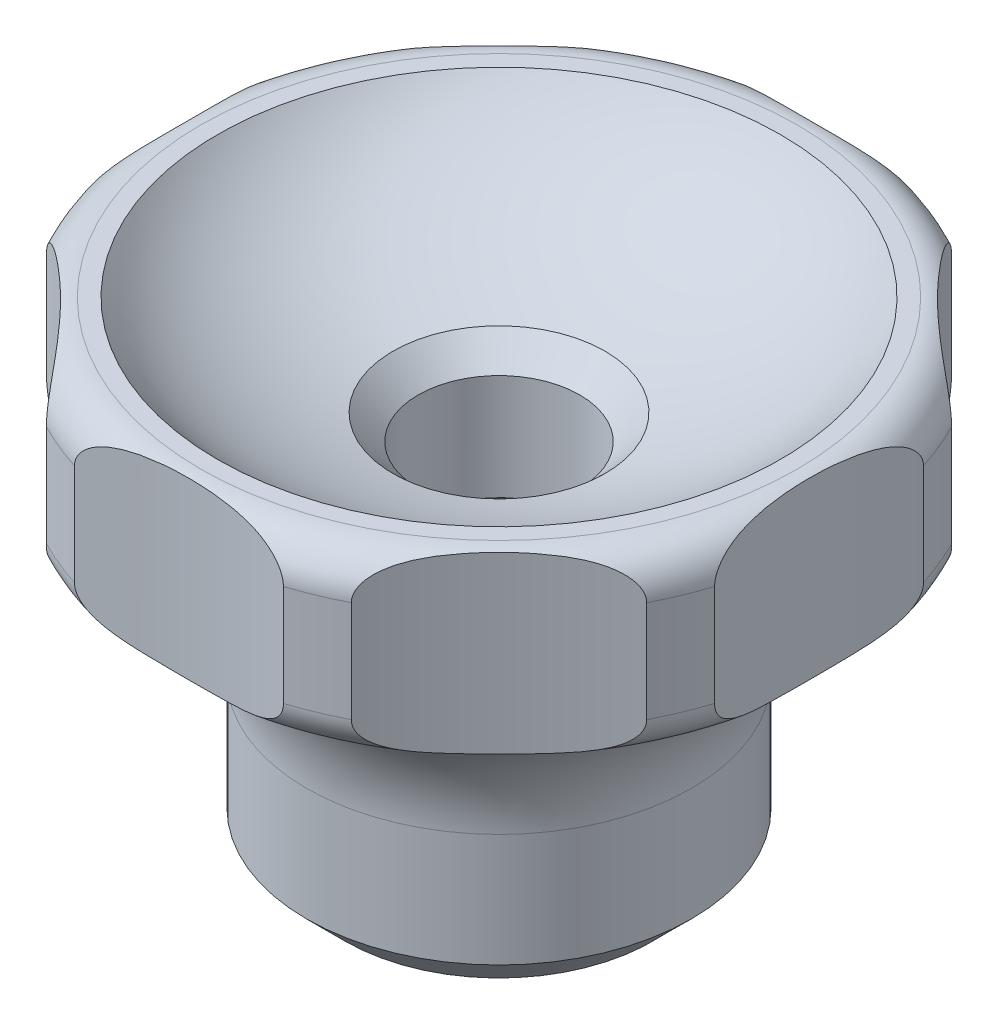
ISO-10303-21;
HEADER;
FILE_DESCRIPTION(('STEP AP214'),'2;1');
FILE_NAME('part.step','',(''),(''),'','','');
FILE_SCHEMA(('AUTOMOTIVE_DESIGN { 1 0 10303 214 1 1 1 1 }'));
ENDSEC;
DATA;
#1=APPLICATION_CONTEXT('core data for automotive mechanical design processes');
#2=APPLICATION_PROTOCOL_DEFINITION('international standard','automotive_design',2000,#1);
#3=PRODUCT_CONTEXT('',#1,'mechanical');
#4=PRODUCT('Part','Part','',(#3));
#5=PRODUCT_RELATED_PRODUCT_CATEGORY('part','',(#4));
#6=PRODUCT_DEFINITION_FORMATION('','',#4);
#7=PRODUCT_DEFINITION_CONTEXT('part definition',#1,'design');
#8=PRODUCT_DEFINITION('design','',#6,#7);
#9=PRODUCT_DEFINITION_SHAPE('','',#8);
#10=(LENGTH_UNIT() NAMED_UNIT(*) SI_UNIT(.MILLI.,.METRE.));
#11=(NAMED_UNIT(*) PLANE_ANGLE_UNIT() SI_UNIT($,.RADIAN.));
#12=(NAMED_UNIT(*) SI_UNIT($,.STERADIAN.) SOLID_ANGLE_UNIT());
#13=UNCERTAINTY_MEASURE_WITH_UNIT(LENGTH_MEASURE(1.E-05),#10,'distance_accuracy_value','');
#14=(GEOMETRIC_REPRESENTATION_CONTEXT(3) GLOBAL_UNCERTAINTY_ASSIGNED_CONTEXT((#13)) GLOBAL_UNIT_ASSIGNED_CONTEXT((#10,
#11,#12)) REPRESENTATION_CONTEXT('',''));
#15=CARTESIAN_POINT('',(0.,0.,0.));
#16=DIRECTION('',(0.,0.,1.));
#17=DIRECTION('',(1.,0.,0.));
#18=AXIS2_PLACEMENT_3D('',#15,#16,#17);
#19=CARTESIAN_POINT('',(0.,0.,0.));
#20=DIRECTION('',(0.,-1.,0.));
#21=DIRECTION('',(0.,0.,-1.));
#22=AXIS2_PLACEMENT_3D('',#19,#20,#21);
#23=CYLINDRICAL_SURFACE('',#22,17.5);
#24=DIRECTION('',(0.,1.,0.));
#25=VECTOR('',#24,1.);
#26=CARTESIAN_POINT('',(7.92405825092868,20.3678966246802,15.6031823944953));
#27=LINE('',#26,#25);
#28=CARTESIAN_POINT('',(7.92405825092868,23.,15.6031823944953));
#29=VERTEX_POINT('',#28);
#30=CARTESIAN_POINT('',(7.92405825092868,17.7357932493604,15.6031823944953));
#31=VERTEX_POINT('',#30);
#32=EDGE_CURVE('E1182',#29,#31,#27,.F.);
#33=ORIENTED_EDGE('',*,*,#32,.F.);
#34=CARTESIAN_POINT('',(0.,23.,0.));
#35=DIRECTION('',(0.,1.,0.));
#36=DIRECTION('',(0.,0.,1.));
#37=AXIS2_PLACEMENT_3D('',#34,#35,#36);
#38=CIRCLE('',#37,17.5);
#39=CARTESIAN_POINT('',(5.42996075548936,23.,16.6362714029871));
#40=VERTEX_POINT('',#39);
#41=EDGE_CURVE('E272',#29,#40,#38,.F.);
#42=ORIENTED_EDGE('',*,*,#41,.T.);
#43=DIRECTION('',(0.,1.,0.));
#44=VECTOR('',#43,1.);
#45=CARTESIAN_POINT('',(5.42996075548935,12.5,16.6362714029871));
#46=LINE('',#45,#44);
#47=CARTESIAN_POINT('',(5.42996075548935,17.7357932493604,16.6362714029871));
#48=VERTEX_POINT('',#47);
#49=EDGE_CURVE('E687',#48,#40,#46,.T.);
#50=ORIENTED_EDGE('',*,*,#49,.F.);
#51=CARTESIAN_POINT('',(0.,17.7357932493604,0.));
#52=DIRECTION('',(0.,1.,0.));
#53=DIRECTION('',(0.,0.,1.));
#54=AXIS2_PLACEMENT_3D('',#51,#52,#53);
#55=CIRCLE('',#54,17.5);
#56=EDGE_CURVE('E279',#48,#31,#55,.T.);
#57=ORIENTED_EDGE('',*,*,#56,.T.);
#58=EDGE_LOOP('',(#33,#42,#50,#57));
#59=FACE_BOUND('',#58,.T.);
#60=ADVANCED_FACE('F43',(#59),#23,.T.);
#61=DIRECTION('',(0.,1.,0.));
#62=VECTOR('',#61,1.);
#63=CARTESIAN_POINT('',(15.6031823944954,20.3678966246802,7.92405825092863));
#64=LINE('',#63,#62);
#65=CARTESIAN_POINT('',(15.6031823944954,17.7357932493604,7.92405825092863));
#66=VERTEX_POINT('',#65);
#67=CARTESIAN_POINT('',(15.6031823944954,23.,7.92405825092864));
#68=VERTEX_POINT('',#67);
#69=EDGE_CURVE('E59',#66,#68,#64,.T.);
#70=ORIENTED_EDGE('',*,*,#69,.F.);
#71=CARTESIAN_POINT('',(16.6362714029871,17.7357932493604,5.4299607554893));
#72=VERTEX_POINT('',#71);
#73=EDGE_CURVE('E283',#66,#72,#55,.T.);
#74=ORIENTED_EDGE('',*,*,#73,.T.);
#75=DIRECTION('',(0.,1.,0.));
#76=VECTOR('',#75,1.);
#77=CARTESIAN_POINT('',(16.6362714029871,12.5,5.4299607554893));
#78=LINE('',#77,#76);
#79=CARTESIAN_POINT('',(16.6362714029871,23.,5.4299607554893));
#80=VERTEX_POINT('',#79);
#81=EDGE_CURVE('E400',#80,#72,#78,.F.);
#82=ORIENTED_EDGE('',*,*,#81,.F.);
#83=EDGE_CURVE('E515',#80,#68,#38,.F.);
#84=ORIENTED_EDGE('',*,*,#83,.T.);
#85=EDGE_LOOP('',(#70,#74,#82,#84));
#86=FACE_BOUND('',#85,.T.);
#87=ADVANCED_FACE('F641',(#86),#23,.T.);
#88=DIRECTION('',(0.,1.,0.));
#89=VECTOR('',#88,1.);
#90=CARTESIAN_POINT('',(-7.92405825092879,20.3678966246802,-15.6031823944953));
#91=LINE('',#90,#89);
#92=CARTESIAN_POINT('',(-7.92405825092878,23.,-15.6031823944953));
#93=VERTEX_POINT('',#92);
#94=CARTESIAN_POINT('',(-7.92405825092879,17.7357932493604,-15.6031823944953));
#95=VERTEX_POINT('',#94);
#96=EDGE_CURVE('E592',#93,#95,#91,.F.);
#97=ORIENTED_EDGE('',*,*,#96,.F.);
#98=CARTESIAN_POINT('',(-5.42996075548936,23.,-16.6362714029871));
#99=VERTEX_POINT('',#98);
#100=EDGE_CURVE('E274',#93,#99,#38,.F.);
#101=ORIENTED_EDGE('',*,*,#100,.T.);
#102=DIRECTION('',(0.,1.,0.));
#103=VECTOR('',#102,1.);
#104=CARTESIAN_POINT('',(-5.42996075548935,12.5,-16.6362714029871));
#105=LINE('',#104,#103);
#106=CARTESIAN_POINT('',(-5.42996075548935,17.7357932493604,-16.6362714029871));
#107=VERTEX_POINT('',#106);
#108=EDGE_CURVE('E610',#107,#99,#105,.T.);
#109=ORIENTED_EDGE('',*,*,#108,.F.);
#110=EDGE_CURVE('E607',#107,#95,#55,.T.);
#111=ORIENTED_EDGE('',*,*,#110,.T.);
#112=EDGE_LOOP('',(#97,#101,#109,#111));
#113=FACE_BOUND('',#112,.T.);
#114=ADVANCED_FACE('F647',(#113),#23,.T.);
#115=DIRECTION('',(0.,1.,0.));
#116=VECTOR('',#115,1.);
#117=CARTESIAN_POINT('',(16.6362714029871,12.5,-5.42996075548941));
#118=LINE('',#117,#116);
#119=CARTESIAN_POINT('',(16.6362714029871,17.7357932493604,-5.42996075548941));
#120=VERTEX_POINT('',#119);
#121=CARTESIAN_POINT('',(16.6362714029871,23.,-5.42996075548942));
#122=VERTEX_POINT('',#121);
#123=EDGE_CURVE('E67',#120,#122,#118,.T.);
#124=ORIENTED_EDGE('',*,*,#123,.F.);
#125=CARTESIAN_POINT('',(15.6031823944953,17.7357932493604,-7.92405825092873));
#126=VERTEX_POINT('',#125);
#127=EDGE_CURVE('E544',#120,#126,#55,.T.);
#128=ORIENTED_EDGE('',*,*,#127,.T.);
#129=DIRECTION('',(0.,1.,0.));
#130=VECTOR('',#129,1.);
#131=CARTESIAN_POINT('',(15.6031823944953,12.5,-7.92405825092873));
#132=LINE('',#131,#130);
#133=CARTESIAN_POINT('',(15.6031823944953,23.,-7.92405825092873));
#134=VERTEX_POINT('',#133);
#135=EDGE_CURVE('E587',#134,#126,#132,.F.);
#136=ORIENTED_EDGE('',*,*,#135,.F.);
#137=EDGE_CURVE('E550',#134,#122,#38,.F.);
#138=ORIENTED_EDGE('',*,*,#137,.T.);
#139=EDGE_LOOP('',(#124,#128,#136,#138));
#140=FACE_BOUND('',#139,.T.);
#141=ADVANCED_FACE('F547',(#140),#23,.T.);
#142=DIRECTION('',(0.,1.,0.));
#143=VECTOR('',#142,1.);
#144=CARTESIAN_POINT('',(7.92405825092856,12.5,-15.6031823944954));
#145=LINE('',#144,#143);
#146=CARTESIAN_POINT('',(7.92405825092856,17.7357932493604,-15.6031823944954));
#147=VERTEX_POINT('',#146);
#148=CARTESIAN_POINT('',(7.92405825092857,23.,-15.6031823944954));
#149=VERTEX_POINT('',#148);
#150=EDGE_CURVE('E585',#147,#149,#145,.T.);
#151=ORIENTED_EDGE('',*,*,#150,.F.);
#152=CARTESIAN_POINT('',(5.42996075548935,17.7357932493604,-16.6362714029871));
#153=VERTEX_POINT('',#152);
#154=EDGE_CURVE('E679',#147,#153,#55,.T.);
#155=ORIENTED_EDGE('',*,*,#154,.T.);
#156=DIRECTION('',(0.,1.,0.));
#157=VECTOR('',#156,1.);
#158=CARTESIAN_POINT('',(5.42996075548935,12.5,-16.6362714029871));
#159=LINE('',#158,#157);
#160=CARTESIAN_POINT('',(5.42996075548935,23.,-16.6362714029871));
#161=VERTEX_POINT('',#160);
#162=EDGE_CURVE('E609',#161,#153,#159,.F.);
#163=ORIENTED_EDGE('',*,*,#162,.F.);
#164=EDGE_CURVE('E1199',#161,#149,#38,.F.);
#165=ORIENTED_EDGE('',*,*,#164,.T.);
#166=EDGE_LOOP('',(#151,#155,#163,#165));
#167=FACE_BOUND('',#166,.T.);
#168=ADVANCED_FACE('F667',(#167),#23,.T.);
#169=DIRECTION('',(0.,1.,0.));
#170=VECTOR('',#169,1.);
#171=CARTESIAN_POINT('',(-15.6031823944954,20.3678966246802,-7.92405825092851));
#172=LINE('',#171,#170);
#173=CARTESIAN_POINT('',(-15.6031823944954,17.7357932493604,-7.92405825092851));
#174=VERTEX_POINT('',#173);
#175=CARTESIAN_POINT('',(-15.6031823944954,23.,-7.92405825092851));
#176=VERTEX_POINT('',#175);
#177=EDGE_CURVE('E591',#174,#176,#172,.T.);
#178=ORIENTED_EDGE('',*,*,#177,.F.);
#179=CARTESIAN_POINT('',(-16.6362714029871,17.7357932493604,-5.42996075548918));
#180=VERTEX_POINT('',#179);
#181=EDGE_CURVE('E675',#174,#180,#55,.T.);
#182=ORIENTED_EDGE('',*,*,#181,.T.);
#183=DIRECTION('',(0.,1.,0.));
#184=VECTOR('',#183,1.);
#185=CARTESIAN_POINT('',(-16.6362714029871,12.5,-5.42996075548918));
#186=LINE('',#185,#184);
#187=CARTESIAN_POINT('',(-16.6362714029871,23.,-5.42996075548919));
#188=VERTEX_POINT('',#187);
#189=EDGE_CURVE('E623',#188,#180,#186,.F.);
#190=ORIENTED_EDGE('',*,*,#189,.F.);
#191=EDGE_CURVE('E269',#188,#176,#38,.F.);
#192=ORIENTED_EDGE('',*,*,#191,.T.);
#193=EDGE_LOOP('',(#178,#182,#190,#192));
#194=FACE_BOUND('',#193,.T.);
#195=ADVANCED_FACE('F660',(#194),#23,.T.);
#196=DIRECTION('',(0.,1.,0.));
#197=VECTOR('',#196,1.);
#198=CARTESIAN_POINT('',(-16.636271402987,12.5,5.42996075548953));
#199=LINE('',#198,#197);
#200=CARTESIAN_POINT('',(-16.636271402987,17.7357932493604,5.42996075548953));
#201=VERTEX_POINT('',#200);
#202=CARTESIAN_POINT('',(-16.636271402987,23.,5.42996075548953));
#203=VERTEX_POINT('',#202);
#204=EDGE_CURVE('E624',#201,#203,#199,.T.);
#205=ORIENTED_EDGE('',*,*,#204,.F.);
#206=CARTESIAN_POINT('',(-15.6031823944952,17.7357932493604,7.92405825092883));
#207=VERTEX_POINT('',#206);
#208=EDGE_CURVE('E261',#201,#207,#55,.T.);
#209=ORIENTED_EDGE('',*,*,#208,.T.);
#210=DIRECTION('',(0.,1.,0.));
#211=VECTOR('',#210,1.);
#212=CARTESIAN_POINT('',(-15.6031823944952,12.5,7.92405825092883));
#213=LINE('',#212,#211);
#214=CARTESIAN_POINT('',(-15.6031823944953,23.,7.92405825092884));
#215=VERTEX_POINT('',#214);
#216=EDGE_CURVE('E243',#215,#207,#213,.F.);
#217=ORIENTED_EDGE('',*,*,#216,.F.);
#218=EDGE_CURVE('E259',#215,#203,#38,.F.);
#219=ORIENTED_EDGE('',*,*,#218,.T.);
#220=EDGE_LOOP('',(#205,#209,#217,#219));
#221=FACE_BOUND('',#220,.T.);
#222=ADVANCED_FACE('F258',(#221),#23,.T.);
#223=CARTESIAN_POINT('',(0.,17.7357932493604,0.));
#224=DIRECTION('',(0.,1.,0.));
#225=DIRECTION('',(0.,0.,1.));
#226=AXIS2_PLACEMENT_3D('',#223,#224,#225);
#227=TOROIDAL_SURFACE('',#226,15.5,2.);
#228=CARTESIAN_POINT('',(7.93480845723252,17.9281200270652,15.5873182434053));
#229=CARTESIAN_POINT('',(7.9312555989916,17.8965194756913,15.5925582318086));
#230=CARTESIAN_POINT('',(7.9285696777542,17.8646206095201,15.5965219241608));
#231=CARTESIAN_POINT('',(7.92497137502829,17.8004847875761,15.6018335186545));
#232=CARTESIAN_POINT('',(7.92406024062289,17.7682476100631,15.6031795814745));
#233=CARTESIAN_POINT('',(7.92405473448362,17.6784668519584,15.6031873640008));
#234=CARTESIAN_POINT('',(7.92694319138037,17.6208857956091,15.5989194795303));
#235=CARTESIAN_POINT('',(7.93827504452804,17.5074933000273,15.5822044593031));
#236=CARTESIAN_POINT('',(7.94672359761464,17.4516835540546,15.5697497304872));
#237=CARTESIAN_POINT('',(7.96846928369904,17.3435679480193,15.5377803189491));
#238=CARTESIAN_POINT('',(7.98173476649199,17.2912417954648,15.5183117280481));
#239=CARTESIAN_POINT('',(8.01234021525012,17.1904516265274,15.4735512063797));
#240=CARTESIAN_POINT('',(8.02968217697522,17.1419895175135,15.4482564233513));
#241=CARTESIAN_POINT('',(8.07964486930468,17.0199957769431,15.3756837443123));
#242=CARTESIAN_POINT('',(8.11501511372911,16.9498670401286,15.3245855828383));
#243=CARTESIAN_POINT('',(8.19193421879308,16.8200760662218,15.2143714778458));
#244=CARTESIAN_POINT('',(8.23350010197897,16.7604436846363,15.1552334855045));
#245=CARTESIAN_POINT('',(8.314643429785,16.6584380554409,15.0408025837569));
#246=CARTESIAN_POINT('',(8.3536400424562,16.6148160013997,14.9861892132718));
#247=CARTESIAN_POINT('',(8.43409796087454,16.533489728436,14.8743889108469));
#248=CARTESIAN_POINT('',(8.47556114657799,16.4957901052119,14.8172000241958));
#249=CARTESIAN_POINT('',(8.56047364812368,16.4254910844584,14.701022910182));
#250=CARTESIAN_POINT('',(8.60392641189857,16.3929010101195,14.6420316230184));
#251=CARTESIAN_POINT('',(8.69239379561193,16.3322000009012,14.5229112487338));
#252=CARTESIAN_POINT('',(8.73740901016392,16.304090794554,14.4627817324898));
#253=CARTESIAN_POINT('',(8.87296408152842,16.22638303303,14.2832184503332));
#254=CARTESIAN_POINT('',(8.96535514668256,16.1823505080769,14.1627707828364));
#255=CARTESIAN_POINT('',(9.15383772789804,16.1056342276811,13.9211312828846));
#256=CARTESIAN_POINT('',(9.24993267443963,16.0729612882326,13.7999388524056));
#257=CARTESIAN_POINT('',(9.44507817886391,16.0163166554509,13.5579149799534));
#258=CARTESIAN_POINT('',(9.5441291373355,15.99234614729,13.4370835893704));
#259=CARTESIAN_POINT('',(9.74470951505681,15.9510910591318,13.1964552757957));
#260=CARTESIAN_POINT('',(9.84623800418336,15.9338040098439,13.0766579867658));
#261=CARTESIAN_POINT('',(10.0559258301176,15.9037396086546,12.833327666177));
#262=CARTESIAN_POINT('',(10.1641835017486,15.8911854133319,12.7098525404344));
#263=CARTESIAN_POINT('',(10.3829939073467,15.8703633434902,12.4645681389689));
#264=CARTESIAN_POINT('',(10.493546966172,15.8620960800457,12.3427591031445));
#265=CARTESIAN_POINT('',(10.7171392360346,15.8489201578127,12.1006180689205));
#266=CARTESIAN_POINT('',(10.8301846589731,15.8440211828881,11.9802912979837));
#267=CARTESIAN_POINT('',(11.0583434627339,15.8370442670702,11.7415957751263));
#268=CARTESIAN_POINT('',(11.1734562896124,15.8349655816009,11.6232265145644));
#269=CARTESIAN_POINT('',(11.4087325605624,15.8333511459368,11.3854317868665));
#270=CARTESIAN_POINT('',(11.5289495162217,15.8338828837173,11.2660588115));
#271=CARTESIAN_POINT('',(11.7714624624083,15.8377133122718,11.0294716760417));
#272=CARTESIAN_POINT('',(11.8937585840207,15.8410121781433,10.912257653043));
#273=CARTESIAN_POINT('',(12.1405821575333,15.8508063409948,10.6798430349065));
#274=CARTESIAN_POINT('',(12.2651135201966,15.8573079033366,10.5646468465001));
#275=CARTESIAN_POINT('',(12.5160418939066,15.8742987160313,10.3366164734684));
#276=CARTESIAN_POINT('',(12.6424387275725,15.8847875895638,10.223782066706));
#277=CARTESIAN_POINT('',(12.8957507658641,15.9108244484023,10.0016388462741));
#278=CARTESIAN_POINT('',(13.0226506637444,15.9263252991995,9.89230722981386));
#279=CARTESIAN_POINT('',(13.277834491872,15.9640296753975,9.67629852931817));
#280=CARTESIAN_POINT('',(13.4061189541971,15.9862358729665,9.56962252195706));
#281=CARTESIAN_POINT('',(13.6629549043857,16.0394227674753,9.35978021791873));
#282=CARTESIAN_POINT('',(13.7915036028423,16.0703703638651,9.25660229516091));
#283=CARTESIAN_POINT('',(14.0482412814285,16.1439361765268,9.05410350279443));
#284=CARTESIAN_POINT('',(14.1764305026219,16.186541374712,8.95477847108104));
#285=CARTESIAN_POINT('',(14.3464157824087,16.2540034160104,8.82529785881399));
#286=CARTESIAN_POINT('',(14.3892456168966,16.2719473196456,8.79286599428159));
#287=CARTESIAN_POINT('',(14.4745316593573,16.3098301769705,8.7286558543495));
#288=CARTESIAN_POINT('',(14.5169877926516,16.3297695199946,8.69687770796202));
#289=CARTESIAN_POINT('',(14.6014242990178,16.3718749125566,8.6340362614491));
#290=CARTESIAN_POINT('',(14.6434040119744,16.3940437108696,8.60297390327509));
#291=CARTESIAN_POINT('',(14.7266327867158,16.4408228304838,8.54173303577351));
#292=CARTESIAN_POINT('',(14.7678818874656,16.4654330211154,8.51155447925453));
#293=CARTESIAN_POINT('',(14.8908193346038,16.5437064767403,8.42210369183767));
#294=CARTESIAN_POINT('',(14.9710768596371,16.6015138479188,8.36437781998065));
#295=CARTESIAN_POINT('',(15.1247688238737,16.7304888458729,8.25494535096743));
#296=CARTESIAN_POINT('',(15.1982159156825,16.8016309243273,8.20322754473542));
#297=CARTESIAN_POINT('',(15.3078238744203,16.9297936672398,8.12670261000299));
#298=CARTESIAN_POINT('',(15.3476004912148,16.9820219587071,8.09910222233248));
#299=CARTESIAN_POINT('',(15.4207750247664,17.0928813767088,8.0485601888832));
#300=CARTESIAN_POINT('',(15.4541770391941,17.1515083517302,8.02561554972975));
#301=CARTESIAN_POINT('',(15.5127643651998,17.27573298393,7.98550942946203));
#302=CARTESIAN_POINT('',(15.5378345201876,17.3414129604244,7.96842889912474));
#303=CARTESIAN_POINT('',(15.5765649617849,17.4775134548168,7.94209218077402));
#304=CARTESIAN_POINT('',(15.5902496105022,17.5479235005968,7.93281928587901));
#305=CARTESIAN_POINT('',(15.6034171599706,17.6798196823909,7.92389818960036));
#306=CARTESIAN_POINT('',(15.6047441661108,17.7410334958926,7.92300018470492));
#307=CARTESIAN_POINT('',(15.5995932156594,17.8324354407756,7.92648909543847));
#308=CARTESIAN_POINT('',(15.5966567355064,17.8629679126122,7.92847786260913));
#309=CARTESIAN_POINT('',(15.5884607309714,17.9235776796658,7.93403328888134));
#310=CARTESIAN_POINT('',(15.5832010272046,17.9536549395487,7.93760006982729));
#311=CARTESIAN_POINT('',(15.5768276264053,17.9833921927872,7.94192582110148));
#312=B_SPLINE_CURVE_WITH_KNOTS('',3,(#228,#229,#230,#231,#232,#233,#234,#235,#236,#237,#238,
#239,#240,#241,#242,#243,#244,#245,#246,#247,#248,#249,#250,#251,#252,#253,#254,#255,#256,#257,
#258,#259,#260,#261,#262,#263,#264,#265,#266,#267,#268,#269,#270,#271,#272,#273,#274,#275,#276,
#277,#278,#279,#280,#281,#282,#283,#284,#285,#286,#287,#288,#289,#290,#291,#292,#293,#294,#295,
#296,#297,#298,#299,#300,#301,#302,#303,#304,#305,#306,#307,#308,#309,#310,#311),.UNSPECIFIED.,
.F.,.F.,(4,2,2,2,2,2,2,2,2,2,2,2,2,2,2,2,2,2,2,2,2,2,2,2,2,2,2,2,2,2,2,2,2,2,2,2,2,2,2,2,2,4),
(0.,0.0966239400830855,0.193315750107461,0.365767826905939,0.538380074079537,0.709878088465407,
0.881460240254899,1.16095813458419,1.44123861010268,1.6810114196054,1.92096937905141,
2.16136020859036,2.40184354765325,2.87532433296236,3.34925471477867,3.82324961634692,
4.29706922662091,4.7910475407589,5.28509624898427,5.78055947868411,6.27589187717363,
6.7840966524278,7.29233358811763,7.80156874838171,8.31075579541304,8.81528712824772,
9.32001978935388,9.82286625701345,10.3251534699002,10.495045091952,10.6649699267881,
10.8351068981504,11.005234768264,11.3479669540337,11.6900490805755,11.9031247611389,
12.1160630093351,12.3318325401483,12.5471391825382,12.7296846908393,12.8217810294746,
12.9138844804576),.UNSPECIFIED.);
#313=CARTESIAN_POINT('',(9.94750433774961,15.9192849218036,12.9591445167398));
#314=VERTEX_POINT('',#313);
#315=EDGE_CURVE('E1189',#31,#314,#312,.T.);
#316=ORIENTED_EDGE('',*,*,#315,.F.);
#317=ORIENTED_EDGE('',*,*,#56,.F.);
#318=CARTESIAN_POINT('',(-5.41061374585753,17.9307879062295,16.6325540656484));
#319=CARTESIAN_POINT('',(-5.41700467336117,17.8987599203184,16.6337802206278));
#320=CARTESIAN_POINT('',(-5.42183858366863,17.8664204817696,16.6347090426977));
#321=CARTESIAN_POINT('',(-5.42831593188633,17.8013910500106,16.6359545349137));
#322=CARTESIAN_POINT('',(-5.42995724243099,17.76870083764,16.6362707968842));
#323=CARTESIAN_POINT('',(-5.42996687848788,17.6784656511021,16.6362724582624));
#324=CARTESIAN_POINT('',(-5.42490637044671,17.6208842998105,16.6352970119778));
#325=CARTESIAN_POINT('',(-5.40507394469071,17.5074921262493,16.6314904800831));
#326=CARTESIAN_POINT('',(-5.39029323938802,17.4516829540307,16.6286577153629));
#327=CARTESIAN_POINT('',(-5.35231125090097,17.3435681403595,16.6214285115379));
#328=CARTESIAN_POINT('',(-5.32916487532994,17.2912422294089,16.6170422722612));
#329=CARTESIAN_POINT('',(-5.27587314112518,17.190452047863,16.6070331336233));
#330=CARTESIAN_POINT('',(-5.24572429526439,17.1419897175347,16.601409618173));
#331=CARTESIAN_POINT('',(-5.15907858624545,17.0199958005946,16.585421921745));
#332=CARTESIAN_POINT('',(-5.09793621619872,16.9498670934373,16.5743006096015));
#333=CARTESIAN_POINT('',(-4.96561306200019,16.8200761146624,16.5507574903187));
#334=CARTESIAN_POINT('',(-4.89440464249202,16.7604437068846,16.5383321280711));
#335=CARTESIAN_POINT('',(-4.75611168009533,16.6584372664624,16.5147940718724));
#336=CARTESIAN_POINT('',(-4.68991827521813,16.6148145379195,16.5037511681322));
#337=CARTESIAN_POINT('',(-4.55396876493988,16.5334870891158,16.4815883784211));
#338=CARTESIAN_POINT('',(-4.4842099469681,16.4957869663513,16.4704684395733));
#339=CARTESIAN_POINT('',(-4.34201792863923,16.4254882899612,16.4483610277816));
#340=CARTESIAN_POINT('',(-4.26958021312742,16.3928988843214,16.4373738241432));
#341=CARTESIAN_POINT('',(-4.12279591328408,16.3321990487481,16.4156992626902));
#342=CARTESIAN_POINT('',(-4.04844860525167,16.3040903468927,16.4050120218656));
#343=CARTESIAN_POINT('',(-3.82564618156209,16.226389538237,16.3738962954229));
#344=CARTESIAN_POINT('',(-3.67516580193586,16.1823616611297,16.3540596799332));
#345=CARTESIAN_POINT('',(-3.37106246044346,16.1056520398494,16.3164762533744));
#346=CARTESIAN_POINT('',(-3.21743664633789,16.0729811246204,16.2987314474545));
#347=CARTESIAN_POINT('',(-2.90831219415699,16.0163323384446,16.2655822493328));
#348=CARTESIAN_POINT('',(-2.75281285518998,15.992357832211,16.2501787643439));
#349=CARTESIAN_POINT('',(-2.44079163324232,15.9510948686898,16.2218564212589));
#350=CARTESIAN_POINT('',(-2.28427015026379,15.9338039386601,16.2089366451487));
#351=CARTESIAN_POINT('',(-2.00374966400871,15.9074792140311,16.1881041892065));
#352=CARTESIAN_POINT('',(-1.87987425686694,15.8974724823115,16.1797104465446));
#353=CARTESIAN_POINT('',(-1.63183907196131,15.8800800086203,16.1645211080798));
#354=CARTESIAN_POINT('',(-1.50767928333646,15.8726943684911,16.1577255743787));
#355=CARTESIAN_POINT('',(-1.25909445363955,15.8600863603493,16.1457399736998));
#356=CARTESIAN_POINT('',(-1.13466929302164,15.8548653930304,16.1405509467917));
#357=CARTESIAN_POINT('',(-0.885711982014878,15.8462594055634,16.1317906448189));
#358=CARTESIAN_POINT('',(-0.761179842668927,15.8428742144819,16.1282192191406));
#359=CARTESIAN_POINT('',(-0.468243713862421,15.836797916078,16.1217257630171));
#360=CARTESIAN_POINT('',(-0.299810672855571,15.8347694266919,16.1194736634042));
#361=CARTESIAN_POINT('',(0.0370888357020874,15.8333746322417,16.1179329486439));
#362=CARTESIAN_POINT('',(0.20555530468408,15.8340084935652,16.1186445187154));
#363=CARTESIAN_POINT('',(0.542614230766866,15.8380244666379,16.1230331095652));
#364=CARTESIAN_POINT('',(0.711206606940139,15.8414097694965,16.126713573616));
#365=CARTESIAN_POINT('',(1.04820090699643,15.8513577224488,16.1370385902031));
#366=CARTESIAN_POINT('',(1.21660284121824,15.8579201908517,16.1436829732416));
#367=CARTESIAN_POINT('',(1.55246736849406,15.8749770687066,16.1598933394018));
#368=CARTESIAN_POINT('',(1.71993116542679,15.8854573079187,16.1694487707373));
#369=CARTESIAN_POINT('',(2.05432150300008,15.9115184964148,16.1914637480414));
#370=CARTESIAN_POINT('',(2.22124792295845,15.9271005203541,16.2039239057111));
#371=CARTESIAN_POINT('',(2.55376420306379,15.9649401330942,16.2316582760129));
#372=CARTESIAN_POINT('',(2.7193561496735,15.987183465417,16.246926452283));
#373=CARTESIAN_POINT('',(3.04880843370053,16.0405016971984,16.2801730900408));
#374=CARTESIAN_POINT('',(3.21266973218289,16.0715713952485,16.2981499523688));
#375=CARTESIAN_POINT('',(3.45872181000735,16.1275610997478,16.3272595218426));
#376=CARTESIAN_POINT('',(3.54200416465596,16.1481633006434,16.3374865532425));
#377=CARTESIAN_POINT('',(3.70753406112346,16.1930152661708,16.3585422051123));
#378=CARTESIAN_POINT('',(3.78978137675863,16.217265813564,16.3693709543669));
#379=CARTESIAN_POINT('',(3.95282810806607,16.2699943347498,16.3915466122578));
#380=CARTESIAN_POINT('',(4.0336279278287,16.2984711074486,16.4028933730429));
#381=CARTESIAN_POINT('',(4.19324069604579,16.3603536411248,16.4259870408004));
#382=CARTESIAN_POINT('',(4.27205423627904,16.3937579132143,16.4377338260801));
#383=CARTESIAN_POINT('',(4.46188817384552,16.4826597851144,16.4668137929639));
#384=CARTESIAN_POINT('',(4.57143933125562,16.5413344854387,16.4842817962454));
#385=CARTESIAN_POINT('',(4.781182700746,16.6737897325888,16.5188909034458));
#386=CARTESIAN_POINT('',(4.88139304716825,16.7475400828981,16.5360325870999));
#387=CARTESIAN_POINT('',(5.03008426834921,16.881149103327,16.5621693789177));
#388=CARTESIAN_POINT('',(5.08355460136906,16.935302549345,16.5717456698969));
#389=CARTESIAN_POINT('',(5.1821320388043,17.0509755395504,16.5896484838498));
#390=CARTESIAN_POINT('',(5.22725112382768,17.1124843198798,16.597976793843));
#391=CARTESIAN_POINT('',(5.29849743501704,17.2301773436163,16.6112638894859));
#392=CARTESIAN_POINT('',(5.32660840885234,17.2851099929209,16.6165626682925));
#393=CARTESIAN_POINT('',(5.37353016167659,17.3988844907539,16.6254571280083));
#394=CARTESIAN_POINT('',(5.39235938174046,17.4577183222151,16.629056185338));
#395=CARTESIAN_POINT('',(5.41921812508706,17.578168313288,16.6342020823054));
#396=CARTESIAN_POINT('',(5.42721466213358,17.6397923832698,16.6357426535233));
#397=CARTESIAN_POINT('',(5.43045376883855,17.7327591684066,16.636366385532));
#398=CARTESIAN_POINT('',(5.43004932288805,17.7639972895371,16.6362883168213));
#399=CARTESIAN_POINT('',(5.42629960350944,17.8263035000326,16.6355668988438));
#400=CARTESIAN_POINT('',(5.42295310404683,17.8573715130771,16.634923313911));
#401=CARTESIAN_POINT('',(5.41815694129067,17.8882204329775,16.6340017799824));
#402=B_SPLINE_CURVE_WITH_KNOTS('',3,(#318,#319,#320,#321,#322,#323,#324,#325,#326,#327,#328,
#329,#330,#331,#332,#333,#334,#335,#336,#337,#338,#339,#340,#341,#342,#343,#344,#345,#346,#347,
#348,#349,#350,#351,#352,#353,#354,#355,#356,#357,#358,#359,#360,#361,#362,#363,#364,#365,#366,
#367,#368,#369,#370,#371,#372,#373,#374,#375,#376,#377,#378,#379,#380,#381,#382,#383,#384,#385,
#386,#387,#388,#389,#390,#391,#392,#393,#394,#395,#396,#397,#398,#399,#400,#401),.UNSPECIFIED.,
.F.,.F.,(4,2,2,2,2,2,2,2,2,2,2,2,2,2,2,2,2,2,2,2,2,2,2,2,2,2,2,2,2,2,2,2,2,2,2,2,2,2,2,2,2,4),
(0.,0.0979843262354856,0.196033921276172,0.368488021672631,0.541098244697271,0.712595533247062,
0.88417841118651,1.16367619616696,1.44395678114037,1.68373360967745,1.92369565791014,
2.16408244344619,2.40456171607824,2.87798282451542,3.35185411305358,3.82590855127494,
4.29978743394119,4.67343330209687,5.04709368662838,5.42099547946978,5.79486245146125,
6.30019224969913,6.80555362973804,7.31150196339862,7.81742136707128,8.32152833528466,
8.82574155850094,9.32888328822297,9.83172912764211,10.0908617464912,10.3500500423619,
10.6091648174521,10.8682014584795,11.2438218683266,11.6186971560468,11.8481855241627,
12.0773420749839,12.2624199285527,12.4471285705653,12.6323984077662,12.72599329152,
12.8196271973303),.UNSPECIFIED.);
#403=CARTESIAN_POINT('',(2.12955119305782,15.9192849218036,16.1974467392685));
#404=VERTEX_POINT('',#403);
#405=EDGE_CURVE('E316',#404,#48,#402,.T.);
#406=ORIENTED_EDGE('',*,*,#405,.F.);
#407=CARTESIAN_POINT('',(0.,15.9192849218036,0.));
#408=DIRECTION('',(0.,-1.,0.));
#409=DIRECTION('',(0.,0.,-1.));
#410=AXIS2_PLACEMENT_3D('',#407,#408,#409);
#411=CIRCLE('',#410,16.3368377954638);
#412=EDGE_CURVE('E500',#314,#404,#411,.T.);
#413=ORIENTED_EDGE('',*,*,#412,.F.);
#414=EDGE_LOOP('',(#316,#317,#406,#413));
#415=FACE_BOUND('',#414,.T.);
#416=ADVANCED_FACE('F338',(#415),#227,.T.);
#417=CARTESIAN_POINT('',(12.9591445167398,15.9192849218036,9.94750433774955));
#418=VERTEX_POINT('',#417);
#419=EDGE_CURVE('E1181',#418,#66,#312,.T.);
#420=ORIENTED_EDGE('',*,*,#419,.F.);
#421=CARTESIAN_POINT('',(16.1974467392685,15.9192849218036,2.12955119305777));
#422=VERTEX_POINT('',#421);
#423=EDGE_CURVE('E503',#422,#418,#411,.T.);
#424=ORIENTED_EDGE('',*,*,#423,.F.);
#425=CARTESIAN_POINT('',(16.6351750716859,17.8417677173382,5.42426230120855));
#426=CARTESIAN_POINT('',(16.6355382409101,17.8242142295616,5.42615101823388));
#427=CARTESIAN_POINT('',(16.6358120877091,17.8066161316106,5.42757426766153));
#428=CARTESIAN_POINT('',(16.6361786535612,17.7713458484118,5.42947891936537));
#429=CARTESIAN_POINT('',(16.6362711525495,17.7536735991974,5.42995917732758));
#430=CARTESIAN_POINT('',(16.636272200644,17.678509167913,5.42996580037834));
#431=CARTESIAN_POINT('',(16.6352978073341,17.620939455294,5.42491055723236));
#432=CARTESIAN_POINT('',(16.6314930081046,17.5075358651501,5.4050870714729));
#433=CARTESIAN_POINT('',(16.628659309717,17.4517052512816,5.39030159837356));
#434=CARTESIAN_POINT('',(16.6214278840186,17.343560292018,5.35230797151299));
#435=CARTESIAN_POINT('',(16.6170407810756,17.2912248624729,5.32915701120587));
#436=CARTESIAN_POINT('',(16.6070312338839,17.1904352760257,5.27586295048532));
#437=CARTESIAN_POINT('',(16.6014085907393,17.1419817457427,5.24571872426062));
#438=CARTESIAN_POINT('',(16.585422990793,17.0200041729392,5.15908438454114));
#439=CARTESIAN_POINT('',(16.574303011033,16.9498823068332,5.09794942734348));
#440=CARTESIAN_POINT('',(16.5507601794,16.8200889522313,4.96562846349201));
#441=CARTESIAN_POINT('',(16.5383334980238,16.7604496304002,4.89441268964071));
#442=CARTESIAN_POINT('',(16.5147917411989,16.6584271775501,4.7560979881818));
#443=CARTESIAN_POINT('',(16.5037464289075,16.6147958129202,4.68988986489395));
#444=CARTESIAN_POINT('',(16.481578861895,16.5334535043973,4.55390972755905));
#445=CARTESIAN_POINT('',(16.4704565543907,16.4957471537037,4.48413500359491));
#446=CARTESIAN_POINT('',(16.4483492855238,16.4254529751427,4.34194089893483));
#447=CARTESIAN_POINT('',(16.4373645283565,16.392872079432,4.26951809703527));
#448=CARTESIAN_POINT('',(16.4156947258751,16.3321871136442,4.12276434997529));
#449=CARTESIAN_POINT('',(16.4050097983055,16.3040847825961,4.04843267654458));
#450=CARTESIAN_POINT('',(16.3739108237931,16.2264258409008,3.8257502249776));
#451=CARTESIAN_POINT('',(16.3540876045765,16.1824237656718,3.67537771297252));
#452=CARTESIAN_POINT('',(16.3165279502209,16.1057524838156,3.37149482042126));
#453=CARTESIAN_POINT('',(16.2987934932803,16.0730939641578,3.21798162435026));
#454=CARTESIAN_POINT('',(16.2656428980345,16.0164292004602,2.90891127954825));
#455=CARTESIAN_POINT('',(16.2502302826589,15.9924360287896,2.75335140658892));
#456=CARTESIAN_POINT('',(16.2218827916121,15.9511301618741,2.44111109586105));
#457=CARTESIAN_POINT('',(16.2089485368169,15.933819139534,2.2844303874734));
#458=CARTESIAN_POINT('',(16.1876913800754,15.9069574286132,1.99819087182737));
#459=CARTESIAN_POINT('',(16.1789574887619,15.8965756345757,1.86873776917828));
#460=CARTESIAN_POINT('',(16.1632353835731,15.8786473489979,1.6095248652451));
#461=CARTESIAN_POINT('',(16.156247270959,15.8711010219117,1.47976504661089));
#462=CARTESIAN_POINT('',(16.1440272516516,15.8583344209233,1.22001078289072));
#463=CARTESIAN_POINT('',(16.1387958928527,15.8531148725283,1.09001627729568));
#464=CARTESIAN_POINT('',(16.130098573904,15.8446363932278,0.829901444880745));
#465=CARTESIAN_POINT('',(16.1266326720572,15.841377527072,0.699781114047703));
#466=CARTESIAN_POINT('',(16.12147204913,15.8365823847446,0.439584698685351));
#467=CARTESIAN_POINT('',(16.119775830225,15.8350446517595,0.309508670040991));
#468=CARTESIAN_POINT('',(16.118150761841,15.8335707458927,0.0493364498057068));
#469=CARTESIAN_POINT('',(16.1182219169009,15.8336345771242,-0.0807597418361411));
#470=CARTESIAN_POINT('',(16.1201313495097,15.8353680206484,-0.340898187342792));
#471=CARTESIAN_POINT('',(16.121969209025,15.837037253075,-0.470940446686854));
#472=CARTESIAN_POINT('',(16.1274098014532,15.8421084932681,-0.730951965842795));
#473=CARTESIAN_POINT('',(16.1310125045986,15.8455104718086,-0.860921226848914));
#474=CARTESIAN_POINT('',(16.1415024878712,15.8557816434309,-1.16486268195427));
#475=CARTESIAN_POINT('',(16.149089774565,15.8634360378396,-1.33878612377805));
#476=CARTESIAN_POINT('',(16.1674078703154,15.8832454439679,-1.68620542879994));
#477=CARTESIAN_POINT('',(16.1781384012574,15.8954000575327,-1.85970132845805));
#478=CARTESIAN_POINT('',(16.2027048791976,15.9256389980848,-2.20598060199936));
#479=CARTESIAN_POINT('',(16.2165410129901,15.9437236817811,-2.37876393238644));
#480=CARTESIAN_POINT('',(16.2472359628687,15.9877850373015,-2.72304364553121));
#481=CARTESIAN_POINT('',(16.2640937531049,16.0137590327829,-2.89454044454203));
#482=CARTESIAN_POINT('',(16.2935219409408,16.0640968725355,-3.16878927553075));
#483=CARTESIAN_POINT('',(16.3051975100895,16.0851320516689,-3.27224624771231));
#484=CARTESIAN_POINT('',(16.3295360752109,16.1319345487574,-3.47795844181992));
#485=CARTESIAN_POINT('',(16.3421988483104,16.1577008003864,-3.58021392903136));
#486=CARTESIAN_POINT('',(16.368392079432,16.2148813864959,-3.7829018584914));
#487=CARTESIAN_POINT('',(16.3819214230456,16.2462885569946,-3.8833364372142));
#488=CARTESIAN_POINT('',(16.4096884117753,16.3159217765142,-4.08168469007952));
#489=CARTESIAN_POINT('',(16.4239256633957,16.3541440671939,-4.17959971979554));
#490=CARTESIAN_POINT('',(16.4545095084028,16.4436872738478,-4.38278357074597));
#491=CARTESIAN_POINT('',(16.4709111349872,16.496006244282,-4.48761290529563));
#492=CARTESIAN_POINT('',(16.5036783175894,16.6133297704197,-4.69008797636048));
#493=CARTESIAN_POINT('',(16.5200438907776,16.6783254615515,-4.78773866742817));
#494=CARTESIAN_POINT('',(16.5474229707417,16.804222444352,-4.94658896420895));
#495=CARTESIAN_POINT('',(16.5586954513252,16.8615533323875,-5.01054408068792));
#496=CARTESIAN_POINT('',(16.5799637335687,16.9854190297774,-5.12915513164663));
#497=CARTESIAN_POINT('',(16.5899617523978,17.0519374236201,-5.18382727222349));
#498=CARTESIAN_POINT('',(16.6053545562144,17.1751877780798,-5.26693373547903));
#499=CARTESIAN_POINT('',(16.6112645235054,17.2297517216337,-5.29847144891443));
#500=CARTESIAN_POINT('',(16.6214452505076,17.3433163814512,-5.35243621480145));
#501=CARTESIAN_POINT('',(16.6257202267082,17.4023052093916,-5.37488671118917));
#502=CARTESIAN_POINT('',(16.6306058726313,17.4932384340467,-5.40045242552));
#503=CARTESIAN_POINT('',(16.631981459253,17.5240377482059,-5.4076303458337));
#504=CARTESIAN_POINT('',(16.6341804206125,17.5861982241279,-5.4190901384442));
#505=CARTESIAN_POINT('',(16.6350038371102,17.6175593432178,-5.42337222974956));
#506=CARTESIAN_POINT('',(16.6360761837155,17.6808936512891,-5.42894747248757));
#507=CARTESIAN_POINT('',(16.6363188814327,17.7128697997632,-5.4302081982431));
#508=CARTESIAN_POINT('',(16.636207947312,17.7768150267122,-5.42963031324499));
#509=CARTESIAN_POINT('',(16.635853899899,17.8087840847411,-5.42778954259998));
#510=CARTESIAN_POINT('',(16.6351994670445,17.8405827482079,-5.42438916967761));
#511=B_SPLINE_CURVE_WITH_KNOTS('',3,(#425,#426,#427,#428,#429,#430,#431,#432,#433,#434,#435,
#436,#437,#438,#439,#440,#441,#442,#443,#444,#445,#446,#447,#448,#449,#450,#451,#452,#453,#454,
#455,#456,#457,#458,#459,#460,#461,#462,#463,#464,#465,#466,#467,#468,#469,#470,#471,#472,#473,
#474,#475,#476,#477,#478,#479,#480,#481,#482,#483,#484,#485,#486,#487,#488,#489,#490,#491,#492,
#493,#494,#495,#496,#497,#498,#499,#500,#501,#502,#503,#504,#505,#506,#507,#508,#509,#510),
.UNSPECIFIED.,.F.,.F.,(4,2,2,2,2,2,2,2,2,2,2,2,2,2,2,2,2,2,2,2,2,2,2,2,2,2,2,2,2,2,2,2,2,2,2,2,
2,2,2,2,2,2,4),(0.,0.0529543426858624,0.105972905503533,0.278352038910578,0.451037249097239,
0.622563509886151,0.794117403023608,1.07358503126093,1.35389580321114,1.59372405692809,
1.83373732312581,2.07407246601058,2.31450070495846,2.78758844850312,3.26112069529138,
3.73536434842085,4.20972665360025,4.60016649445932,4.99062897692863,5.38121312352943,
5.77181016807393,6.1620763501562,6.55234353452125,6.94251839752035,7.33268667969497,
7.8553828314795,8.37803274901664,8.90071411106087,9.42321835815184,9.74177849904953,
10.0602669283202,10.3783537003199,10.6962655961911,11.0505320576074,11.4045516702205,
11.6637003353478,11.922391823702,12.1116225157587,12.3003618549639,12.3952058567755,
12.4900426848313,12.5858928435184,12.6818097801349),.UNSPECIFIED.);
#512=EDGE_CURVE('E399',#72,#422,#511,.T.);
#513=ORIENTED_EDGE('',*,*,#512,.F.);
#514=ORIENTED_EDGE('',*,*,#73,.F.);
#515=EDGE_LOOP('',(#420,#424,#513,#514));
#516=FACE_BOUND('',#515,.T.);
#517=ADVANCED_FACE('F665',(#516),#227,.T.);
#518=CARTESIAN_POINT('',(-7.9255196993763,17.8068370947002,-15.6010243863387));
#519=CARTESIAN_POINT('',(-7.92454142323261,17.7832773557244,-15.6024696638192));
#520=CARTESIAN_POINT('',(-7.92405660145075,17.7596402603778,-15.6031852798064));
#521=CARTESIAN_POINT('',(-7.92406230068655,17.6785050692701,-15.6031753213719));
#522=CARTESIAN_POINT('',(-7.92694156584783,17.6209582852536,-15.5989216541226));
#523=CARTESIAN_POINT('',(-7.93826250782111,17.5075623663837,-15.5822231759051));
#524=CARTESIAN_POINT('',(-7.94671626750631,17.4517171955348,-15.5697605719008));
#525=CARTESIAN_POINT('',(-7.96847230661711,17.3435557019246,-15.537775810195));
#526=CARTESIAN_POINT('',(-7.9817409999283,17.291217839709,-15.5183025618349));
#527=CARTESIAN_POINT('',(-8.01234802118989,17.1904293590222,-15.4735398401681));
#528=CARTESIAN_POINT('',(-8.02968648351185,17.1419788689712,-15.4482501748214));
#529=CARTESIAN_POINT('',(-8.0796418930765,17.0200032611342,-15.3756880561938));
#530=CARTESIAN_POINT('',(-8.11500817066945,16.9498808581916,-15.3245956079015));
#531=CARTESIAN_POINT('',(-8.19192601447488,16.8200877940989,-15.2143831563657));
#532=CARTESIAN_POINT('',(-8.23349579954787,16.7604490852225,-15.1552395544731));
#533=CARTESIAN_POINT('',(-8.31464514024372,16.6584359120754,-15.0408001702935));
#534=CARTESIAN_POINT('',(-8.35364358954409,16.6148120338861,-14.9861842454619));
#535=CARTESIAN_POINT('',(-8.43410541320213,16.5334825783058,-14.8743785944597));
#536=CARTESIAN_POINT('',(-8.47557066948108,16.4957816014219,-14.8171869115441));
#537=CARTESIAN_POINT('',(-8.56048354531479,16.4254835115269,-14.701009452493));
#538=CARTESIAN_POINT('',(-8.60393443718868,16.3928952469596,-14.6420207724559));
#539=CARTESIAN_POINT('',(-8.69239792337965,16.3321974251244,-14.5229057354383));
#540=CARTESIAN_POINT('',(-8.73741111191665,16.3040895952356,-14.462778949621));
#541=CARTESIAN_POINT('',(-8.87298196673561,16.2263727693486,-14.2831947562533));
#542=CARTESIAN_POINT('',(-8.96539184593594,16.1823329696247,-14.1627229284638));
#543=CARTESIAN_POINT('',(-9.153915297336,16.1056052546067,-13.9210326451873));
#544=CARTESIAN_POINT('',(-9.25003236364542,16.0729283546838,-13.7998135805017));
#545=CARTESIAN_POINT('',(-9.44518351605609,16.0162900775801,-13.5577859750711));
#546=CARTESIAN_POINT('',(-9.54421685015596,15.9923264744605,-13.4369773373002));
#547=CARTESIAN_POINT('',(-9.74475975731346,15.9510823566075,-13.196396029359));
#548=CARTESIAN_POINT('',(-9.84626823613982,15.9337989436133,-13.0766229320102));
#549=CARTESIAN_POINT('',(-9.95410878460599,15.9183378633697,-12.9514803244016));
#550=CARTESIAN_POINT('',(-9.95932238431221,15.9175974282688,-12.9454353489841));
#551=CARTESIAN_POINT('',(-10.0785809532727,15.9008190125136,-12.8072760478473));
#552=CARTESIAN_POINT('',(-10.194022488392,15.8878929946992,-12.6759746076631));
#553=CARTESIAN_POINT('',(-10.4274914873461,15.8667542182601,-12.4152782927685));
#554=CARTESIAN_POINT('',(-10.5455195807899,15.8585426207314,-12.2858838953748));
#555=CARTESIAN_POINT('',(-10.7845037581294,15.8457741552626,-12.0286539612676));
#556=CARTESIAN_POINT('',(-10.9054698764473,15.8412324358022,-11.9008270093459));
#557=CARTESIAN_POINT('',(-11.1497208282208,15.8352458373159,-11.6474300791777));
#558=CARTESIAN_POINT('',(-11.2730047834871,15.8337998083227,-11.5218592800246));
#559=CARTESIAN_POINT('',(-11.5173121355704,15.8338004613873,-11.2775519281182));
#560=CARTESIAN_POINT('',(-11.6382534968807,15.8351433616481,-11.158733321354));
#561=CARTESIAN_POINT('',(-11.8821965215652,15.8406902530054,-10.9232787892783));
#562=CARTESIAN_POINT('',(-12.0051983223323,15.8448944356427,-10.8066430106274));
#563=CARTESIAN_POINT('',(-12.2534605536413,15.8567064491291,-10.575366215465));
#564=CARTESIAN_POINT('',(-12.3787256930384,15.8643224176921,-10.4607306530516));
#565=CARTESIAN_POINT('',(-12.6310751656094,15.8838683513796,-10.2338686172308));
#566=CARTESIAN_POINT('',(-12.7581592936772,15.8957978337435,-10.1216418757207));
#567=CARTESIAN_POINT('',(-13.0129202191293,15.9251828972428,-9.90063933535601));
#568=CARTESIAN_POINT('',(-13.1405843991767,15.9425940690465,-9.7918432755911));
#569=CARTESIAN_POINT('',(-13.3971720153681,15.9847624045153,-9.57701323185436));
#570=CARTESIAN_POINT('',(-13.5260960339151,16.0095231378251,-9.47098061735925));
#571=CARTESIAN_POINT('',(-13.7838449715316,16.0686533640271,-9.26270507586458));
#572=CARTESIAN_POINT('',(-13.9126676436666,16.1029783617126,-9.16044702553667));
#573=CARTESIAN_POINT('',(-14.1694521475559,16.1844406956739,-8.96013613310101));
#574=CARTESIAN_POINT('',(-14.2974148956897,16.231560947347,-8.86207788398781));
#575=CARTESIAN_POINT('',(-14.4876143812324,16.3154567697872,-8.71877196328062));
#576=CARTESIAN_POINT('',(-14.5510649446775,16.3458272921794,-8.67138543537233));
#577=CARTESIAN_POINT('',(-14.6766645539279,16.41174581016,-8.57837085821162));
#578=CARTESIAN_POINT('',(-14.7388126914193,16.447297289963,-8.53274401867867));
#579=CARTESIAN_POINT('',(-14.8606721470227,16.5241905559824,-8.4440061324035));
#580=CARTESIAN_POINT('',(-14.9203951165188,16.5654989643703,-8.40088248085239));
#581=CARTESIAN_POINT('',(-15.0366290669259,16.6549670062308,-8.31759840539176));
#582=CARTESIAN_POINT('',(-15.0931438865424,16.7031181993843,-8.27743442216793));
#583=CARTESIAN_POINT('',(-15.1954162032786,16.801524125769,-8.20526357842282));
#584=CARTESIAN_POINT('',(-15.2416713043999,16.8509510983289,-8.17284619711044));
#585=CARTESIAN_POINT('',(-15.3288826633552,16.9567501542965,-8.11206690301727));
#586=CARTESIAN_POINT('',(-15.369832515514,17.0131304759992,-8.08370988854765));
#587=CARTESIAN_POINT('',(-15.4446486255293,17.1338581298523,-8.03214004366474));
#588=CARTESIAN_POINT('',(-15.4784151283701,17.1983001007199,-8.00899941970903));
#589=CARTESIAN_POINT('',(-15.535170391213,17.333701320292,-7.97022978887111));
#590=CARTESIAN_POINT('',(-15.558204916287,17.404631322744,-7.95456887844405));
#591=CARTESIAN_POINT('',(-15.5864401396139,17.530996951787,-7.93539958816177));
#592=CARTESIAN_POINT('',(-15.5947873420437,17.5853998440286,-7.92974445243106));
#593=CARTESIAN_POINT('',(-15.6015409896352,17.6678935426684,-7.92516970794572));
#594=CARTESIAN_POINT('',(-15.6028234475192,17.6956686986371,-7.92430124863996));
#595=CARTESIAN_POINT('',(-15.6034115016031,17.7512674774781,-7.92390317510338));
#596=CARTESIAN_POINT('',(-15.602715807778,17.7790911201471,-7.92437443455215));
#597=CARTESIAN_POINT('',(-15.6010243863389,17.8068370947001,-7.92551969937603));
#598=B_SPLINE_CURVE_WITH_KNOTS('',3,(#518,#519,#520,#521,#522,#523,#524,#525,#526,#527,#528,
#529,#530,#531,#532,#533,#534,#535,#536,#537,#538,#539,#540,#541,#542,#543,#544,#545,#546,#547,
#548,#549,#550,#551,#552,#553,#554,#555,#556,#557,#558,#559,#560,#561,#562,#563,#564,#565,#566,
#567,#568,#569,#570,#571,#572,#573,#574,#575,#576,#577,#578,#579,#580,#581,#582,#583,#584,#585,
#586,#587,#588,#589,#590,#591,#592,#593,#594,#595,#596,#597),.UNSPECIFIED.,.F.,.F.,(4,2,2,2,2,2,
2,2,2,2,2,2,2,2,2,2,2,2,2,2,2,2,2,2,2,2,2,2,2,2,2,2,2,2,2,2,2,2,2,4),(0.,0.0708917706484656,
0.243236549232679,0.415956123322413,0.587493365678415,0.759036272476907,1.03850670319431,
1.31881466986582,1.55859837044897,1.79856740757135,2.03894727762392,2.27941960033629,
2.75299469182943,3.22702760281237,3.70093932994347,4.17464521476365,4.19869614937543,
4.72448987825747,5.25041304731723,5.77849618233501,6.30638311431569,6.81497862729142,
7.32360819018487,7.83345743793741,8.34324964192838,8.8490137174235,9.35502384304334,
9.85871810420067,10.3617430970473,10.6160476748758,10.8705240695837,11.1235820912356,
11.3763306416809,11.6010044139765,11.8259469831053,12.053834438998,12.2807409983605,
12.4459336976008,12.5292957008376,12.6127120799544),.UNSPECIFIED.);
#599=CARTESIAN_POINT('',(-9.9475043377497,15.9192849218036,-12.9591445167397));
#600=VERTEX_POINT('',#599);
#601=EDGE_CURVE('E552',#95,#600,#598,.T.);
#602=ORIENTED_EDGE('',*,*,#601,.F.);
#603=ORIENTED_EDGE('',*,*,#110,.F.);
#604=CARTESIAN_POINT('',(5.4242623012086,17.8417677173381,-16.6351750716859));
#605=CARTESIAN_POINT('',(5.42615101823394,17.8242142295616,-16.6355382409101));
#606=CARTESIAN_POINT('',(5.42757426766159,17.8066161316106,-16.6358120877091));
#607=CARTESIAN_POINT('',(5.42947891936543,17.7713458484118,-16.6361786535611));
#608=CARTESIAN_POINT('',(5.42995917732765,17.7536735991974,-16.6362711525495));
#609=CARTESIAN_POINT('',(5.42996580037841,17.678509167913,-16.636272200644));
#610=CARTESIAN_POINT('',(5.42491055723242,17.620939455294,-16.6352978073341));
#611=CARTESIAN_POINT('',(5.40508707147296,17.5075358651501,-16.6314930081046));
#612=CARTESIAN_POINT('',(5.39030159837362,17.4517052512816,-16.628659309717));
#613=CARTESIAN_POINT('',(5.35230797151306,17.343560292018,-16.6214278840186));
#614=CARTESIAN_POINT('',(5.32915701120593,17.2912248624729,-16.6170407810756));
#615=CARTESIAN_POINT('',(5.27586295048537,17.1904352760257,-16.6070312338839));
#616=CARTESIAN_POINT('',(5.24571872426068,17.1419817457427,-16.6014085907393));
#617=CARTESIAN_POINT('',(5.15908438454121,17.0200041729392,-16.585422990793));
#618=CARTESIAN_POINT('',(5.09794942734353,16.9498823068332,-16.574303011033));
#619=CARTESIAN_POINT('',(4.96562846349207,16.8200889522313,-16.5507601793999));
#620=CARTESIAN_POINT('',(4.89441268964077,16.7604496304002,-16.5383334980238));
#621=CARTESIAN_POINT('',(4.75609798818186,16.6584271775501,-16.5147917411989));
#622=CARTESIAN_POINT('',(4.68988986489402,16.6147958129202,-16.5037464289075));
#623=CARTESIAN_POINT('',(4.55390972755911,16.5334535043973,-16.481578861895));
#624=CARTESIAN_POINT('',(4.48413500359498,16.4957471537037,-16.4704565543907));
#625=CARTESIAN_POINT('',(4.34194089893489,16.4254529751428,-16.4483492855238));
#626=CARTESIAN_POINT('',(4.26951809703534,16.392872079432,-16.4373645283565));
#627=CARTESIAN_POINT('',(4.12276434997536,16.3321871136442,-16.4156947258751));
#628=CARTESIAN_POINT('',(4.04843267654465,16.3040847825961,-16.4050097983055));
#629=CARTESIAN_POINT('',(3.82575022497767,16.2264258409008,-16.3739108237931));
#630=CARTESIAN_POINT('',(3.67537771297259,16.1824237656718,-16.3540876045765));
#631=CARTESIAN_POINT('',(3.37149482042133,16.1057524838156,-16.3165279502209));
#632=CARTESIAN_POINT('',(3.21798162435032,16.0730939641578,-16.2987934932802));
#633=CARTESIAN_POINT('',(2.90891127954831,16.0164292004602,-16.2656428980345));
#634=CARTESIAN_POINT('',(2.75335140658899,15.9924360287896,-16.2502302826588));
#635=CARTESIAN_POINT('',(2.44111109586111,15.9511301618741,-16.2218827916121));
#636=CARTESIAN_POINT('',(2.28443038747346,15.933819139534,-16.2089485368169));
#637=CARTESIAN_POINT('',(1.99819087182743,15.9069574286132,-16.1876913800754));
#638=CARTESIAN_POINT('',(1.86873776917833,15.8965756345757,-16.1789574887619));
#639=CARTESIAN_POINT('',(1.60952486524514,15.8786473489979,-16.1632353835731));
#640=CARTESIAN_POINT('',(1.47976504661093,15.8711010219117,-16.156247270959));
#641=CARTESIAN_POINT('',(1.22001078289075,15.8583344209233,-16.1440272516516));
#642=CARTESIAN_POINT('',(1.09001627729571,15.8531148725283,-16.1387958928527));
#643=CARTESIAN_POINT('',(0.829901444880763,15.8446363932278,-16.130098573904));
#644=CARTESIAN_POINT('',(0.699781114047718,15.841377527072,-16.1266326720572));
#645=CARTESIAN_POINT('',(0.439584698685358,15.8365823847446,-16.12147204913));
#646=CARTESIAN_POINT('',(0.309508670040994,15.8350446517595,-16.1197758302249));
#647=CARTESIAN_POINT('',(0.0493364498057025,15.8335707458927,-16.1181507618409));
#648=CARTESIAN_POINT('',(-0.0807597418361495,15.8336345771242,-16.1182219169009));
#649=CARTESIAN_POINT('',(-0.340898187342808,15.8353680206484,-16.1201313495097));
#650=CARTESIAN_POINT('',(-0.470940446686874,15.837037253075,-16.121969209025));
#651=CARTESIAN_POINT('',(-0.730951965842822,15.8421084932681,-16.1274098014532));
#652=CARTESIAN_POINT('',(-0.860921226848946,15.8455104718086,-16.1310125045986));
#653=CARTESIAN_POINT('',(-1.16486268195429,15.8557816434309,-16.1415024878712));
#654=CARTESIAN_POINT('',(-1.33878612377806,15.8634360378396,-16.149089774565));
#655=CARTESIAN_POINT('',(-1.68620542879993,15.8832454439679,-16.1674078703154));
#656=CARTESIAN_POINT('',(-1.85970132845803,15.8954000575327,-16.1781384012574));
#657=CARTESIAN_POINT('',(-2.20598060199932,15.9256389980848,-16.2027048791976));
#658=CARTESIAN_POINT('',(-2.37876393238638,15.9437236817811,-16.2165410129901));
#659=CARTESIAN_POINT('',(-2.72304364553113,15.9877850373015,-16.2472359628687));
#660=CARTESIAN_POINT('',(-2.89454044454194,16.0137590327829,-16.2640937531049));
#661=CARTESIAN_POINT('',(-3.16878927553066,16.0640968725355,-16.2935219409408));
#662=CARTESIAN_POINT('',(-3.27224624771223,16.0851320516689,-16.3051975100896));
#663=CARTESIAN_POINT('',(-3.47795844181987,16.1319345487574,-16.3295360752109));
#664=CARTESIAN_POINT('',(-3.58021392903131,16.1577008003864,-16.3421988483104));
#665=CARTESIAN_POINT('',(-3.78290185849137,16.2148813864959,-16.3683920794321));
#666=CARTESIAN_POINT('',(-3.88333643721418,16.2462885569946,-16.3819214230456));
#667=CARTESIAN_POINT('',(-4.08168469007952,16.3159217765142,-16.4096884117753));
#668=CARTESIAN_POINT('',(-4.17959971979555,16.3541440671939,-16.4239256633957));
#669=CARTESIAN_POINT('',(-4.38278357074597,16.4436872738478,-16.4545095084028));
#670=CARTESIAN_POINT('',(-4.48761290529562,16.496006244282,-16.4709111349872));
#671=CARTESIAN_POINT('',(-4.69008797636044,16.6133297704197,-16.5036783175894));
#672=CARTESIAN_POINT('',(-4.78773866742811,16.6783254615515,-16.5200438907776));
#673=CARTESIAN_POINT('',(-4.94658896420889,16.804222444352,-16.5474229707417));
#674=CARTESIAN_POINT('',(-5.01054408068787,16.8615533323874,-16.5586954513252));
#675=CARTESIAN_POINT('',(-5.12915513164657,16.9854190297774,-16.5799637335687));
#676=CARTESIAN_POINT('',(-5.18382727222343,17.0519374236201,-16.5899617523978));
#677=CARTESIAN_POINT('',(-5.26693373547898,17.1751877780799,-16.6053545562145));
#678=CARTESIAN_POINT('',(-5.29847144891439,17.2297517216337,-16.6112645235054));
#679=CARTESIAN_POINT('',(-5.3524362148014,17.3433163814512,-16.6214452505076));
#680=CARTESIAN_POINT('',(-5.37488671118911,17.4023052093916,-16.6257202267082));
#681=CARTESIAN_POINT('',(-5.40045242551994,17.4932384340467,-16.6306058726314));
#682=CARTESIAN_POINT('',(-5.40763034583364,17.5240377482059,-16.6319814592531));
#683=CARTESIAN_POINT('',(-5.41909013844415,17.5861982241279,-16.6341804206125));
#684=CARTESIAN_POINT('',(-5.4233722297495,17.6175593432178,-16.6350038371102));
#685=CARTESIAN_POINT('',(-5.4289474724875,17.6808936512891,-16.6360761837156));
#686=CARTESIAN_POINT('',(-5.43020819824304,17.7128697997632,-16.6363188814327));
#687=CARTESIAN_POINT('',(-5.42963031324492,17.7768150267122,-16.636207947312));
#688=CARTESIAN_POINT('',(-5.42778954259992,17.8087840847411,-16.635853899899));
#689=CARTESIAN_POINT('',(-5.42438916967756,17.8405827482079,-16.6351994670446));
#690=B_SPLINE_CURVE_WITH_KNOTS('',3,(#604,#605,#606,#607,#608,#609,#610,#611,#612,#613,#614,
#615,#616,#617,#618,#619,#620,#621,#622,#623,#624,#625,#626,#627,#628,#629,#630,#631,#632,#633,
#634,#635,#636,#637,#638,#639,#640,#641,#642,#643,#644,#645,#646,#647,#648,#649,#650,#651,#652,
#653,#654,#655,#656,#657,#658,#659,#660,#661,#662,#663,#664,#665,#666,#667,#668,#669,#670,#671,
#672,#673,#674,#675,#676,#677,#678,#679,#680,#681,#682,#683,#684,#685,#686,#687,#688,#689),
.UNSPECIFIED.,.F.,.F.,(4,2,2,2,2,2,2,2,2,2,2,2,2,2,2,2,2,2,2,2,2,2,2,2,2,2,2,2,2,2,2,2,2,2,2,2,
2,2,2,2,2,2,4),(0.,0.052954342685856,0.105972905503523,0.278352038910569,0.451037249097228,
0.622563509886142,0.794117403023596,1.07358503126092,1.35389580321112,1.59372405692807,
1.83373732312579,2.07407246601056,2.31450070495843,2.7875884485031,3.26112069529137,
3.73536434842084,4.20972665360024,4.60016649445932,4.99062897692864,5.38121312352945,
5.77181016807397,6.16207635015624,6.55234353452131,6.94251839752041,7.33268667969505,
7.85538283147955,8.37803274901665,8.90071411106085,9.42321835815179,9.7417784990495,
10.0602669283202,10.37835370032,10.6962655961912,11.0505320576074,11.4045516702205,
11.6637003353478,11.922391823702,12.1116225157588,12.3003618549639,12.3952058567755,
12.4900426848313,12.5858928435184,12.6818097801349),.UNSPECIFIED.);
#691=CARTESIAN_POINT('',(-2.12955119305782,15.9192849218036,-16.1974467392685));
#692=VERTEX_POINT('',#691);
#693=EDGE_CURVE('E364',#692,#107,#690,.T.);
#694=ORIENTED_EDGE('',*,*,#693,.F.);
#695=EDGE_CURVE('E521',#600,#692,#411,.T.);
#696=ORIENTED_EDGE('',*,*,#695,.F.);
#697=EDGE_LOOP('',(#602,#603,#694,#696));
#698=FACE_BOUND('',#697,.T.);
#699=ADVANCED_FACE('F606',(#698),#227,.T.);
#700=CARTESIAN_POINT('',(16.1974467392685,15.9192849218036,-2.12955119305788));
#701=VERTEX_POINT('',#700);
#702=EDGE_CURVE('E392',#701,#120,#511,.T.);
#703=ORIENTED_EDGE('',*,*,#702,.F.);
#704=CARTESIAN_POINT('',(12.9591445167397,15.9192849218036,-9.94750433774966));
#705=VERTEX_POINT('',#704);
#706=EDGE_CURVE('E510',#705,#701,#411,.T.);
#707=ORIENTED_EDGE('',*,*,#706,.F.);
#708=CARTESIAN_POINT('',(15.6010243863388,17.8068370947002,-7.92551969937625));
#709=CARTESIAN_POINT('',(15.6024696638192,17.7832773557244,-7.92454142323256));
#710=CARTESIAN_POINT('',(15.6031852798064,17.7596402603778,-7.92405660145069));
#711=CARTESIAN_POINT('',(15.6031753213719,17.6785050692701,-7.92406230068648));
#712=CARTESIAN_POINT('',(15.5989216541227,17.6209582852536,-7.92694156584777));
#713=CARTESIAN_POINT('',(15.5822231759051,17.5075623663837,-7.93826250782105));
#714=CARTESIAN_POINT('',(15.5697605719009,17.4517171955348,-7.94671626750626));
#715=CARTESIAN_POINT('',(15.537775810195,17.3435557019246,-7.96847230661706));
#716=CARTESIAN_POINT('',(15.5183025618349,17.291217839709,-7.98174099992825));
#717=CARTESIAN_POINT('',(15.4735398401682,17.1904293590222,-8.01234802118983));
#718=CARTESIAN_POINT('',(15.4482501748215,17.1419788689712,-8.02968648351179));
#719=CARTESIAN_POINT('',(15.3756880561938,17.0200032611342,-8.07964189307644));
#720=CARTESIAN_POINT('',(15.3245956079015,16.9498808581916,-8.1150081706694));
#721=CARTESIAN_POINT('',(15.2143831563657,16.8200877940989,-8.19192601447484));
#722=CARTESIAN_POINT('',(15.1552395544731,16.7604490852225,-8.23349579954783));
#723=CARTESIAN_POINT('',(15.0408001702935,16.6584359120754,-8.31464514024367));
#724=CARTESIAN_POINT('',(14.9861842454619,16.6148120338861,-8.35364358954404));
#725=CARTESIAN_POINT('',(14.8743785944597,16.5334825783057,-8.43410541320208));
#726=CARTESIAN_POINT('',(14.8171869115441,16.4957816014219,-8.47557066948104));
#727=CARTESIAN_POINT('',(14.701009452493,16.4254835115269,-8.56048354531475));
#728=CARTESIAN_POINT('',(14.6420207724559,16.3928952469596,-8.60393443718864));
#729=CARTESIAN_POINT('',(14.5229057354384,16.3321974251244,-8.69239792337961));
#730=CARTESIAN_POINT('',(14.4627789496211,16.3040895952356,-8.73741111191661));
#731=CARTESIAN_POINT('',(14.2831947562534,16.2263727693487,-8.87298196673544));
#732=CARTESIAN_POINT('',(14.1627229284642,16.1823329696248,-8.96539184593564));
#733=CARTESIAN_POINT('',(13.9210326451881,16.1056052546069,-9.1539152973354));
#734=CARTESIAN_POINT('',(13.7998135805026,16.072928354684,-9.25003236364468));
#735=CARTESIAN_POINT('',(13.5577859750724,16.0162900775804,-9.44518351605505));
#736=CARTESIAN_POINT('',(13.4369773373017,15.9923264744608,-9.54421685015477));
#737=CARTESIAN_POINT('',(13.1963960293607,15.9510823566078,-9.74475975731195));
#738=CARTESIAN_POINT('',(13.0766229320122,15.9337989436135,-9.84626823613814));
#739=CARTESIAN_POINT('',(12.9514803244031,15.9183378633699,-9.95410878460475));
#740=CARTESIAN_POINT('',(12.9454353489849,15.9175974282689,-9.95932238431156));
#741=CARTESIAN_POINT('',(12.8072760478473,15.9008190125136,-10.0785809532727));
#742=CARTESIAN_POINT('',(12.6759746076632,15.8878929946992,-10.194022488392));
#743=CARTESIAN_POINT('',(12.4152782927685,15.8667542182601,-10.427491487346));
#744=CARTESIAN_POINT('',(12.2858838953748,15.8585426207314,-10.5455195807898));
#745=CARTESIAN_POINT('',(12.0286539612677,15.8457741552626,-10.7845037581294));
#746=CARTESIAN_POINT('',(11.9008270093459,15.8412324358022,-10.9054698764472));
#747=CARTESIAN_POINT('',(11.6474300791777,15.8352458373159,-11.1497208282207));
#748=CARTESIAN_POINT('',(11.5218592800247,15.8337998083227,-11.273004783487));
#749=CARTESIAN_POINT('',(11.2775519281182,15.8338004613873,-11.5173121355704));
#750=CARTESIAN_POINT('',(11.1587333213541,15.8351433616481,-11.6382534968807));
#751=CARTESIAN_POINT('',(10.9232787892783,15.8406902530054,-11.8821965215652));
#752=CARTESIAN_POINT('',(10.8066430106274,15.8448944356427,-12.0051983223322));
#753=CARTESIAN_POINT('',(10.575366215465,15.8567064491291,-12.2534605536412));
#754=CARTESIAN_POINT('',(10.4607306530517,15.8643224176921,-12.3787256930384));
#755=CARTESIAN_POINT('',(10.2338686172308,15.8838683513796,-12.6310751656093));
#756=CARTESIAN_POINT('',(10.1216418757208,15.8957978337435,-12.7581592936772));
#757=CARTESIAN_POINT('',(9.90063933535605,15.9251828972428,-13.0129202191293));
#758=CARTESIAN_POINT('',(9.79184327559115,15.9425940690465,-13.1405843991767));
#759=CARTESIAN_POINT('',(9.57701323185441,15.9847624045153,-13.3971720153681));
#760=CARTESIAN_POINT('',(9.4709806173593,16.0095231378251,-13.5260960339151));
#761=CARTESIAN_POINT('',(9.26270507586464,16.0686533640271,-13.7838449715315));
#762=CARTESIAN_POINT('',(9.16044702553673,16.1029783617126,-13.9126676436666));
#763=CARTESIAN_POINT('',(8.96013613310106,16.1844406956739,-14.1694521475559));
#764=CARTESIAN_POINT('',(8.86207788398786,16.231560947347,-14.2974148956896));
#765=CARTESIAN_POINT('',(8.71877196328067,16.3154567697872,-14.4876143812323));
#766=CARTESIAN_POINT('',(8.67138543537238,16.3458272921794,-14.5510649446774));
#767=CARTESIAN_POINT('',(8.57837085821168,16.41174581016,-14.6766645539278));
#768=CARTESIAN_POINT('',(8.53274401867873,16.447297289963,-14.7388126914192));
#769=CARTESIAN_POINT('',(8.44400613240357,16.5241905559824,-14.8606721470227));
#770=CARTESIAN_POINT('',(8.40088248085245,16.5654989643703,-14.9203951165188));
#771=CARTESIAN_POINT('',(8.31759840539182,16.6549670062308,-15.0366290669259));
#772=CARTESIAN_POINT('',(8.277434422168,16.7031181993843,-15.0931438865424));
#773=CARTESIAN_POINT('',(8.20526357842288,16.801524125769,-15.1954162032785));
#774=CARTESIAN_POINT('',(8.17284619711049,16.8509510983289,-15.2416713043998));
#775=CARTESIAN_POINT('',(8.11206690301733,16.9567501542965,-15.3288826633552));
#776=CARTESIAN_POINT('',(8.0837098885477,17.0131304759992,-15.3698325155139));
#777=CARTESIAN_POINT('',(8.0321400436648,17.1338581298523,-15.4446486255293));
#778=CARTESIAN_POINT('',(8.00899941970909,17.1983001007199,-15.4784151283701));
#779=CARTESIAN_POINT('',(7.97022978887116,17.333701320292,-15.5351703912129));
#780=CARTESIAN_POINT('',(7.95456887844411,17.404631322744,-15.558204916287));
#781=CARTESIAN_POINT('',(7.93539958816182,17.530996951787,-15.5864401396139));
#782=CARTESIAN_POINT('',(7.9297444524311,17.5853998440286,-15.5947873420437));
#783=CARTESIAN_POINT('',(7.92516970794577,17.6678935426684,-15.6015409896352));
#784=CARTESIAN_POINT('',(7.92430124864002,17.6956686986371,-15.6028234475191));
#785=CARTESIAN_POINT('',(7.92390317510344,17.7512674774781,-15.6034115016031));
#786=CARTESIAN_POINT('',(7.92437443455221,17.7790911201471,-15.6027158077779));
#787=CARTESIAN_POINT('',(7.92551969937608,17.8068370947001,-15.6010243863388));
#788=B_SPLINE_CURVE_WITH_KNOTS('',3,(#708,#709,#710,#711,#712,#713,#714,#715,#716,#717,#718,
#719,#720,#721,#722,#723,#724,#725,#726,#727,#728,#729,#730,#731,#732,#733,#734,#735,#736,#737,
#738,#739,#740,#741,#742,#743,#744,#745,#746,#747,#748,#749,#750,#751,#752,#753,#754,#755,#756,
#757,#758,#759,#760,#761,#762,#763,#764,#765,#766,#767,#768,#769,#770,#771,#772,#773,#774,#775,
#776,#777,#778,#779,#780,#781,#782,#783,#784,#785,#786,#787),.UNSPECIFIED.,.F.,.F.,(4,2,2,2,2,2,
2,2,2,2,2,2,2,2,2,2,2,2,2,2,2,2,2,2,2,2,2,2,2,2,2,2,2,2,2,2,2,2,2,4),(0.,0.0708917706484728,
0.243236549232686,0.415956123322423,0.587493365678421,0.759036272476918,1.03850670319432,
1.31881466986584,1.55859837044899,1.79856740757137,2.03894727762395,2.27941960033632,
2.75299469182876,3.22702760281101,3.70093932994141,4.1746452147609,4.19869614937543,
4.72448987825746,5.25041304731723,5.77849618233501,6.30638311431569,6.81497862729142,
7.32360819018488,7.83345743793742,8.34324964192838,8.8490137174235,9.35502384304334,
9.85871810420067,10.3617430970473,10.6160476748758,10.8705240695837,11.1235820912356,
11.3763306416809,11.6010044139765,11.8259469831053,12.053834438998,12.2807409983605,
12.4459336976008,12.5292957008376,12.6127120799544),.UNSPECIFIED.);
#789=EDGE_CURVE('E542',#126,#705,#788,.T.);
#790=ORIENTED_EDGE('',*,*,#789,.F.);
#791=ORIENTED_EDGE('',*,*,#127,.F.);
#792=EDGE_LOOP('',(#703,#707,#790,#791));
#793=FACE_BOUND('',#792,.T.);
#794=ADVANCED_FACE('F540',(#793),#227,.T.);
#795=CARTESIAN_POINT('',(9.94750433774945,15.9192849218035,-12.9591445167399));
#796=VERTEX_POINT('',#795);
#797=EDGE_CURVE('E374',#796,#147,#788,.T.);
#798=ORIENTED_EDGE('',*,*,#797,.F.);
#799=CARTESIAN_POINT('',(2.12955119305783,15.9192849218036,-16.1974467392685));
#800=VERTEX_POINT('',#799);
#801=EDGE_CURVE('E525',#800,#796,#411,.T.);
#802=ORIENTED_EDGE('',*,*,#801,.F.);
#803=EDGE_CURVE('E586',#153,#800,#690,.T.);
#804=ORIENTED_EDGE('',*,*,#803,.F.);
#805=ORIENTED_EDGE('',*,*,#154,.F.);
#806=EDGE_LOOP('',(#798,#802,#804,#805));
#807=FACE_BOUND('',#806,.T.);
#808=ADVANCED_FACE('F958',(#807),#227,.T.);
#809=CARTESIAN_POINT('',(-12.9591445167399,15.9192849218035,-9.9475043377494));
#810=VERTEX_POINT('',#809);
#811=EDGE_CURVE('E383',#810,#174,#598,.T.);
#812=ORIENTED_EDGE('',*,*,#811,.F.);
#813=CARTESIAN_POINT('',(-16.1974467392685,15.9192849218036,-2.12955119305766));
#814=VERTEX_POINT('',#813);
#815=EDGE_CURVE('E517',#814,#810,#411,.T.);
#816=ORIENTED_EDGE('',*,*,#815,.F.);
#817=CARTESIAN_POINT('',(-16.6351994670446,17.8405827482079,-5.42438916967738));
#818=CARTESIAN_POINT('',(-16.6355545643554,17.823224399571,-5.42623587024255));
#819=CARTESIAN_POINT('',(-16.6358223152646,17.8058230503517,-5.42762741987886));
#820=CARTESIAN_POINT('',(-16.6361807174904,17.7709482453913,-5.42948963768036));
#821=CARTESIAN_POINT('',(-16.6362711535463,17.7534747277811,-5.42995918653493));
#822=CARTESIAN_POINT('',(-16.636272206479,17.678509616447,-5.42996582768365));
#823=CARTESIAN_POINT('',(-16.635297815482,17.620939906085,-5.42491059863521));
#824=CARTESIAN_POINT('',(-16.6314930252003,17.5075361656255,-5.40508716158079));
#825=CARTESIAN_POINT('',(-16.6286593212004,17.451705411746,-5.39030165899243));
#826=CARTESIAN_POINT('',(-16.6214279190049,17.3435608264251,-5.35230815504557));
#827=CARTESIAN_POINT('',(-16.6170408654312,17.29122587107,-5.32915745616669));
#828=CARTESIAN_POINT('',(-16.6070313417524,17.1904362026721,-5.27586352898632));
#829=CARTESIAN_POINT('',(-16.6014086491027,17.1419821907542,-5.24571904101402));
#830=CARTESIAN_POINT('',(-16.5854225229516,17.0200006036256,-5.15908184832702));
#831=CARTESIAN_POINT('',(-16.5743019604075,16.9498756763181,-5.09794364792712));
#832=CARTESIAN_POINT('',(-16.5507590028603,16.8200833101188,-4.96562172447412));
#833=CARTESIAN_POINT('',(-16.5383328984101,16.760447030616,-4.89440916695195));
#834=CARTESIAN_POINT('',(-16.5147937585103,16.6584359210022,-4.75610984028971));
#835=CARTESIAN_POINT('',(-16.5037505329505,16.6148120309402,-4.68991446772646));
#836=CARTESIAN_POINT('',(-16.4815871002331,16.5334825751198,-4.55396083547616));
#837=CARTESIAN_POINT('',(-16.4704668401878,16.4957816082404,-4.48419986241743));
#838=CARTESIAN_POINT('',(-16.448359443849,16.4254835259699,-4.3420075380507));
#839=CARTESIAN_POINT('',(-16.4373725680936,16.3928952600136,-4.26957181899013));
#840=CARTESIAN_POINT('',(-16.4156986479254,16.3321974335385,-4.12279163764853));
#841=CARTESIAN_POINT('',(-16.4050117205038,16.3040896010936,-4.04844645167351));
#842=CARTESIAN_POINT('',(-16.3738973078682,16.2263920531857,-3.82565342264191));
#843=CARTESIAN_POINT('',(-16.3540616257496,16.1823659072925,-3.6751805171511));
#844=CARTESIAN_POINT('',(-16.3164797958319,16.1056589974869,-3.37109215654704));
#845=CARTESIAN_POINT('',(-16.2987356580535,16.0729890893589,-3.21747384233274));
#846=CARTESIAN_POINT('',(-16.2655859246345,16.016337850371,-2.9083485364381));
#847=CARTESIAN_POINT('',(-16.2501814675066,15.9923607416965,-2.7528406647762));
#848=CARTESIAN_POINT('',(-16.221857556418,15.9510975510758,-2.44080610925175));
#849=CARTESIAN_POINT('',(-16.2089371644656,15.9338089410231,-2.28427983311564));
#850=CARTESIAN_POINT('',(-16.1832681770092,15.9013630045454,-1.93862686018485));
#851=CARTESIAN_POINT('',(-16.171090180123,15.8873563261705,-1.74935138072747));
#852=CARTESIAN_POINT('',(-16.1556321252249,15.870468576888,-1.46509974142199));
#853=CARTESIAN_POINT('',(-16.1509481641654,15.8655268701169,-1.37030920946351));
#854=CARTESIAN_POINT('',(-16.1425181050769,15.8568476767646,-1.18063368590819));
#855=CARTESIAN_POINT('',(-16.1387719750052,15.8531101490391,-1.08574869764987));
#856=CARTESIAN_POINT('',(-16.1297064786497,15.8442280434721,-0.823077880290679));
#857=CARTESIAN_POINT('',(-16.1253854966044,15.8402042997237,-0.655218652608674));
#858=CARTESIAN_POINT('',(-16.119687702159,15.8349487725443,-0.319398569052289));
#859=CARTESIAN_POINT('',(-16.1183110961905,15.8337171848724,-0.151437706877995));
#860=CARTESIAN_POINT('',(-16.1185044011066,15.8338917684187,0.184626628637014));
#861=CARTESIAN_POINT('',(-16.1200768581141,15.8353002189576,0.352730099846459));
#862=CARTESIAN_POINT('',(-16.1261711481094,15.8409382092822,0.688830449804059));
#863=CARTESIAN_POINT('',(-16.1306928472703,15.8451676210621,0.856827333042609));
#864=CARTESIAN_POINT('',(-16.1426791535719,15.8569706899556,1.19262739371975));
#865=CARTESIAN_POINT('',(-16.1501441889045,15.8645448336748,1.3604305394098));
#866=CARTESIAN_POINT('',(-16.1680021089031,15.8839226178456,1.69566922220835));
#867=CARTESIAN_POINT('',(-16.1783953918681,15.8957268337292,1.86310470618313));
#868=CARTESIAN_POINT('',(-16.2020566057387,15.9248307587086,2.19705811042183));
#869=CARTESIAN_POINT('',(-16.2153202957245,15.9421223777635,2.36357701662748));
#870=CARTESIAN_POINT('',(-16.2446571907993,15.9839499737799,2.69543208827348));
#871=CARTESIAN_POINT('',(-16.2607293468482,16.0084832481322,2.86076867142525));
#872=CARTESIAN_POINT('',(-16.2899924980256,16.0578225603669,3.13710721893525));
#873=CARTESIAN_POINT('',(-16.3024705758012,16.0800526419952,3.24864145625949));
#874=CARTESIAN_POINT('',(-16.3285857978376,16.1299640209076,3.47040972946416));
#875=CARTESIAN_POINT('',(-16.3422233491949,16.157647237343,3.58064329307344));
#876=CARTESIAN_POINT('',(-16.3704665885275,16.2195252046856,3.79869720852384));
#877=CARTESIAN_POINT('',(-16.3850682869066,16.2536940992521,3.90652530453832));
#878=CARTESIAN_POINT('',(-16.4150655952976,16.3300531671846,4.11915101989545));
#879=CARTESIAN_POINT('',(-16.4304605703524,16.3722369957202,4.22395096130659));
#880=CARTESIAN_POINT('',(-16.4606990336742,16.4634358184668,4.42243171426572));
#881=CARTESIAN_POINT('',(-16.4755144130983,16.5118378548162,4.51639432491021));
#882=CARTESIAN_POINT('',(-16.5050858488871,16.6191676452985,4.69837403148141));
#883=CARTESIAN_POINT('',(-16.5198418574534,16.6781026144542,4.7863869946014));
#884=CARTESIAN_POINT('',(-16.5462933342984,16.7985036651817,4.94016913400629));
#885=CARTESIAN_POINT('',(-16.5581116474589,16.8582029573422,5.00728133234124));
#886=CARTESIAN_POINT('',(-16.5803529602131,16.9876368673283,5.13133264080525));
#887=CARTESIAN_POINT('',(-16.5907791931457,17.057347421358,5.18829543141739));
#888=CARTESIAN_POINT('',(-16.6063223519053,17.1838440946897,5.27211453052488));
#889=CARTESIAN_POINT('',(-16.6120845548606,17.2379733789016,5.30283581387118));
#890=CARTESIAN_POINT('',(-16.6219916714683,17.3504667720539,5.35531232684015));
#891=CARTESIAN_POINT('',(-16.6261405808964,17.4088199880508,5.37708971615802));
#892=CARTESIAN_POINT('',(-16.6324429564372,17.5288797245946,5.41006173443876));
#893=CARTESIAN_POINT('',(-16.6345890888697,17.5905977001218,5.42121747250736));
#894=CARTESIAN_POINT('',(-16.6361091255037,17.6842037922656,5.42911789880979));
#895=CARTESIAN_POINT('',(-16.6363289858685,17.7157564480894,5.43026033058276));
#896=CARTESIAN_POINT('',(-16.6361879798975,17.7788459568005,5.42952694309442));
#897=CARTESIAN_POINT('',(-16.6358267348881,17.8103827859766,5.42764915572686));
#898=CARTESIAN_POINT('',(-16.6351750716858,17.8417677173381,5.42426230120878));
#899=B_SPLINE_CURVE_WITH_KNOTS('',3,(#817,#818,#819,#820,#821,#822,#823,#824,#825,#826,#827,
#828,#829,#830,#831,#832,#833,#834,#835,#836,#837,#838,#839,#840,#841,#842,#843,#844,#845,#846,
#847,#848,#849,#850,#851,#852,#853,#854,#855,#856,#857,#858,#859,#860,#861,#862,#863,#864,#865,
#866,#867,#868,#869,#870,#871,#872,#873,#874,#875,#876,#877,#878,#879,#880,#881,#882,#883,#884,
#885,#886,#887,#888,#889,#890,#891,#892,#893,#894,#895,#896,#897,#898),.UNSPECIFIED.,.F.,.F.,(4,
2,2,2,2,2,2,2,2,2,2,2,2,2,2,2,2,2,2,2,2,2,2,2,2,2,2,2,2,2,2,2,2,2,2,2,2,2,2,2,4),(0.,
0.0523589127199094,0.10478135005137,0.277159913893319,0.449845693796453,0.621370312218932,
0.792925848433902,1.0724066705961,1.35270423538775,1.59248795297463,1.8324569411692,
2.0728368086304,2.31330916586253,2.78670704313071,3.2605562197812,3.7346352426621,
4.20853489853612,4.77892334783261,5.06401900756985,5.34910492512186,5.85293705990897,
6.35680451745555,6.86110719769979,7.36538699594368,7.86974018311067,8.37416200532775,
8.87784359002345,9.38133743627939,9.72445676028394,10.067697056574,10.4095966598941,
10.7512267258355,11.0709093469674,11.3908117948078,11.6617704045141,11.9320882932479,
12.1189277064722,12.3053013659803,12.4923548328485,12.5869438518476,12.6815945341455),.UNSPECIFIED.);
#900=EDGE_CURVE('E619',#180,#814,#899,.T.);
#901=ORIENTED_EDGE('',*,*,#900,.F.);
#902=ORIENTED_EDGE('',*,*,#181,.F.);
#903=EDGE_LOOP('',(#812,#816,#901,#902));
#904=FACE_BOUND('',#903,.T.);
#905=ADVANCED_FACE('F678',(#904),#227,.T.);
#906=CARTESIAN_POINT('',(-16.1974467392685,15.9192849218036,2.12955119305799));
#907=VERTEX_POINT('',#906);
#908=EDGE_CURVE('E354',#907,#201,#899,.T.);
#909=ORIENTED_EDGE('',*,*,#908,.F.);
#910=CARTESIAN_POINT('',(-12.9591445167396,15.9192849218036,9.94750433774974));
#911=VERTEX_POINT('',#910);
#912=EDGE_CURVE('E512',#911,#907,#411,.T.);
#913=ORIENTED_EDGE('',*,*,#912,.F.);
#914=CARTESIAN_POINT('',(-15.5768276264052,17.9833921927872,7.94192582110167));
#915=CARTESIAN_POINT('',(-15.5855009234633,17.9430385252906,7.93604026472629));
#916=CARTESIAN_POINT('',(-15.5920873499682,17.9020299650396,7.93157490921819));
#917=CARTESIAN_POINT('',(-15.6009244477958,17.8193516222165,7.92558636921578));
#918=CARTESIAN_POINT('',(-15.6031764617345,17.777682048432,7.92406227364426));
#919=CARTESIAN_POINT('',(-15.6031905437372,17.6784435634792,7.92405272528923));
#920=CARTESIAN_POINT('',(-15.5989183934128,17.6208572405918,7.92694396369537));
#921=CARTESIAN_POINT('',(-15.5821980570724,17.5074711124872,7.93827934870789));
#922=CARTESIAN_POINT('',(-15.5697459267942,17.4516721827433,7.94672617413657));
#923=CARTESIAN_POINT('',(-15.5377815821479,17.3435707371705,7.96846843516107));
#924=CARTESIAN_POINT('',(-15.5183143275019,17.291248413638,7.98173299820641));
#925=CARTESIAN_POINT('',(-15.4735544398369,17.1904581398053,8.01233799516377));
#926=CARTESIAN_POINT('',(-15.448258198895,17.1419926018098,8.02968095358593));
#927=CARTESIAN_POINT('',(-15.3756862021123,17.0199997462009,8.0796431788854));
#928=CARTESIAN_POINT('',(-15.3245911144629,16.9498745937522,8.11501128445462));
#929=CARTESIAN_POINT('',(-15.2143778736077,16.8200825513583,8.1919297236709));
#930=CARTESIAN_POINT('',(-15.155236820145,16.7604466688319,8.23349773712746));
#931=CARTESIAN_POINT('',(-15.0407849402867,16.6584223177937,8.31465594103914));
#932=CARTESIAN_POINT('',(-14.9861526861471,16.6147868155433,8.35366612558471));
#933=CARTESIAN_POINT('',(-14.8743133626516,16.5334373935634,8.43415253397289));
#934=CARTESIAN_POINT('',(-14.8171043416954,16.4957280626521,8.47563063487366));
#935=CARTESIAN_POINT('',(-14.700924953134,16.4254359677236,8.56054569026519));
#936=CARTESIAN_POINT('',(-14.6419526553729,16.3928590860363,8.60398482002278));
#937=CARTESIAN_POINT('',(-14.5228711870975,16.3321812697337,8.69242378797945));
#938=CARTESIAN_POINT('',(-14.4627615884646,16.3040820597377,8.7374242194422));
#939=CARTESIAN_POINT('',(-14.2833725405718,16.2264497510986,8.87284775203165));
#940=CARTESIAN_POINT('',(-14.1630824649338,16.1824646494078,8.96511604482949));
#941=CARTESIAN_POINT('',(-13.9217594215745,16.1058185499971,9.15334375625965));
#942=CARTESIAN_POINT('',(-13.8007258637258,16.0731681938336,9.2493065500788));
#943=CARTESIAN_POINT('',(-13.5587005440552,16.0164779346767,9.44443636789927));
#944=CARTESIAN_POINT('',(-13.4377098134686,15.9924619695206,9.54361148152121));
#945=CARTESIAN_POINT('',(-13.1967659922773,15.9511359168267,9.74444618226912));
#946=CARTESIAN_POINT('',(-13.0768125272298,15.9338233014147,9.84610481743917));
#947=CARTESIAN_POINT('',(-12.8306823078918,15.9034125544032,10.0582054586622));
#948=CARTESIAN_POINT('',(-12.7045928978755,15.8906510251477,10.1687958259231));
#949=CARTESIAN_POINT('',(-12.4541583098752,15.8695731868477,10.3923649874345));
#950=CARTESIAN_POINT('',(-12.3298133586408,15.8612574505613,10.5053440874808));
#951=CARTESIAN_POINT('',(-12.0829393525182,15.8481103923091,10.733641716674));
#952=CARTESIAN_POINT('',(-11.9604117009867,15.8432816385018,10.8489619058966));
#953=CARTESIAN_POINT('',(-11.7173687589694,15.8365261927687,11.0817706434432));
#954=CARTESIAN_POINT('',(-11.596853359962,15.8345993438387,11.199259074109));
#955=CARTESIAN_POINT('',(-11.3582040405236,15.8334036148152,11.4360408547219));
#956=CARTESIAN_POINT('',(-11.2400648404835,15.8341279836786,11.5553288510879));
#957=CARTESIAN_POINT('',(-11.0059124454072,15.8383120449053,11.7959403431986));
#958=CARTESIAN_POINT('',(-10.8898993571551,15.8417718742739,11.9172639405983));
#959=CARTESIAN_POINT('',(-10.6601574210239,15.8518552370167,12.1617756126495));
#960=CARTESIAN_POINT('',(-10.5464270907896,15.8584766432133,12.2849623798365));
#961=CARTESIAN_POINT('',(-10.3212807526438,15.8756607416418,12.5331502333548));
#962=CARTESIAN_POINT('',(-10.2098644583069,15.886222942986,12.6581510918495));
#963=CARTESIAN_POINT('',(-10.0324543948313,15.9073509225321,12.8607232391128));
#964=CARTESIAN_POINT('',(-9.96568721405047,15.9163097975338,12.9377855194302));
#965=CARTESIAN_POINT('',(-9.8331173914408,15.9364863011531,13.0924498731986));
#966=CARTESIAN_POINT('',(-9.76731477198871,15.9477039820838,13.1700519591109));
#967=CARTESIAN_POINT('',(-9.63660471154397,15.9728396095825,13.3258665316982));
#968=CARTESIAN_POINT('',(-9.5716994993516,15.9867633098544,13.4040799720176));
#969=CARTESIAN_POINT('',(-9.44302773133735,16.0177984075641,13.5608128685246));
#970=CARTESIAN_POINT('',(-9.37926114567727,16.0349097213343,13.6393323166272));
#971=CARTESIAN_POINT('',(-9.24242942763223,16.0761009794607,13.8096406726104));
#972=CARTESIAN_POINT('',(-9.16959398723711,16.1008678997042,13.9014512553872));
#973=CARTESIAN_POINT('',(-9.02592864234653,16.1567437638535,14.0848133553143));
#974=CARTESIAN_POINT('',(-8.9550996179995,16.1878554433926,14.1763647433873));
#975=CARTESIAN_POINT('',(-8.81623612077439,16.2577420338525,14.3580748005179));
#976=CARTESIAN_POINT('',(-8.74819164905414,16.2964859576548,14.4482375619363));
#977=CARTESIAN_POINT('',(-8.61540526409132,16.3835016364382,14.6263038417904));
#978=CARTESIAN_POINT('',(-8.55065943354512,16.431761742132,14.7142099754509));
#979=CARTESIAN_POINT('',(-8.44244872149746,16.5255484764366,14.8628111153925));
#980=CARTESIAN_POINT('',(-8.39794096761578,16.5683240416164,14.9244699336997));
#981=CARTESIAN_POINT('',(-8.31202364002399,16.6613253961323,15.0444429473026));
#982=CARTESIAN_POINT('',(-8.27061686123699,16.7115577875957,15.1027541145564));
#983=CARTESIAN_POINT('',(-8.19171344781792,16.8210548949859,15.2146806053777));
#984=CARTESIAN_POINT('',(-8.15425584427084,16.8803976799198,15.2682483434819));
#985=CARTESIAN_POINT('',(-8.085462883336,17.008698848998,15.3672497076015));
#986=CARTESIAN_POINT('',(-8.05411457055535,17.0776363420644,15.4127005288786));
#987=CARTESIAN_POINT('',(-8.00813566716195,17.2027920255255,15.4796775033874));
#988=CARTESIAN_POINT('',(-7.99131682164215,17.2565458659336,15.5042813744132));
#989=CARTESIAN_POINT('',(-7.96278284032,17.3681721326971,15.5461228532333));
#990=CARTESIAN_POINT('',(-7.95106484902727,17.4260422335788,15.5633645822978));
#991=CARTESIAN_POINT('',(-7.93355238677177,17.5451078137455,15.589162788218));
#992=CARTESIAN_POINT('',(-7.92780804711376,17.6063269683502,15.5976457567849));
#993=CARTESIAN_POINT('',(-7.92297437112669,17.7295579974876,15.6047824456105));
#994=CARTESIAN_POINT('',(-7.92387247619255,17.7915681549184,15.6034547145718));
#995=CARTESIAN_POINT('',(-7.92888070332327,17.8653934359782,15.5960630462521));
#996=CARTESIAN_POINT('',(-7.929877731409,17.8780058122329,15.5945916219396));
#997=CARTESIAN_POINT('',(-7.93214206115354,17.9031327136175,15.5912507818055));
#998=CARTESIAN_POINT('',(-7.93340892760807,17.9156473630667,15.5893820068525));
#999=CARTESIAN_POINT('',(-7.93480845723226,17.9281200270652,15.5873182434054));
#1000=B_SPLINE_CURVE_WITH_KNOTS('',3,(#914,#915,#916,#917,#918,#919,#920,#921,#922,#923,#924,
#925,#926,#927,#928,#929,#930,#931,#932,#933,#934,#935,#936,#937,#938,#939,#940,#941,#942,#943,
#944,#945,#946,#947,#948,#949,#950,#951,#952,#953,#954,#955,#956,#957,#958,#959,#960,#961,#962,
#963,#964,#965,#966,#967,#968,#969,#970,#971,#972,#973,#974,#975,#976,#977,#978,#979,#980,#981,
#982,#983,#984,#985,#986,#987,#988,#989,#990,#991,#992,#993,#994,#995,#996,#997,#998,#999),
.UNSPECIFIED.,.F.,.F.,(4,2,2,2,2,2,2,2,2,2,2,2,2,2,2,2,2,2,2,2,2,2,2,2,2,2,2,2,2,2,2,2,2,2,2,2,
2,2,2,2,2,2,4),(0.,0.124990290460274,0.249941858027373,0.422432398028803,0.595006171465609,
0.766493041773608,0.93808634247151,1.21756914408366,1.49786472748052,1.73771768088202,
1.97775545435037,2.21806636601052,2.45846961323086,2.93133772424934,3.40464859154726,
3.87926171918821,4.35369569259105,4.85819508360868,5.36275945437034,5.86769505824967,
6.37260334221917,6.87622682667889,7.37987553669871,7.88318585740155,8.38643350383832,
8.69347579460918,9.00052519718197,9.30823475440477,9.61593623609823,9.97513042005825,
10.3344798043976,10.6923992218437,11.0498831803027,11.3112929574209,11.5729355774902,
11.8369602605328,12.1004188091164,12.2841472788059,12.4677727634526,12.6529271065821,
12.8377314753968,12.8759384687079,12.9140843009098),.UNSPECIFIED.);
#1001=EDGE_CURVE('E632',#207,#911,#1000,.T.);
#1002=ORIENTED_EDGE('',*,*,#1001,.F.);
#1003=ORIENTED_EDGE('',*,*,#208,.F.);
#1004=EDGE_LOOP('',(#909,#913,#1002,#1003));
#1005=FACE_BOUND('',#1004,.T.);
#1006=ADVANCED_FACE('F339',(#1005),#227,.T.);
#1007=CARTESIAN_POINT('',(0.,0.,0.));
#1008=DIRECTION('',(0.,-1.,0.));
#1009=DIRECTION('',(0.,0.,-1.));
#1010=AXIS2_PLACEMENT_3D('',#1007,#1008,#1009);
#1011=CYLINDRICAL_SURFACE('',#1010,4.2);
#1012=CARTESIAN_POINT('',(0.,13.,0.));
#1013=DIRECTION('',(0.,-1.,0.));
#1014=DIRECTION('',(0.,0.,-1.));
#1015=AXIS2_PLACEMENT_3D('',#1012,#1013,#1014);
#1016=CIRCLE('',#1015,4.2);
#1017=CARTESIAN_POINT('',(0.,13.,-4.2));
#1018=VERTEX_POINT('',#1017);
#1019=EDGE_CURVE('E445',#1018,#1018,#1016,.T.);
#1020=ORIENTED_EDGE('',*,*,#1019,.T.);
#1021=EDGE_LOOP('',(#1020));
#1022=FACE_BOUND('',#1021,.T.);
#1023=CARTESIAN_POINT('',(0.,18.4943458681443,0.));
#1024=DIRECTION('',(0.,1.,0.));
#1025=DIRECTION('',(0.,0.,1.));
#1026=AXIS2_PLACEMENT_3D('',#1023,#1024,#1025);
#1027=CIRCLE('',#1026,4.2);
#1028=CARTESIAN_POINT('',(0.,18.4943458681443,4.2));
#1029=VERTEX_POINT('',#1028);
#1030=EDGE_CURVE('E442',#1029,#1029,#1027,.T.);
#1031=ORIENTED_EDGE('',*,*,#1030,.T.);
#1032=EDGE_LOOP('',(#1031));
#1033=FACE_BOUND('',#1032,.T.);
#1034=ADVANCED_FACE('F458',(#1022,#1033),#1011,.F.);
#1035=CARTESIAN_POINT('',(0.,1.,0.));
#1036=DIRECTION('',(0.,-1.,0.));
#1037=DIRECTION('',(0.,0.,-1.));
#1038=AXIS2_PLACEMENT_3D('',#1035,#1036,#1037);
#1039=CIRCLE('',#1038,4.2);
#1040=CARTESIAN_POINT('',(0.,1.,-4.2));
#1041=VERTEX_POINT('',#1040);
#1042=EDGE_CURVE('E436',#1041,#1041,#1039,.T.);
#1043=ORIENTED_EDGE('',*,*,#1042,.T.);
#1044=EDGE_LOOP('',(#1043));
#1045=FACE_BOUND('',#1044,.T.);
#1046=CARTESIAN_POINT('',(0.,3.,0.));
#1047=DIRECTION('',(0.,-1.,0.));
#1048=DIRECTION('',(0.,0.,-1.));
#1049=AXIS2_PLACEMENT_3D('',#1046,#1047,#1048);
#1050=CIRCLE('',#1049,4.2);
#1051=CARTESIAN_POINT('',(0.,3.,-4.2));
#1052=VERTEX_POINT('',#1051);
#1053=EDGE_CURVE('E480',#1052,#1052,#1050,.T.);
#1054=ORIENTED_EDGE('',*,*,#1053,.F.);
#1055=EDGE_LOOP('',(#1054));
#1056=FACE_BOUND('',#1055,.T.);
#1057=ADVANCED_FACE('F461',(#1045,#1056),#1011,.F.);
#1058=CARTESIAN_POINT('',(4.2,0.,0.));
#1059=DIRECTION('',(0.,-1.,0.));
#1060=DIRECTION('',(0.,0.,-1.));
#1061=AXIS2_PLACEMENT_3D('',#1058,#1059,#1060);
#1062=PLANE('',#1061);
#1063=CARTESIAN_POINT('',(0.,0.,0.));
#1064=DIRECTION('',(0.,-1.,0.));
#1065=DIRECTION('',(0.,0.,-1.));
#1066=AXIS2_PLACEMENT_3D('',#1063,#1064,#1065);
#1067=CIRCLE('',#1066,5.2);
#1068=CARTESIAN_POINT('',(0.,0.,-5.2));
#1069=VERTEX_POINT('',#1068);
#1070=EDGE_CURVE('E439',#1069,#1069,#1067,.F.);
#1071=ORIENTED_EDGE('',*,*,#1070,.T.);
#1072=EDGE_LOOP('',(#1071));
#1073=FACE_BOUND('',#1072,.T.);
#1074=CARTESIAN_POINT('',(0.,0.,0.));
#1075=DIRECTION('',(0.,-1.,0.));
#1076=DIRECTION('',(0.,0.,-1.));
#1077=AXIS2_PLACEMENT_3D('',#1074,#1075,#1076);
#1078=CIRCLE('',#1077,7.99999999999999);
#1079=CARTESIAN_POINT('',(0.,0.,-7.99999999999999));
#1080=VERTEX_POINT('',#1079);
#1081=EDGE_CURVE('E479',#1080,#1080,#1078,.T.);
#1082=ORIENTED_EDGE('',*,*,#1081,.T.);
#1083=EDGE_LOOP('',(#1082));
#1084=FACE_BOUND('',#1083,.T.);
#1085=ADVANCED_FACE('F1078',(#1073,#1084),#1062,.T.);
#1086=CARTESIAN_POINT('',(0.,0.,0.));
#1087=DIRECTION('',(0.,-1.,0.));
#1088=DIRECTION('',(0.,0.,-1.));
#1089=AXIS2_PLACEMENT_3D('',#1086,#1087,#1088);
#1090=CYLINDRICAL_SURFACE('',#1089,10.);
#1091=CARTESIAN_POINT('',(0.,7.87737133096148,0.));
#1092=DIRECTION('',(0.,-1.,0.));
#1093=DIRECTION('',(0.,0.,-1.));
#1094=AXIS2_PLACEMENT_3D('',#1091,#1092,#1093);
#1095=CIRCLE('',#1094,10.);
#1096=CARTESIAN_POINT('',(0.,7.87737133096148,-10.));
#1097=VERTEX_POINT('',#1096);
#1098=EDGE_CURVE('E496',#1097,#1097,#1095,.T.);
#1099=ORIENTED_EDGE('',*,*,#1098,.T.);
#1100=EDGE_LOOP('',(#1099));
#1101=FACE_BOUND('',#1100,.T.);
#1102=CARTESIAN_POINT('',(0.,2.00000000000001,0.));
#1103=DIRECTION('',(0.,-1.,0.));
#1104=DIRECTION('',(0.,0.,-1.));
#1105=AXIS2_PLACEMENT_3D('',#1102,#1103,#1104);
#1106=CIRCLE('',#1105,10.);
#1107=CARTESIAN_POINT('',(0.,2.00000000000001,-10.));
#1108=VERTEX_POINT('',#1107);
#1109=EDGE_CURVE('E483',#1108,#1108,#1106,.F.);
#1110=ORIENTED_EDGE('',*,*,#1109,.T.);
#1111=EDGE_LOOP('',(#1110));
#1112=FACE_BOUND('',#1111,.T.);
#1113=ADVANCED_FACE('F658',(#1101,#1112),#1090,.T.);
#1114=CARTESIAN_POINT('',(0.,13.,0.));
#1115=DIRECTION('',(0.,1.,0.));
#1116=DIRECTION('',(0.,0.,1.));
#1117=AXIS2_PLACEMENT_3D('',#1114,#1115,#1116);
#1118=CONICAL_SURFACE('',#1117,10.,1.13909252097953);
#1119=CARTESIAN_POINT('',(9.94611251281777,15.9194849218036,12.9607600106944));
#1120=CARTESIAN_POINT('',(10.0620354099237,15.902815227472,12.8261969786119));
#1121=CARTESIAN_POINT('',(10.179325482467,15.888157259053,12.6925730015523));
#1122=CARTESIAN_POINT('',(10.4165664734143,15.8629538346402,12.427309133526));
#1123=CARTESIAN_POINT('',(10.5365174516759,15.8524084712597,12.2956692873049));
#1124=CARTESIAN_POINT('',(10.8993425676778,15.8271386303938,11.9048644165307));
#1125=CARTESIAN_POINT('',(11.1460515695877,15.818655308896,11.6488124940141));
#1126=CARTESIAN_POINT('',(11.6488124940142,15.818655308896,11.1460515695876));
#1127=CARTESIAN_POINT('',(11.9048644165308,15.8271386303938,10.8993425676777));
#1128=CARTESIAN_POINT('',(12.295669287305,15.8524084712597,10.5365174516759));
#1129=CARTESIAN_POINT('',(12.4273091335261,15.8629538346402,10.4165664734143));
#1130=CARTESIAN_POINT('',(12.6925730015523,15.888157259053,10.179325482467));
#1131=CARTESIAN_POINT('',(12.8261969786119,15.902815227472,10.0620354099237));
#1132=CARTESIAN_POINT('',(12.9607600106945,15.9194849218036,9.94611251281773));
#1133=B_SPLINE_CURVE_WITH_KNOTS('',3,(#1119,#1120,#1121,#1122,#1123,#1124,#1125,#1126,#1127,
#1128,#1129,#1130,#1131,#1132),.UNSPECIFIED.,.F.,.F.,(4,2,2,2,2,2,4),(0.,0.535135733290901,
1.07028351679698,2.13660222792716,3.20292093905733,3.73806872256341,4.27320445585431),.UNSPECIFIED.);
#1134=EDGE_CURVE('E1190',#314,#418,#1133,.T.);
#1135=ORIENTED_EDGE('',*,*,#1134,.F.);
#1136=ORIENTED_EDGE('',*,*,#412,.T.);
#1137=CARTESIAN_POINT('',(-2.1316776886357,15.9194849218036,16.1976048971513));
#1138=CARTESIAN_POINT('',(-1.95455738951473,15.902815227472,16.1844243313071));
#1139=CARTESIAN_POINT('',(-1.77713436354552,15.888157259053,16.1728745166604));
#1140=CARTESIAN_POINT('',(-1.42180977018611,15.8629538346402,16.1530593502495));
#1141=CARTESIAN_POINT('',(-1.24390819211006,15.8524084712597,16.1447940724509));
#1142=CARTESIAN_POINT('',(-0.711011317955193,15.8271386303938,16.1250093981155));
#1143=CARTESIAN_POINT('',(-0.3555056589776,15.818655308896,16.1184029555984));
#1144=CARTESIAN_POINT('',(0.355505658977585,15.818655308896,16.1184029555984));
#1145=CARTESIAN_POINT('',(0.711011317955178,15.8271386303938,16.1250093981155));
#1146=CARTESIAN_POINT('',(1.24390819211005,15.8524084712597,16.1447940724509));
#1147=CARTESIAN_POINT('',(1.4218097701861,15.8629538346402,16.1530593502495));
#1148=CARTESIAN_POINT('',(1.7771343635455,15.888157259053,16.1728745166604));
#1149=CARTESIAN_POINT('',(1.95455738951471,15.902815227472,16.1844243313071));
#1150=CARTESIAN_POINT('',(2.13167768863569,15.9194849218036,16.1976048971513));
#1151=B_SPLINE_CURVE_WITH_KNOTS('',3,(#1137,#1138,#1139,#1140,#1141,#1142,#1143,#1144,#1145,
#1146,#1147,#1148,#1149,#1150),.UNSPECIFIED.,.F.,.F.,(4,2,2,2,2,2,4),(0.,0.535135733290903,
1.07028351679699,2.13660222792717,3.20292093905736,3.73806872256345,4.27320445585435),.UNSPECIFIED.);
#1152=CARTESIAN_POINT('',(-2.12955119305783,15.9192849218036,16.1974467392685));
#1153=VERTEX_POINT('',#1152);
#1154=EDGE_CURVE('E325',#1153,#404,#1151,.T.);
#1155=ORIENTED_EDGE('',*,*,#1154,.F.);
#1156=CARTESIAN_POINT('',(-9.94750433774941,15.9192849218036,12.9591445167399));
#1157=VERTEX_POINT('',#1156);
#1158=EDGE_CURVE('E277',#1153,#1157,#411,.T.);
#1159=ORIENTED_EDGE('',*,*,#1158,.T.);
#1160=CARTESIAN_POINT('',(-12.9607600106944,15.9194849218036,9.94611251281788));
#1161=CARTESIAN_POINT('',(-12.8261969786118,15.902815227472,10.0620354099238));
#1162=CARTESIAN_POINT('',(-12.6925730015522,15.888157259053,10.1793254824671));
#1163=CARTESIAN_POINT('',(-12.4273091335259,15.8629538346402,10.4165664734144));
#1164=CARTESIAN_POINT('',(-12.2956692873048,15.8524084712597,10.536517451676));
#1165=CARTESIAN_POINT('',(-11.9048644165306,15.8271386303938,10.8993425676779));
#1166=CARTESIAN_POINT('',(-11.648812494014,15.818655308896,11.1460515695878));
#1167=CARTESIAN_POINT('',(-11.1460515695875,15.818655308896,11.6488124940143));
#1168=CARTESIAN_POINT('',(-10.8993425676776,15.8271386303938,11.9048644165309));
#1169=CARTESIAN_POINT('',(-10.5365174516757,15.8524084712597,12.2956692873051));
#1170=CARTESIAN_POINT('',(-10.4165664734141,15.8629538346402,12.4273091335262));
#1171=CARTESIAN_POINT('',(-10.1793254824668,15.888157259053,12.6925730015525));
#1172=CARTESIAN_POINT('',(-10.0620354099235,15.902815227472,12.8261969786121));
#1173=CARTESIAN_POINT('',(-9.94611251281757,15.9194849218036,12.9607600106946));
#1174=B_SPLINE_CURVE_WITH_KNOTS('',3,(#1160,#1161,#1162,#1163,#1164,#1165,#1166,#1167,#1168,
#1169,#1170,#1171,#1172,#1173),.UNSPECIFIED.,.F.,.F.,(4,2,2,2,2,2,4),(0.,0.535135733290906,
1.07028351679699,2.13660222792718,3.20292093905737,3.73806872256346,4.27320445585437),.UNSPECIFIED.);
#1175=EDGE_CURVE('E626',#911,#1157,#1174,.T.);
#1176=ORIENTED_EDGE('',*,*,#1175,.F.);
#1177=ORIENTED_EDGE('',*,*,#912,.T.);
#1178=CARTESIAN_POINT('',(-16.1976048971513,15.9194849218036,-2.13167768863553));
#1179=CARTESIAN_POINT('',(-16.1844243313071,15.902815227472,-1.95455738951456));
#1180=CARTESIAN_POINT('',(-16.1728745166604,15.888157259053,-1.77713436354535));
#1181=CARTESIAN_POINT('',(-16.1530593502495,15.8629538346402,-1.42180977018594));
#1182=CARTESIAN_POINT('',(-16.1447940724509,15.8524084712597,-1.24390819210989));
#1183=CARTESIAN_POINT('',(-16.1250093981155,15.8271386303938,-0.711011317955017));
#1184=CARTESIAN_POINT('',(-16.1184029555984,15.818655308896,-0.355505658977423));
#1185=CARTESIAN_POINT('',(-16.1184029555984,15.818655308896,0.355505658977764));
#1186=CARTESIAN_POINT('',(-16.1250093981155,15.8271386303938,0.711011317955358));
#1187=CARTESIAN_POINT('',(-16.1447940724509,15.8524084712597,1.24390819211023));
#1188=CARTESIAN_POINT('',(-16.1530593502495,15.8629538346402,1.42180977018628));
#1189=CARTESIAN_POINT('',(-16.1728745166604,15.888157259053,1.77713436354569));
#1190=CARTESIAN_POINT('',(-16.1844243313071,15.902815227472,1.9545573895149));
#1191=CARTESIAN_POINT('',(-16.1976048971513,15.9194849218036,2.13167768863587));
#1192=B_SPLINE_CURVE_WITH_KNOTS('',3,(#1178,#1179,#1180,#1181,#1182,#1183,#1184,#1185,#1186,
#1187,#1188,#1189,#1190,#1191),.UNSPECIFIED.,.F.,.F.,(4,2,2,2,2,2,4),(0.,0.535135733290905,
1.07028351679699,2.13660222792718,3.20292093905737,3.73806872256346,4.27320445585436),.UNSPECIFIED.);
#1193=EDGE_CURVE('E613',#814,#907,#1192,.T.);
#1194=ORIENTED_EDGE('',*,*,#1193,.F.);
#1195=ORIENTED_EDGE('',*,*,#815,.T.);
#1196=CARTESIAN_POINT('',(-4.7434276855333,18.6757185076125,-21.8103233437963));
#1197=CARTESIAN_POINT('',(-4.85058574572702,18.5548253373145,-21.5184304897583));
#1198=CARTESIAN_POINT('',(-4.96272413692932,18.4357334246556,-21.2276072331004));
#1199=CARTESIAN_POINT('',(-5.19707014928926,18.2018079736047,-20.6482598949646));
#1200=CARTESIAN_POINT('',(-5.31927925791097,18.0869750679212,-20.3597361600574));
#1201=CARTESIAN_POINT('',(-5.57416793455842,17.8619733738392,-19.7845024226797));
#1202=CARTESIAN_POINT('',(-5.70687338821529,17.7518172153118,-19.4977989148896));
#1203=CARTESIAN_POINT('',(-5.98256492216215,17.5373031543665,-18.9272135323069));
#1204=CARTESIAN_POINT('',(-6.12555052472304,17.4329449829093,-18.6433315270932));
#1205=CARTESIAN_POINT('',(-6.570668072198,17.1294851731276,-17.7951651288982));
#1206=CARTESIAN_POINT('',(-6.88850591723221,16.9404066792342,-17.2353904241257));
#1207=CARTESIAN_POINT('',(-7.56619481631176,16.5978212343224,-16.131300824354));
#1208=CARTESIAN_POINT('',(-7.92599010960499,16.4442678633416,-15.586966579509));
#1209=CARTESIAN_POINT('',(-8.43412964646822,16.269418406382,-14.8730488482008));
#1210=CARTESIAN_POINT('',(-8.56396179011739,16.2280808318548,-14.6949959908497));
#1211=CARTESIAN_POINT('',(-8.82826441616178,16.1508180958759,-14.3411875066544));
#1212=CARTESIAN_POINT('',(-8.96273463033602,16.1148926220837,-14.1654317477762));
#1213=CARTESIAN_POINT('',(-9.37270780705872,16.015841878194,-13.6422888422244));
#1214=CARTESIAN_POINT('',(-9.65509869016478,15.9613286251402,-13.2985683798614));
#1215=CARTESIAN_POINT('',(-10.1773010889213,15.8862432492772,-12.6923966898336));
#1216=CARTESIAN_POINT('',(-10.4139316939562,15.860997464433,-12.4277645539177));
#1217=CARTESIAN_POINT('',(-10.8974470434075,15.827219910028,-11.9068504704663));
#1218=CARTESIAN_POINT('',(-11.1443328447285,15.8186898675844,-11.6505693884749));
#1219=CARTESIAN_POINT('',(-11.6479642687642,15.8186208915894,-11.146861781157));
#1220=CARTESIAN_POINT('',(-11.9047285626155,15.8271158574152,-10.8994539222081));
#1221=CARTESIAN_POINT('',(-12.4266689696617,15.8608930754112,-10.4149115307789));
#1222=CARTESIAN_POINT('',(-12.6918448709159,15.8861749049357,-10.1777767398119));
#1223=CARTESIAN_POINT('',(-13.3141550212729,15.9632593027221,-9.64167081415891));
#1224=CARTESIAN_POINT('',(-13.6740076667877,16.0208982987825,-9.34667673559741));
#1225=CARTESIAN_POINT('',(-14.4046450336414,16.1612706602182,-8.77661129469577));
#1226=CARTESIAN_POINT('',(-14.7754353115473,16.2440169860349,-8.50155031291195));
#1227=CARTESIAN_POINT('',(-15.5254816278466,16.4311552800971,-7.97242843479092));
#1228=CARTESIAN_POINT('',(-15.9047244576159,16.5355153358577,-7.71833734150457));
#1229=CARTESIAN_POINT('',(-16.6704599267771,16.7625128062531,-7.23105879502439));
#1230=CARTESIAN_POINT('',(-17.0569436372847,16.8851288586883,-6.99784741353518));
#1231=CARTESIAN_POINT('',(-17.4466204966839,17.0152789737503,-6.77495680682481));
#1232=B_SPLINE_CURVE_WITH_KNOTS('',3,(#1196,#1197,#1198,#1199,#1200,#1201,#1202,#1203,#1204,
#1205,#1206,#1207,#1208,#1209,#1210,#1211,#1212,#1213,#1214,#1215,#1216,#1217,#1218,#1219,#1220,
#1221,#1222,#1223,#1224,#1225,#1226,#1227,#1228,#1229,#1230,#1231),.UNSPECIFIED.,.F.,.F.,(4,2,2,
2,2,2,2,2,2,2,2,2,2,2,2,2,2,4),(0.,1.00081864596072,2.00178538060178,3.00530261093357,
4.00877323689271,6.01929886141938,8.02718234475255,8.69969871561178,9.37217625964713,
10.7154160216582,11.7825189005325,12.8497320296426,13.919072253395,14.9883855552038,
16.3936243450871,17.7995897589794,19.2034938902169,20.6057679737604),.UNSPECIFIED.);
#1233=EDGE_CURVE('E551',#600,#810,#1232,.T.);
#1234=ORIENTED_EDGE('',*,*,#1233,.F.);
#1235=ORIENTED_EDGE('',*,*,#695,.T.);
#1236=CARTESIAN_POINT('',(2.13167768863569,15.9194849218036,-16.1976048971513));
#1237=CARTESIAN_POINT('',(1.95455738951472,15.902815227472,-16.1844243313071));
#1238=CARTESIAN_POINT('',(1.77713436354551,15.888157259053,-16.1728745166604));
#1239=CARTESIAN_POINT('',(1.4218097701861,15.8629538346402,-16.1530593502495));
#1240=CARTESIAN_POINT('',(1.24390819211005,15.8524084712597,-16.1447940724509));
#1241=CARTESIAN_POINT('',(0.711011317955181,15.8271386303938,-16.1250093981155));
#1242=CARTESIAN_POINT('',(0.355505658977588,15.818655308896,-16.1184029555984));
#1243=CARTESIAN_POINT('',(-0.355505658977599,15.818655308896,-16.1184029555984));
#1244=CARTESIAN_POINT('',(-0.711011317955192,15.8271386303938,-16.1250093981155));
#1245=CARTESIAN_POINT('',(-1.24390819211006,15.8524084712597,-16.1447940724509));
#1246=CARTESIAN_POINT('',(-1.42180977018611,15.8629538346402,-16.1530593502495));
#1247=CARTESIAN_POINT('',(-1.77713436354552,15.888157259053,-16.1728745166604));
#1248=CARTESIAN_POINT('',(-1.95455738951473,15.902815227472,-16.1844243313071));
#1249=CARTESIAN_POINT('',(-2.1316776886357,15.9194849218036,-16.1976048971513));
#1250=B_SPLINE_CURVE_WITH_KNOTS('',3,(#1236,#1237,#1238,#1239,#1240,#1241,#1242,#1243,#1244,
#1245,#1246,#1247,#1248,#1249),.UNSPECIFIED.,.F.,.F.,(4,2,2,2,2,2,4),(0.,0.535135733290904,
1.07028351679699,2.13660222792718,3.20292093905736,3.73806872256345,4.27320445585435),.UNSPECIFIED.);
#1251=EDGE_CURVE('E579',#800,#692,#1250,.T.);
#1252=ORIENTED_EDGE('',*,*,#1251,.F.);
#1253=ORIENTED_EDGE('',*,*,#801,.T.);
#1254=CARTESIAN_POINT('',(17.4466204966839,17.0152789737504,-6.77495680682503));
#1255=CARTESIAN_POINT('',(17.0568248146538,16.8850891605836,-6.99791534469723));
#1256=CARTESIAN_POINT('',(16.6702240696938,16.7624379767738,-7.2312010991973));
#1257=CARTESIAN_POINT('',(15.904265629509,16.5353842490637,-7.71863711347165));
#1258=CARTESIAN_POINT('',(15.524916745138,16.4310027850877,-7.97281098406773));
#1259=CARTESIAN_POINT('',(14.7748875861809,16.2438919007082,-8.50195269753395));
#1260=CARTESIAN_POINT('',(14.4042151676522,16.1611814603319,-8.77693849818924));
#1261=CARTESIAN_POINT('',(13.6738007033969,16.020865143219,-9.34684640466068));
#1262=CARTESIAN_POINT('',(13.3140532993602,15.963246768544,-9.64175850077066));
#1263=CARTESIAN_POINT('',(12.6919007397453,15.8861817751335,-10.1777285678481));
#1264=CARTESIAN_POINT('',(12.4267792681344,15.8609034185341,-10.4148127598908));
#1265=CARTESIAN_POINT('',(11.9049577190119,15.8271274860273,-10.8992375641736));
#1266=CARTESIAN_POINT('',(11.6482573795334,15.8186293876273,-11.1465778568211));
#1267=CARTESIAN_POINT('',(11.1446539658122,15.8186813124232,-11.650239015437));
#1268=CARTESIAN_POINT('',(10.8977358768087,15.8272040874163,-11.9065448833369));
#1269=CARTESIAN_POINT('',(10.4140910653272,15.860981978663,-12.4275872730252));
#1270=CARTESIAN_POINT('',(10.1773655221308,15.8862390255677,-12.6923247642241));
#1271=CARTESIAN_POINT('',(9.76096386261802,15.9461026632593,-13.1756779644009));
#1272=CARTESIAN_POINT('',(9.5793231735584,15.9778413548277,-13.3929662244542));
#1273=CARTESIAN_POINT('',(9.22329969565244,16.0509920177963,-13.8318308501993));
#1274=CARTESIAN_POINT('',(9.04891758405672,16.0924048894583,-14.0534076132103));
#1275=CARTESIAN_POINT('',(8.53685446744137,16.2302020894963,-14.7240554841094));
#1276=CARTESIAN_POINT('',(8.2103306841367,16.3401338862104,-15.1789581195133));
#1277=CARTESIAN_POINT('',(7.58673668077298,16.5905496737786,-16.102923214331));
#1278=CARTESIAN_POINT('',(7.28978915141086,16.7311537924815,-16.5720349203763));
#1279=CARTESIAN_POINT('',(6.72676315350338,17.0366424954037,-17.5204853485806));
#1280=CARTESIAN_POINT('',(6.46067743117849,17.2015213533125,-17.9998216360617));
#1281=CARTESIAN_POINT('',(5.92632075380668,17.5730162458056,-19.0300555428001));
#1282=CARTESIAN_POINT('',(5.6622382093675,17.7822720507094,-19.5821746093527));
#1283=CARTESIAN_POINT('',(5.295597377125,18.1090375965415,-20.4152932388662));
#1284=CARTESIAN_POINT('',(5.17867521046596,18.2196749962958,-20.6927904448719));
#1285=CARTESIAN_POINT('',(4.95411267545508,18.4448866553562,-21.2499617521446));
#1286=CARTESIAN_POINT('',(4.84647294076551,18.5594611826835,-21.5296360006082));
#1287=CARTESIAN_POINT('',(4.74342768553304,18.6757185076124,-21.8103233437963));
#1288=B_SPLINE_CURVE_WITH_KNOTS('',3,(#1254,#1255,#1256,#1257,#1258,#1259,#1260,#1261,#1262,
#1263,#1264,#1265,#1266,#1267,#1268,#1269,#1270,#1271,#1272,#1273,#1274,#1275,#1276,#1277,#1278,
#1279,#1280,#1281,#1282,#1283,#1284,#1285,#1286,#1287),.UNSPECIFIED.,.F.,.F.,(4,2,2,2,2,2,2,2,2,
2,2,2,2,2,2,2,4),(0.,1.40270196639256,2.80701187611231,4.21254763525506,5.61738251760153,
6.68647410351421,7.75553240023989,8.82288064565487,9.89035205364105,10.7450042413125,
11.5997359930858,13.3095404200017,15.0261655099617,16.7423863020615,18.681090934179,
19.6433714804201,20.6057176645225),.UNSPECIFIED.);
#1289=EDGE_CURVE('E536',#705,#796,#1288,.T.);
#1290=ORIENTED_EDGE('',*,*,#1289,.F.);
#1291=ORIENTED_EDGE('',*,*,#706,.T.);
#1292=CARTESIAN_POINT('',(16.1976048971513,15.9194849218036,2.13167768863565));
#1293=CARTESIAN_POINT('',(16.1844243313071,15.902815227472,1.95455738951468));
#1294=CARTESIAN_POINT('',(16.1728745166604,15.888157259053,1.77713436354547));
#1295=CARTESIAN_POINT('',(16.1530593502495,15.8629538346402,1.42180977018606));
#1296=CARTESIAN_POINT('',(16.1447940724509,15.8524084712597,1.24390819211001));
#1297=CARTESIAN_POINT('',(16.1250093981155,15.8271386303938,0.711011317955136));
#1298=CARTESIAN_POINT('',(16.1184029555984,15.818655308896,0.355505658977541));
#1299=CARTESIAN_POINT('',(16.1184029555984,15.818655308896,-0.35550565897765));
#1300=CARTESIAN_POINT('',(16.1250093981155,15.8271386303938,-0.711011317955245));
#1301=CARTESIAN_POINT('',(16.1447940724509,15.8524084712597,-1.24390819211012));
#1302=CARTESIAN_POINT('',(16.1530593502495,15.8629538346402,-1.42180977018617));
#1303=CARTESIAN_POINT('',(16.1728745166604,15.888157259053,-1.77713436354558));
#1304=CARTESIAN_POINT('',(16.1844243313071,15.902815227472,-1.95455738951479));
#1305=CARTESIAN_POINT('',(16.1976048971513,15.9194849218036,-2.13167768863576));
#1306=B_SPLINE_CURVE_WITH_KNOTS('',3,(#1292,#1293,#1294,#1295,#1296,#1297,#1298,#1299,#1300,
#1301,#1302,#1303,#1304,#1305),.UNSPECIFIED.,.F.,.F.,(4,2,2,2,2,2,4),(0.,0.535135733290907,
1.070283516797,2.13660222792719,3.20292093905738,3.73806872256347,4.27320445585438),.UNSPECIFIED.);
#1307=EDGE_CURVE('E402',#422,#701,#1306,.T.);
#1308=ORIENTED_EDGE('',*,*,#1307,.F.);
#1309=ORIENTED_EDGE('',*,*,#423,.T.);
#1310=EDGE_LOOP('',(#1135,#1136,#1155,#1159,#1176,#1177,#1194,#1195,#1234,#1235,#1252,#1253,
#1290,#1291,#1308,#1309));
#1311=FACE_BOUND('',#1310,.T.);
#1312=CARTESIAN_POINT('',(0.,15.1434046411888,0.));
#1313=DIRECTION('',(0.,1.,0.));
#1314=DIRECTION('',(0.,0.,1.));
#1315=AXIS2_PLACEMENT_3D('',#1312,#1313,#1314);
#1316=CIRCLE('',#1315,14.6526488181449);
#1317=CARTESIAN_POINT('',(0.,15.1434046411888,14.6526488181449));
#1318=VERTEX_POINT('',#1317);
#1319=EDGE_CURVE('E498',#1318,#1318,#1316,.T.);
#1320=ORIENTED_EDGE('',*,*,#1319,.T.);
#1321=EDGE_LOOP('',(#1320));
#1322=FACE_BOUND('',#1321,.T.);
#1323=ADVANCED_FACE('F534',(#1311,#1322),#1118,.T.);
#1324=DIRECTION('',(0.,1.,0.));
#1325=VECTOR('',#1324,1.);
#1326=CARTESIAN_POINT('',(-7.92405825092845,12.5,15.6031823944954));
#1327=LINE('',#1326,#1325);
#1328=CARTESIAN_POINT('',(-7.92405825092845,17.7357932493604,15.6031823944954));
#1329=VERTEX_POINT('',#1328);
#1330=CARTESIAN_POINT('',(-7.92405825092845,23.,15.6031823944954));
#1331=VERTEX_POINT('',#1330);
#1332=EDGE_CURVE('E246',#1329,#1331,#1327,.T.);
#1333=ORIENTED_EDGE('',*,*,#1332,.F.);
#1334=CARTESIAN_POINT('',(-5.42996075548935,17.7357932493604,16.6362714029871));
#1335=VERTEX_POINT('',#1334);
#1336=EDGE_CURVE('E271',#1329,#1335,#55,.T.);
#1337=ORIENTED_EDGE('',*,*,#1336,.T.);
#1338=DIRECTION('',(0.,1.,0.));
#1339=VECTOR('',#1338,1.);
#1340=CARTESIAN_POINT('',(-5.42996075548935,12.5,16.6362714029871));
#1341=LINE('',#1340,#1339);
#1342=CARTESIAN_POINT('',(-5.42996075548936,23.,16.6362714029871));
#1343=VERTEX_POINT('',#1342);
#1344=EDGE_CURVE('E323',#1343,#1335,#1341,.F.);
#1345=ORIENTED_EDGE('',*,*,#1344,.F.);
#1346=EDGE_CURVE('E268',#1343,#1331,#38,.F.);
#1347=ORIENTED_EDGE('',*,*,#1346,.T.);
#1348=EDGE_LOOP('',(#1333,#1337,#1345,#1347));
#1349=FACE_BOUND('',#1348,.T.);
#1350=ADVANCED_FACE('F643',(#1349),#23,.T.);
#1351=CARTESIAN_POINT('',(17.5,25.,0.));
#1352=DIRECTION('',(0.,1.,0.));
#1353=DIRECTION('',(0.,0.,1.));
#1354=AXIS2_PLACEMENT_3D('',#1351,#1352,#1353);
#1355=PLANE('',#1354);
#1356=CARTESIAN_POINT('',(0.,25.,0.));
#1357=DIRECTION('',(0.,1.,0.));
#1358=DIRECTION('',(0.,0.,1.));
#1359=AXIS2_PLACEMENT_3D('',#1356,#1357,#1358);
#1360=CIRCLE('',#1359,15.5);
#1361=CARTESIAN_POINT('',(0.,25.,15.5));
#1362=VERTEX_POINT('',#1361);
#1363=EDGE_CURVE('E282',#1362,#1362,#1360,.T.);
#1364=ORIENTED_EDGE('',*,*,#1363,.T.);
#1365=EDGE_LOOP('',(#1364));
#1366=FACE_BOUND('',#1365,.T.);
#1367=CARTESIAN_POINT('',(0.,25.,0.));
#1368=DIRECTION('',(0.,-1.,0.));
#1369=DIRECTION('',(0.,0.,-1.));
#1370=AXIS2_PLACEMENT_3D('',#1367,#1368,#1369);
#1371=CIRCLE('',#1370,14.6298547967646);
#1372=CARTESIAN_POINT('',(0.,25.,-14.6298547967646));
#1373=VERTEX_POINT('',#1372);
#1374=EDGE_CURVE('E477',#1373,#1373,#1371,.T.);
#1375=ORIENTED_EDGE('',*,*,#1374,.T.);
#1376=EDGE_LOOP('',(#1375));
#1377=FACE_BOUND('',#1376,.T.);
#1378=ADVANCED_FACE('F473',(#1366,#1377),#1355,.T.);
#1379=CARTESIAN_POINT('',(14.6298547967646,25.,0.));
#1380=CARTESIAN_POINT('',(11.6276657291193,21.1129678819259,0.));
#1381=CARTESIAN_POINT('',(4.2,19.4943458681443,0.));
#1382=B_SPLINE_CURVE_WITH_KNOTS('',2,(#1379,#1380,#1381),.UNSPECIFIED.,.F.,.F.,(3,3),(0.,
0.878657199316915),.UNSPECIFIED.);
#1383=CARTESIAN_POINT('',(0.,0.,0.));
#1384=DIRECTION('',(0.,-1.,0.));
#1385=AXIS1_PLACEMENT('',#1383,#1384);
#1386=SURFACE_OF_REVOLUTION('',#1382,#1385);
#1387=CARTESIAN_POINT('',(0.,19.8070832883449,0.));
#1388=DIRECTION('',(0.,-1.,0.));
#1389=DIRECTION('',(0.,0.,-1.));
#1390=AXIS2_PLACEMENT_3D('',#1387,#1388,#1389);
#1391=CIRCLE('',#1390,5.51273742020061);
#1392=CARTESIAN_POINT('',(0.,19.8070832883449,-5.51273742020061));
#1393=VERTEX_POINT('',#1392);
#1394=EDGE_CURVE('E11',#1393,#1393,#1391,.T.);
#1395=ORIENTED_EDGE('',*,*,#1394,.T.);
#1396=EDGE_LOOP('',(#1395));
#1397=FACE_BOUND('',#1396,.T.);
#1398=ORIENTED_EDGE('',*,*,#1374,.F.);
#1399=EDGE_LOOP('',(#1398));
#1400=FACE_BOUND('',#1399,.T.);
#1401=ADVANCED_FACE('F469',(#1397,#1400),#1386,.F.);
#1402=CARTESIAN_POINT('',(7.79422863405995,12.,0.));
#1403=DIRECTION('',(0.866025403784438,0.,0.5));
#1404=DIRECTION('',(0.5,0.,-0.866025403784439));
#1405=AXIS2_PLACEMENT_3D('',#1402,#1403,#1404);
#1406=PLANE('',#1405);
#1407=DIRECTION('',(-0.5,0.,0.866025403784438));
#1408=VECTOR('',#1407,1.);
#1409=CARTESIAN_POINT('',(7.79422863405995,3.,0.));
#1410=LINE('',#1409,#1408);
#1411=CARTESIAN_POINT('',(7.79422863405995,3.,0.));
#1412=VERTEX_POINT('',#1411);
#1413=CARTESIAN_POINT('',(3.89711431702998,3.,6.75));
#1414=VERTEX_POINT('',#1413);
#1415=EDGE_CURVE('E688',#1412,#1414,#1410,.T.);
#1416=ORIENTED_EDGE('',*,*,#1415,.T.);
#1417=DIRECTION('',(0.,-1.,0.));
#1418=VECTOR('',#1417,1.);
#1419=CARTESIAN_POINT('',(3.89711431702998,12.,6.75));
#1420=LINE('',#1419,#1418);
#1421=CARTESIAN_POINT('',(3.89711431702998,12.,6.75));
#1422=VERTEX_POINT('',#1421);
#1423=EDGE_CURVE('E722',#1422,#1414,#1420,.T.);
#1424=ORIENTED_EDGE('',*,*,#1423,.F.);
#1425=DIRECTION('',(-0.5,0.,0.866025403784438));
#1426=VECTOR('',#1425,1.);
#1427=CARTESIAN_POINT('',(7.79422863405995,12.,0.));
#1428=LINE('',#1427,#1426);
#1429=CARTESIAN_POINT('',(7.79422863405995,12.,0.));
#1430=VERTEX_POINT('',#1429);
#1431=EDGE_CURVE('E713',#1430,#1422,#1428,.T.);
#1432=ORIENTED_EDGE('',*,*,#1431,.F.);
#1433=DIRECTION('',(0.,-1.,0.));
#1434=VECTOR('',#1433,1.);
#1435=CARTESIAN_POINT('',(7.79422863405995,12.,0.));
#1436=LINE('',#1435,#1434);
#1437=EDGE_CURVE('E486',#1430,#1412,#1436,.T.);
#1438=ORIENTED_EDGE('',*,*,#1437,.T.);
#1439=EDGE_LOOP('',(#1416,#1424,#1432,#1438));
#1440=FACE_BOUND('',#1439,.T.);
#1441=ADVANCED_FACE('F472',(#1440),#1406,.F.);
#1442=CARTESIAN_POINT('',(3.89711431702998,12.,-6.75));
#1443=DIRECTION('',(0.866025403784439,0.,-0.5));
#1444=DIRECTION('',(-0.5,0.,-0.866025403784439));
#1445=AXIS2_PLACEMENT_3D('',#1442,#1443,#1444);
#1446=PLANE('',#1445);
#1447=DIRECTION('',(0.5,0.,0.866025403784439));
#1448=VECTOR('',#1447,1.);
#1449=CARTESIAN_POINT('',(3.89711431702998,3.,-6.75));
#1450=LINE('',#1449,#1448);
#1451=CARTESIAN_POINT('',(3.89711431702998,3.,-6.75));
#1452=VERTEX_POINT('',#1451);
#1453=EDGE_CURVE('E710',#1452,#1412,#1450,.T.);
#1454=ORIENTED_EDGE('',*,*,#1453,.T.);
#1455=ORIENTED_EDGE('',*,*,#1437,.F.);
#1456=DIRECTION('',(0.5,0.,0.866025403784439));
#1457=VECTOR('',#1456,1.);
#1458=CARTESIAN_POINT('',(3.89711431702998,12.,-6.75));
#1459=LINE('',#1458,#1457);
#1460=CARTESIAN_POINT('',(3.89711431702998,12.,-6.75));
#1461=VERTEX_POINT('',#1460);
#1462=EDGE_CURVE('E699',#1461,#1430,#1459,.T.);
#1463=ORIENTED_EDGE('',*,*,#1462,.F.);
#1464=DIRECTION('',(0.,-1.,0.));
#1465=VECTOR('',#1464,1.);
#1466=CARTESIAN_POINT('',(3.89711431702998,12.,-6.75));
#1467=LINE('',#1466,#1465);
#1468=EDGE_CURVE('E715',#1461,#1452,#1467,.T.);
#1469=ORIENTED_EDGE('',*,*,#1468,.T.);
#1470=EDGE_LOOP('',(#1454,#1455,#1463,#1469));
#1471=FACE_BOUND('',#1470,.T.);
#1472=ADVANCED_FACE('F756',(#1471),#1446,.F.);
#1473=CARTESIAN_POINT('',(-3.89711431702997,12.,-6.75));
#1474=DIRECTION('',(0.,0.,-1.));
#1475=DIRECTION('',(-1.,0.,0.));
#1476=AXIS2_PLACEMENT_3D('',#1473,#1474,#1475);
#1477=PLANE('',#1476);
#1478=DIRECTION('',(1.,0.,0.));
#1479=VECTOR('',#1478,1.);
#1480=CARTESIAN_POINT('',(-3.89711431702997,3.,-6.75));
#1481=LINE('',#1480,#1479);
#1482=CARTESIAN_POINT('',(-3.89711431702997,3.,-6.75));
#1483=VERTEX_POINT('',#1482);
#1484=EDGE_CURVE('E707',#1483,#1452,#1481,.T.);
#1485=ORIENTED_EDGE('',*,*,#1484,.T.);
#1486=ORIENTED_EDGE('',*,*,#1468,.F.);
#1487=DIRECTION('',(1.,0.,0.));
#1488=VECTOR('',#1487,1.);
#1489=CARTESIAN_POINT('',(-3.89711431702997,12.,-6.75));
#1490=LINE('',#1489,#1488);
#1491=CARTESIAN_POINT('',(-3.89711431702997,12.,-6.75));
#1492=VERTEX_POINT('',#1491);
#1493=EDGE_CURVE('E727',#1492,#1461,#1490,.T.);
#1494=ORIENTED_EDGE('',*,*,#1493,.F.);
#1495=DIRECTION('',(0.,-1.,0.));
#1496=VECTOR('',#1495,1.);
#1497=CARTESIAN_POINT('',(-3.89711431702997,12.,-6.75));
#1498=LINE('',#1497,#1496);
#1499=EDGE_CURVE('E717',#1492,#1483,#1498,.T.);
#1500=ORIENTED_EDGE('',*,*,#1499,.T.);
#1501=EDGE_LOOP('',(#1485,#1486,#1494,#1500));
#1502=FACE_BOUND('',#1501,.T.);
#1503=ADVANCED_FACE('F753',(#1502),#1477,.F.);
#1504=CARTESIAN_POINT('',(-7.79422863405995,12.,0.));
#1505=DIRECTION('',(-0.866025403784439,0.,-0.5));
#1506=DIRECTION('',(-0.5,0.,0.866025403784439));
#1507=AXIS2_PLACEMENT_3D('',#1504,#1505,#1506);
#1508=PLANE('',#1507);
#1509=DIRECTION('',(0.5,0.,-0.866025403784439));
#1510=VECTOR('',#1509,1.);
#1511=CARTESIAN_POINT('',(-7.79422863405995,3.,0.));
#1512=LINE('',#1511,#1510);
#1513=CARTESIAN_POINT('',(-7.79422863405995,3.,0.));
#1514=VERTEX_POINT('',#1513);
#1515=EDGE_CURVE('E704',#1514,#1483,#1512,.T.);
#1516=ORIENTED_EDGE('',*,*,#1515,.T.);
#1517=ORIENTED_EDGE('',*,*,#1499,.F.);
#1518=DIRECTION('',(0.5,0.,-0.866025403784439));
#1519=VECTOR('',#1518,1.);
#1520=CARTESIAN_POINT('',(-7.79422863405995,12.,0.));
#1521=LINE('',#1520,#1519);
#1522=CARTESIAN_POINT('',(-7.79422863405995,12.,0.));
#1523=VERTEX_POINT('',#1522);
#1524=EDGE_CURVE('E731',#1523,#1492,#1521,.T.);
#1525=ORIENTED_EDGE('',*,*,#1524,.F.);
#1526=DIRECTION('',(0.,-1.,0.));
#1527=VECTOR('',#1526,1.);
#1528=CARTESIAN_POINT('',(-7.79422863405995,12.,0.));
#1529=LINE('',#1528,#1527);
#1530=EDGE_CURVE('E719',#1523,#1514,#1529,.T.);
#1531=ORIENTED_EDGE('',*,*,#1530,.T.);
#1532=EDGE_LOOP('',(#1516,#1517,#1525,#1531));
#1533=FACE_BOUND('',#1532,.T.);
#1534=ADVANCED_FACE('F749',(#1533),#1508,.F.);
#1535=CARTESIAN_POINT('',(-3.89711431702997,12.,6.75));
#1536=DIRECTION('',(-0.866025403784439,0.,0.5));
#1537=DIRECTION('',(0.5,0.,0.866025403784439));
#1538=AXIS2_PLACEMENT_3D('',#1535,#1536,#1537);
#1539=PLANE('',#1538);
#1540=DIRECTION('',(-0.5,0.,-0.866025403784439));
#1541=VECTOR('',#1540,1.);
#1542=CARTESIAN_POINT('',(-3.89711431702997,3.,6.75));
#1543=LINE('',#1542,#1541);
#1544=CARTESIAN_POINT('',(-3.89711431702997,3.,6.75));
#1545=VERTEX_POINT('',#1544);
#1546=EDGE_CURVE('E696',#1545,#1514,#1543,.T.);
#1547=ORIENTED_EDGE('',*,*,#1546,.T.);
#1548=ORIENTED_EDGE('',*,*,#1530,.F.);
#1549=DIRECTION('',(-0.5,0.,-0.866025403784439));
#1550=VECTOR('',#1549,1.);
#1551=CARTESIAN_POINT('',(-3.89711431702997,12.,6.75));
#1552=LINE('',#1551,#1550);
#1553=CARTESIAN_POINT('',(-3.89711431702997,12.,6.75));
#1554=VERTEX_POINT('',#1553);
#1555=EDGE_CURVE('E734',#1554,#1523,#1552,.T.);
#1556=ORIENTED_EDGE('',*,*,#1555,.F.);
#1557=DIRECTION('',(0.,-1.,0.));
#1558=VECTOR('',#1557,1.);
#1559=CARTESIAN_POINT('',(-3.89711431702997,12.,6.75));
#1560=LINE('',#1559,#1558);
#1561=EDGE_CURVE('E721',#1554,#1545,#1560,.T.);
#1562=ORIENTED_EDGE('',*,*,#1561,.T.);
#1563=EDGE_LOOP('',(#1547,#1548,#1556,#1562));
#1564=FACE_BOUND('',#1563,.T.);
#1565=ADVANCED_FACE('F746',(#1564),#1539,.F.);
#1566=CARTESIAN_POINT('',(3.89711431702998,12.,6.75));
#1567=DIRECTION('',(0.,0.,1.));
#1568=DIRECTION('',(1.,0.,0.));
#1569=AXIS2_PLACEMENT_3D('',#1566,#1567,#1568);
#1570=PLANE('',#1569);
#1571=DIRECTION('',(-1.,0.,0.));
#1572=VECTOR('',#1571,1.);
#1573=CARTESIAN_POINT('',(3.89711431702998,3.,6.75));
#1574=LINE('',#1573,#1572);
#1575=EDGE_CURVE('E691',#1414,#1545,#1574,.T.);
#1576=ORIENTED_EDGE('',*,*,#1575,.T.);
#1577=ORIENTED_EDGE('',*,*,#1561,.F.);
#1578=DIRECTION('',(-1.,0.,0.));
#1579=VECTOR('',#1578,1.);
#1580=CARTESIAN_POINT('',(3.89711431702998,12.,6.75));
#1581=LINE('',#1580,#1579);
#1582=EDGE_CURVE('E739',#1422,#1554,#1581,.T.);
#1583=ORIENTED_EDGE('',*,*,#1582,.F.);
#1584=ORIENTED_EDGE('',*,*,#1423,.T.);
#1585=EDGE_LOOP('',(#1576,#1577,#1583,#1584));
#1586=FACE_BOUND('',#1585,.T.);
#1587=ADVANCED_FACE('F742',(#1586),#1570,.F.);
#1588=CARTESIAN_POINT('',(0.,12.,0.));
#1589=DIRECTION('',(0.,-1.,0.));
#1590=DIRECTION('',(0.,0.,-1.));
#1591=AXIS2_PLACEMENT_3D('',#1588,#1589,#1590);
#1592=PLANE('',#1591);
#1593=CARTESIAN_POINT('',(0.,12.,0.));
#1594=DIRECTION('',(0.,-1.,0.));
#1595=DIRECTION('',(0.,0.,-1.));
#1596=AXIS2_PLACEMENT_3D('',#1593,#1594,#1595);
#1597=CIRCLE('',#1596,5.2);
#1598=CARTESIAN_POINT('',(0.,12.,-5.2));
#1599=VERTEX_POINT('',#1598);
#1600=EDGE_CURVE('E52',#1599,#1599,#1597,.F.);
#1601=ORIENTED_EDGE('',*,*,#1600,.T.);
#1602=EDGE_LOOP('',(#1601));
#1603=FACE_BOUND('',#1602,.T.);
#1604=ORIENTED_EDGE('',*,*,#1431,.T.);
#1605=ORIENTED_EDGE('',*,*,#1582,.T.);
#1606=ORIENTED_EDGE('',*,*,#1555,.T.);
#1607=ORIENTED_EDGE('',*,*,#1524,.T.);
#1608=ORIENTED_EDGE('',*,*,#1493,.T.);
#1609=ORIENTED_EDGE('',*,*,#1462,.T.);
#1610=EDGE_LOOP('',(#1604,#1605,#1606,#1607,#1608,#1609));
#1611=FACE_BOUND('',#1610,.T.);
#1612=ADVANCED_FACE('F310',(#1603,#1611),#1592,.T.);
#1613=CARTESIAN_POINT('',(0.,3.,0.));
#1614=DIRECTION('',(0.,-1.,0.));
#1615=DIRECTION('',(0.,0.,-1.));
#1616=AXIS2_PLACEMENT_3D('',#1613,#1614,#1615);
#1617=PLANE('',#1616);
#1618=ORIENTED_EDGE('',*,*,#1053,.T.);
#1619=EDGE_LOOP('',(#1618));
#1620=FACE_BOUND('',#1619,.T.);
#1621=ORIENTED_EDGE('',*,*,#1415,.F.);
#1622=ORIENTED_EDGE('',*,*,#1453,.F.);
#1623=ORIENTED_EDGE('',*,*,#1484,.F.);
#1624=ORIENTED_EDGE('',*,*,#1515,.F.);
#1625=ORIENTED_EDGE('',*,*,#1546,.F.);
#1626=ORIENTED_EDGE('',*,*,#1575,.F.);
#1627=EDGE_LOOP('',(#1621,#1622,#1623,#1624,#1625,#1626));
#1628=FACE_BOUND('',#1627,.T.);
#1629=ADVANCED_FACE('F758',(#1620,#1628),#1617,.F.);
#1630=CARTESIAN_POINT('',(0.,0.,0.));
#1631=DIRECTION('',(0.,1.,0.));
#1632=DIRECTION('',(0.,0.,1.));
#1633=AXIS2_PLACEMENT_3D('',#1630,#1631,#1632);
#1634=CONICAL_SURFACE('',#1633,7.99999999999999,0.785398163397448);
#1635=ORIENTED_EDGE('',*,*,#1109,.F.);
#1636=EDGE_LOOP('',(#1635));
#1637=FACE_BOUND('',#1636,.T.);
#1638=ORIENTED_EDGE('',*,*,#1081,.F.);
#1639=EDGE_LOOP('',(#1638));
#1640=FACE_BOUND('',#1639,.T.);
#1641=ADVANCED_FACE('F760',(#1637,#1640),#1634,.T.);
#1642=CARTESIAN_POINT('',(0.,7.87737133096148,0.));
#1643=DIRECTION('',(0.,-1.,0.));
#1644=DIRECTION('',(0.,0.,-1.));
#1645=AXIS2_PLACEMENT_3D('',#1642,#1643,#1644);
#1646=TOROIDAL_SURFACE('',#1645,18.,8.);
#1647=ORIENTED_EDGE('',*,*,#1319,.F.);
#1648=EDGE_LOOP('',(#1647));
#1649=FACE_BOUND('',#1648,.T.);
#1650=ORIENTED_EDGE('',*,*,#1098,.F.);
#1651=EDGE_LOOP('',(#1650));
#1652=FACE_BOUND('',#1651,.T.);
#1653=ADVANCED_FACE('F336',(#1649,#1652),#1646,.F.);
#1654=EDGE_CURVE('E262',#1157,#1329,#1000,.T.);
#1655=ORIENTED_EDGE('',*,*,#1654,.F.);
#1656=ORIENTED_EDGE('',*,*,#1158,.F.);
#1657=EDGE_CURVE('E322',#1335,#1153,#402,.T.);
#1658=ORIENTED_EDGE('',*,*,#1657,.F.);
#1659=ORIENTED_EDGE('',*,*,#1336,.F.);
#1660=EDGE_LOOP('',(#1655,#1656,#1658,#1659));
#1661=FACE_BOUND('',#1660,.T.);
#1662=ADVANCED_FACE('F332',(#1661),#227,.T.);
#1663=CARTESIAN_POINT('',(0.,23.,0.));
#1664=DIRECTION('',(0.,1.,0.));
#1665=DIRECTION('',(0.,0.,1.));
#1666=AXIS2_PLACEMENT_3D('',#1663,#1664,#1665);
#1667=TOROIDAL_SURFACE('',#1666,15.5,2.);
#1668=CARTESIAN_POINT('',(15.6031823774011,22.9998,7.92405826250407));
#1669=CARTESIAN_POINT('',(15.6031921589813,23.028734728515,7.92405199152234));
#1670=CARTESIAN_POINT('',(15.6021179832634,23.0576538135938,7.92477899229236));
#1671=CARTESIAN_POINT('',(15.597854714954,23.1152425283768,7.92766657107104));
#1672=CARTESIAN_POINT('',(15.5946671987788,23.1439123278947,7.92982608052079));
#1673=CARTESIAN_POINT('',(15.582087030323,23.2287767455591,7.93835449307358));
#1674=CARTESIAN_POINT('',(15.5696747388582,23.2843505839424,7.94677455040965));
#1675=CARTESIAN_POINT('',(15.5377943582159,23.3921905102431,7.9684597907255));
#1676=CARTESIAN_POINT('',(15.5183451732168,23.4444650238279,7.98171199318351));
#1677=CARTESIAN_POINT('',(15.4735943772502,23.5452555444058,8.01231060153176));
#1678=CARTESIAN_POINT('',(15.4482799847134,23.5937630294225,8.0296659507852));
#1679=CARTESIAN_POINT('',(15.3756795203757,23.7158063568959,8.07964778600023));
#1680=CARTESIAN_POINT('',(15.3245759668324,23.7859398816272,8.11502177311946));
#1681=CARTESIAN_POINT('',(15.2143603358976,23.9157279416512,8.1919420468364));
#1682=CARTESIAN_POINT('',(15.1552276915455,23.9753546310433,8.23350421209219));
#1683=CARTESIAN_POINT('',(15.0407893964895,24.077367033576,8.31465277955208));
#1684=CARTESIAN_POINT('',(14.986161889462,24.1209990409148,8.35365954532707));
#1685=CARTESIAN_POINT('',(14.87433192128,24.2023430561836,8.4341391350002));
#1686=CARTESIAN_POINT('',(14.8171274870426,24.2400504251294,8.47561385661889));
#1687=CARTESIAN_POINT('',(14.7009279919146,24.310356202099,8.56054333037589));
#1688=CARTESIAN_POINT('',(14.6419301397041,24.3429461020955,8.60400122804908));
#1689=CARTESIAN_POINT('',(14.5228384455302,24.4036281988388,8.69244841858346));
#1690=CARTESIAN_POINT('',(14.4627449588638,24.431721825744,8.73743721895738));
#1691=CARTESIAN_POINT('',(14.3177640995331,24.4944554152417,8.84688441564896));
#1692=CARTESIAN_POINT('',(14.2325404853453,24.5272419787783,8.91195631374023));
#1693=CARTESIAN_POINT('',(14.0614737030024,24.5865994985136,9.04412355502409));
#1694=CARTESIAN_POINT('',(13.9756302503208,24.6131673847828,9.11121987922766));
#1695=CARTESIAN_POINT('',(13.8037021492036,24.6612074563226,9.24720226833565));
#1696=CARTESIAN_POINT('',(13.7176173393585,24.6826708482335,9.31609119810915));
#1697=CARTESIAN_POINT('',(13.5456678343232,24.7213353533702,9.45533631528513));
#1698=CARTESIAN_POINT('',(13.4598031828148,24.7385356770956,9.52569277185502));
#1699=CARTESIAN_POINT('',(13.2019682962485,24.7850398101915,9.73948463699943));
#1700=CARTESIAN_POINT('',(13.030685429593,24.8090056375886,9.88490898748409));
#1701=CARTESIAN_POINT('',(12.6911896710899,24.8472054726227,10.1801075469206));
#1702=CARTESIAN_POINT('',(12.5229740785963,24.8614484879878,10.3298775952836));
#1703=CARTESIAN_POINT('',(12.2551966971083,24.8788227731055,10.5740064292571));
#1704=CARTESIAN_POINT('',(12.1545785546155,24.8841212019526,10.6670650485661));
#1705=CARTESIAN_POINT('',(11.9546350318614,24.8925781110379,10.8546607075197));
#1706=CARTESIAN_POINT('',(11.8553096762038,24.8957365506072,10.9491977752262));
#1707=CARTESIAN_POINT('',(11.6579660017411,24.9001786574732,11.1397402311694));
#1708=CARTESIAN_POINT('',(11.5599481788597,24.9014616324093,11.2357461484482));
#1709=CARTESIAN_POINT('',(11.3652915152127,24.9022577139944,11.4291593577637));
#1710=CARTESIAN_POINT('',(11.2686527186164,24.9017707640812,11.5265666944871));
#1711=CARTESIAN_POINT('',(11.0771923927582,24.8989916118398,11.7223350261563));
#1712=CARTESIAN_POINT('',(10.9823649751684,24.8967069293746,11.8206903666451));
#1713=CARTESIAN_POINT('',(10.7941583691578,24.8901524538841,12.0187061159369));
#1714=CARTESIAN_POINT('',(10.7007791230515,24.8858827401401,12.1183664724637));
#1715=CARTESIAN_POINT('',(10.5155427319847,24.8750187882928,12.3189085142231));
#1716=CARTESIAN_POINT('',(10.423685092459,24.8684253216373,12.4197897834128));
#1717=CARTESIAN_POINT('',(10.2415290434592,24.8524129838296,12.6227226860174));
#1718=CARTESIAN_POINT('',(10.1512305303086,24.8429943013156,12.7247742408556));
#1719=CARTESIAN_POINT('',(9.97738396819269,24.8212905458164,12.9240830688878));
#1720=CARTESIAN_POINT('',(9.89374475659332,24.809199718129,13.0212815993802));
#1721=CARTESIAN_POINT('',(9.72803217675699,24.7811691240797,13.2164804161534));
#1722=CARTESIAN_POINT('',(9.64595893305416,24.7652290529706,13.3144807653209));
#1723=CARTESIAN_POINT('',(9.48338102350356,24.7285414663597,13.511250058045));
#1724=CARTESIAN_POINT('',(9.40288000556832,24.7077839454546,13.6100201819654));
#1725=CARTESIAN_POINT('',(9.24388750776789,24.6603227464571,13.8077481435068));
#1726=CARTESIAN_POINT('',(9.16539559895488,24.6336203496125,13.9067059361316));
#1727=CARTESIAN_POINT('',(9.02714190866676,24.5792237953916,14.0833590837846));
#1728=CARTESIAN_POINT('',(8.966927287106,24.5529316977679,14.1611284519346));
#1729=CARTESIAN_POINT('',(8.84829104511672,24.4948404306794,14.315964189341));
#1730=CARTESIAN_POINT('',(8.78986887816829,24.4630429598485,14.3930307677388));
#1731=CARTESIAN_POINT('',(8.67544015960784,24.392981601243,14.5455366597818));
#1732=CARTESIAN_POINT('',(8.61942537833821,24.3547423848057,14.6209809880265));
#1733=CARTESIAN_POINT('',(8.51025999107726,24.2704407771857,14.7694802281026));
#1734=CARTESIAN_POINT('',(8.45710648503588,24.2243865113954,14.8425375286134));
#1735=CARTESIAN_POINT('',(8.36312417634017,24.1313153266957,14.9729334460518));
#1736=CARTESIAN_POINT('',(8.32171538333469,24.0857309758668,15.0308662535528));
#1737=CARTESIAN_POINT('',(8.24235818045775,23.9869412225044,15.1427090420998));
#1738=CARTESIAN_POINT('',(8.2044135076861,23.933727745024,15.1966146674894));
#1739=CARTESIAN_POINT('',(8.13293048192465,23.8181256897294,15.2988346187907));
#1740=CARTESIAN_POINT('',(8.09944445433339,23.7556437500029,15.3470818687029));
#1741=CARTESIAN_POINT('',(8.03935124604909,23.6214196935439,15.4341344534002));
#1742=CARTESIAN_POINT('',(8.01272698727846,23.5497012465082,15.4729632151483));
#1743=CARTESIAN_POINT('',(7.97568775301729,23.4216728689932,15.5271772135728));
#1744=CARTESIAN_POINT('',(7.96280774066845,23.3675736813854,15.5460960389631));
#1745=CARTESIAN_POINT('',(7.94228130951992,23.2563712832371,15.5762934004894));
#1746=CARTESIAN_POINT('',(7.93462245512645,23.1992755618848,15.5875900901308));
#1747=CARTESIAN_POINT('',(7.92793365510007,23.1180311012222,15.5974605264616));
#1748=CARTESIAN_POINT('',(7.92648052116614,23.0944620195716,15.5996057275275));
#1749=CARTESIAN_POINT('',(7.92454134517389,23.04719916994,15.6024689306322));
#1750=CARTESIAN_POINT('',(7.92405525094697,23.0235054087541,15.6031870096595));
#1751=CARTESIAN_POINT('',(7.92405826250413,22.9998,15.6031823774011));
#1752=B_SPLINE_CURVE_WITH_KNOTS('',3,(#1668,#1669,#1670,#1671,#1672,#1673,#1674,#1675,#1676,
#1677,#1678,#1679,#1680,#1681,#1682,#1683,#1684,#1685,#1686,#1687,#1688,#1689,#1690,#1691,#1692,
#1693,#1694,#1695,#1696,#1697,#1698,#1699,#1700,#1701,#1702,#1703,#1704,#1705,#1706,#1707,#1708,
#1709,#1710,#1711,#1712,#1713,#1714,#1715,#1716,#1717,#1718,#1719,#1720,#1721,#1722,#1723,#1724,
#1725,#1726,#1727,#1728,#1729,#1730,#1731,#1732,#1733,#1734,#1735,#1736,#1737,#1738,#1739,#1740,
#1741,#1742,#1743,#1744,#1745,#1746,#1747,#1748,#1749,#1750,#1751),.UNSPECIFIED.,.F.,.F.,(4,2,2,
2,2,2,2,2,2,2,2,2,2,2,2,2,2,2,2,2,2,2,2,2,2,2,2,2,2,2,2,2,2,2,2,2,2,2,2,2,2,4),(0.,
0.086744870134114,0.173425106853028,0.345234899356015,0.516586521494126,0.688315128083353,
0.967839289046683,1.24809347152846,1.48792624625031,1.72794588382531,1.96836043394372,
2.20869836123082,2.54482282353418,2.88111286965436,3.21797810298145,3.55490567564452,
4.23237479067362,4.90921540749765,5.32065684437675,5.73210610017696,6.14370721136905,
6.55532147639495,6.9652230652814,7.37510828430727,7.78485755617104,8.19457947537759,
8.58092023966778,8.9672916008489,9.35447271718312,9.74157046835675,10.0468649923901,
10.3520654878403,10.6561226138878,10.9598655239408,11.2131180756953,11.4666406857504,
11.7229164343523,11.9785480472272,12.1541026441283,12.3292376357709,12.4003186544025,
12.4713958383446),.UNSPECIFIED.);
#1753=EDGE_CURVE('E424',#68,#29,#1752,.T.);
#1754=ORIENTED_EDGE('',*,*,#1753,.F.);
#1755=ORIENTED_EDGE('',*,*,#83,.F.);
#1756=CARTESIAN_POINT('',(16.6362713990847,22.9998,-5.42996073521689));
#1757=CARTESIAN_POINT('',(16.6362738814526,23.028734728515,-5.42997208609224));
#1758=CARTESIAN_POINT('',(16.6360283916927,23.0576538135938,-5.42869846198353));
#1759=CARTESIAN_POINT('',(16.6350556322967,23.1152425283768,-5.4236420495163));
#1760=CARTESIAN_POINT('',(16.6343287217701,23.1439123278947,-5.41986113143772));
#1761=CARTESIAN_POINT('',(16.6314636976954,23.2287767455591,-5.40493511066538));
#1762=CARTESIAN_POINT('',(16.6286407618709,23.2843505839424,-5.39020441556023));
#1763=CARTESIAN_POINT('',(16.6214317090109,23.3921905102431,-5.35232780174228));
#1764=CARTESIAN_POINT('',(16.6170497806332,23.4444650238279,-5.32920442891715));
#1765=CARTESIAN_POINT('',(16.6070426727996,23.5452555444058,-5.27592435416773));
#1766=CARTESIAN_POINT('',(16.6014147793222,23.5937630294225,-5.24575229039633));
#1767=CARTESIAN_POINT('',(16.5854209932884,23.7158063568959,-5.15907351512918));
#1768=CARTESIAN_POINT('',(16.5742985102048,23.7859398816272,-5.09792465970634));
#1769=CARTESIAN_POINT('',(16.550755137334,23.9157279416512,-4.96559959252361));
#1770=CARTESIAN_POINT('',(16.5383309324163,23.9753546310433,-4.89439760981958));
#1771=CARTESIAN_POINT('',(16.5147915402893,24.077367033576,-4.75609681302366));
#1772=CARTESIAN_POINT('',(16.5037460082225,24.1209990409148,-4.68988738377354));
#1773=CARTESIAN_POINT('',(16.4815779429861,24.2023430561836,-4.55390399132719));
#1774=CARTESIAN_POINT('',(16.4704553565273,24.2400504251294,-4.48412729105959));
#1775=CARTESIAN_POINT('',(16.448344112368,24.310356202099,-4.34190763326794));
#1776=CARTESIAN_POINT('',(16.4373557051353,24.3429461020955,-4.26946047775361));
#1777=CARTESIAN_POINT('',(16.4156867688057,24.4036281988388,-4.12270832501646));
#1778=CARTESIAN_POINT('',(16.4050061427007,24.431721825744,-4.04840392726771));
#1779=CARTESIAN_POINT('',(16.3798800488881,24.4944554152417,-3.86849612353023));
#1780=CARTESIAN_POINT('',(16.3656306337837,24.5272419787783,-3.76222114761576));
#1781=CARTESIAN_POINT('',(16.3381245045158,24.5865994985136,-3.54780231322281));
#1782=CARTESIAN_POINT('',(16.3248682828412,24.6131673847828,-3.43965755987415));
#1783=CARTESIAN_POINT('',(16.2994508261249,24.6612074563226,-3.22193196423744));
#1784=CARTESIAN_POINT('',(16.2872915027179,24.6826708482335,-3.11234898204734));
#1785=CARTESIAN_POINT('',(16.264166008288,24.7213353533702,-2.89230115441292));
#1786=CARTESIAN_POINT('',(16.253200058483,24.7385356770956,-2.78183614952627));
#1787=CARTESIAN_POINT('',(16.2220569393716,24.7850398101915,-2.44834567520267));
#1788=CARTESIAN_POINT('',(16.2037722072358,24.8090056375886,-2.22439985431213));
#1789=CARTESIAN_POINT('',(16.1724493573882,24.8472054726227,-1.77560319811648));
#1790=CARTESIAN_POINT('',(16.1594063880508,24.8614484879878,-1.55075339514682));
#1791=CARTESIAN_POINT('',(16.1426843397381,24.8788227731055,-1.18878103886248));
#1792=CARTESIAN_POINT('',(16.1373389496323,24.8841212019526,-1.05183088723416));
#1793=CARTESIAN_POINT('',(16.1286076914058,24.8925781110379,-0.777799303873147));
#1794=CARTESIAN_POINT('',(16.1252218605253,24.8957365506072,-0.640717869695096));
#1795=CARTESIAN_POINT('',(16.1204126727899,24.9001786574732,-0.3664409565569));
#1796=CARTESIAN_POINT('',(16.1189900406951,24.9014616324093,-0.229245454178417));
#1797=CARTESIAN_POINT('',(16.1181107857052,24.9022577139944,0.0451613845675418));
#1798=CARTESIAN_POINT('',(16.1186542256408,24.9017707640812,0.182372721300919));
#1799=CARTESIAN_POINT('',(16.1217004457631,24.8989916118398,0.456184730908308));
#1800=CARTESIAN_POINT('',(16.1241950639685,24.8967069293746,0.592785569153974));
#1801=CARTESIAN_POINT('',(16.1311311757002,24.8901524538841,0.865886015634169));
#1802=CARTESIAN_POINT('',(16.135572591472,24.8858827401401,1.00238562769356));
#1803=CARTESIAN_POINT('',(16.1463953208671,24.8750187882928,1.27517217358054));
#1804=CARTESIAN_POINT('',(16.1527759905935,24.8684253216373,1.41145916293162));
#1805=CARTESIAN_POINT('',(16.1674674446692,24.8524129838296,1.68375817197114));
#1806=CARTESIAN_POINT('',(16.175778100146,24.8429943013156,1.81977020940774));
#1807=CARTESIAN_POINT('',(16.1937826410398,24.8212905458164,2.08363091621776));
#1808=CARTESIAN_POINT('',(16.2033705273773,24.809199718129,2.21150250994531));
#1809=CARTESIAN_POINT('',(16.2242204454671,24.7811691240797,2.46670540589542));
#1810=CARTESIAN_POINT('',(16.2354826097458,24.7652290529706,2.59403666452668));
#1811=CARTESIAN_POINT('',(16.2596595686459,24.7285414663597,2.84813350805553));
#1812=CARTESIAN_POINT('',(16.2725777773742,24.7077839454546,2.97489734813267));
#1813=CARTESIAN_POINT('',(16.2999678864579,24.6603227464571,3.22713680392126));
#1814=CARTESIAN_POINT('',(16.3144394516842,24.6336203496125,3.35261269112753));
#1815=CARTESIAN_POINT('',(16.3415919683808,24.5792237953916,3.57528545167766));
#1816=CARTESIAN_POINT('',(16.3540050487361,24.5529316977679,3.67285486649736));
#1817=CARTESIAN_POINT('',(16.379601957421,24.4948404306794,3.86622875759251));
#1818=CARTESIAN_POINT('',(16.3927855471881,24.4630429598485,3.96203376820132));
#1819=CARTESIAN_POINT('',(16.419710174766,24.392981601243,4.15078504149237));
#1820=CARTESIAN_POINT('',(16.4334489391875,24.3547423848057,4.24374066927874));
#1821=CARTESIAN_POINT('',(16.4612621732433,24.2704407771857,4.42593707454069));
#1822=CARTESIAN_POINT('',(16.475336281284,24.2243865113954,4.51518159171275));
#1823=CARTESIAN_POINT('',(16.5010845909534,24.1313153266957,4.67384095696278));
#1824=CARTESIAN_POINT('',(16.5127688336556,24.0857309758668,4.74408607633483));
#1825=CARTESIAN_POINT('',(16.5357396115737,23.9869412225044,4.87928488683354));
#1826=CARTESIAN_POINT('',(16.547025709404,23.933727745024,4.94423285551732));
#1827=CARTESIAN_POINT('',(16.5687599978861,23.8181256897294,5.0670594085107));
#1828=CARTESIAN_POINT('',(16.5791977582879,23.7556437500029,5.12485356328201));
#1829=CARTESIAN_POINT('',(16.5982609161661,23.6214196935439,5.22890135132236));
#1830=CARTESIAN_POINT('',(16.6068908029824,23.5497012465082,5.2751836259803));
#1831=CARTESIAN_POINT('',(16.6190351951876,23.4216728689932,5.3397094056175));
#1832=CARTESIAN_POINT('',(16.6233052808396,23.3675736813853,5.36219457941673));
#1833=CARTESIAN_POINT('',(16.63014366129,23.2563712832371,5.39806171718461));
#1834=CARTESIAN_POINT('',(16.6327159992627,23.1992755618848,5.41146531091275));
#1835=CARTESIAN_POINT('',(16.6349657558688,23.1180311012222,5.42317445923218));
#1836=CARTESIAN_POINT('',(16.6354551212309,23.0944620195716,5.42571886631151));
#1837=CARTESIAN_POINT('',(16.6361085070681,23.04719916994,5.4291146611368));
#1838=CARTESIAN_POINT('',(16.6362725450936,23.0235054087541,5.42996614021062));
#1839=CARTESIAN_POINT('',(16.6362713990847,22.9998,5.42996073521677));
#1840=B_SPLINE_CURVE_WITH_KNOTS('',3,(#1756,#1757,#1758,#1759,#1760,#1761,#1762,#1763,#1764,
#1765,#1766,#1767,#1768,#1769,#1770,#1771,#1772,#1773,#1774,#1775,#1776,#1777,#1778,#1779,#1780,
#1781,#1782,#1783,#1784,#1785,#1786,#1787,#1788,#1789,#1790,#1791,#1792,#1793,#1794,#1795,#1796,
#1797,#1798,#1799,#1800,#1801,#1802,#1803,#1804,#1805,#1806,#1807,#1808,#1809,#1810,#1811,#1812,
#1813,#1814,#1815,#1816,#1817,#1818,#1819,#1820,#1821,#1822,#1823,#1824,#1825,#1826,#1827,#1828,
#1829,#1830,#1831,#1832,#1833,#1834,#1835,#1836,#1837,#1838,#1839),.UNSPECIFIED.,.F.,.F.,(4,2,2,
2,2,2,2,2,2,2,2,2,2,2,2,2,2,2,2,2,2,2,2,2,2,2,2,2,2,2,2,2,2,2,2,2,2,2,2,2,2,4),(0.,
0.0867448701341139,0.173425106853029,0.345234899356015,0.516586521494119,0.688315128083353,
0.967839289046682,1.24809347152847,1.48792624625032,1.72794588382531,1.96836043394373,
2.20869836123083,2.54482282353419,2.88111286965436,3.21797810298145,3.55490567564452,
4.23237479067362,4.90921540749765,5.32065684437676,5.73210610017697,6.14370721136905,
6.55532147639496,6.96522306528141,7.37510828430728,7.78485755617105,8.1945794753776,
8.58092023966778,8.9672916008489,9.35447271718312,9.74157046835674,10.0468649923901,
10.3520654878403,10.6561226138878,10.9598655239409,11.2131180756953,11.4666406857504,
11.7229164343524,11.9785480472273,12.1541026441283,12.3292376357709,12.4003186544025,
12.4713958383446),.UNSPECIFIED.);
#1841=EDGE_CURVE('E417',#122,#80,#1840,.T.);
#1842=ORIENTED_EDGE('',*,*,#1841,.F.);
#1843=ORIENTED_EDGE('',*,*,#137,.F.);
#1844=CARTESIAN_POINT('',(7.92405826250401,22.9998,-15.6031823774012));
#1845=CARTESIAN_POINT('',(7.92405199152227,23.028734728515,-15.6031921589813));
#1846=CARTESIAN_POINT('',(7.92477899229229,23.0576538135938,-15.6021179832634));
#1847=CARTESIAN_POINT('',(7.92766657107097,23.1152425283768,-15.597854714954));
#1848=CARTESIAN_POINT('',(7.92982608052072,23.1439123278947,-15.5946671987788));
#1849=CARTESIAN_POINT('',(7.93835449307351,23.2287767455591,-15.5820870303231));
#1850=CARTESIAN_POINT('',(7.94677455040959,23.2843505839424,-15.5696747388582));
#1851=CARTESIAN_POINT('',(7.96845979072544,23.3921905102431,-15.537794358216));
#1852=CARTESIAN_POINT('',(7.98171199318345,23.4444650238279,-15.5183451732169));
#1853=CARTESIAN_POINT('',(8.01231060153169,23.5452555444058,-15.4735943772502));
#1854=CARTESIAN_POINT('',(8.02966595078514,23.5937630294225,-15.4482799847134));
#1855=CARTESIAN_POINT('',(8.07964778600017,23.7158063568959,-15.3756795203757));
#1856=CARTESIAN_POINT('',(8.1150217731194,23.7859398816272,-15.3245759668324));
#1857=CARTESIAN_POINT('',(8.19194204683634,23.9157279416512,-15.2143603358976));
#1858=CARTESIAN_POINT('',(8.23350421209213,23.9753546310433,-15.1552276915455));
#1859=CARTESIAN_POINT('',(8.31465277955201,24.077367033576,-15.0407893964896));
#1860=CARTESIAN_POINT('',(8.35365954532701,24.1209990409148,-14.9861618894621));
#1861=CARTESIAN_POINT('',(8.43413913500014,24.2023430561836,-14.8743319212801));
#1862=CARTESIAN_POINT('',(8.47561385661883,24.2400504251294,-14.8171274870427));
#1863=CARTESIAN_POINT('',(8.56054333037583,24.310356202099,-14.7009279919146));
#1864=CARTESIAN_POINT('',(8.60400122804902,24.3429461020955,-14.6419301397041));
#1865=CARTESIAN_POINT('',(8.6924484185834,24.4036281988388,-14.5228384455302));
#1866=CARTESIAN_POINT('',(8.73743721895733,24.431721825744,-14.4627449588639));
#1867=CARTESIAN_POINT('',(8.84688441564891,24.4944554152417,-14.3177640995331));
#1868=CARTESIAN_POINT('',(8.91195631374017,24.5272419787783,-14.2325404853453));
#1869=CARTESIAN_POINT('',(9.04412355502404,24.5865994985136,-14.0614737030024));
#1870=CARTESIAN_POINT('',(9.11121987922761,24.6131673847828,-13.9756302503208));
#1871=CARTESIAN_POINT('',(9.2472022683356,24.6612074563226,-13.8037021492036));
#1872=CARTESIAN_POINT('',(9.3160911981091,24.6826708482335,-13.7176173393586));
#1873=CARTESIAN_POINT('',(9.45533631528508,24.7213353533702,-13.5456678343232));
#1874=CARTESIAN_POINT('',(9.52569277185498,24.7385356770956,-13.4598031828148));
#1875=CARTESIAN_POINT('',(9.73948463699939,24.7850398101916,-13.2019682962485));
#1876=CARTESIAN_POINT('',(9.88490898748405,24.8090056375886,-13.030685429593));
#1877=CARTESIAN_POINT('',(10.1801075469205,24.8472054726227,-12.6911896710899));
#1878=CARTESIAN_POINT('',(10.3298775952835,24.8614484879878,-12.5229740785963));
#1879=CARTESIAN_POINT('',(10.5740064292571,24.8788227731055,-12.2551966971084));
#1880=CARTESIAN_POINT('',(10.6670650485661,24.8841212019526,-12.1545785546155));
#1881=CARTESIAN_POINT('',(10.8546607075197,24.8925781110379,-11.9546350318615));
#1882=CARTESIAN_POINT('',(10.9491977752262,24.8957365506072,-11.8553096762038));
#1883=CARTESIAN_POINT('',(11.1397402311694,24.9001786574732,-11.6579660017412));
#1884=CARTESIAN_POINT('',(11.2357461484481,24.9014616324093,-11.5599481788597));
#1885=CARTESIAN_POINT('',(11.4291593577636,24.9022577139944,-11.3652915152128));
#1886=CARTESIAN_POINT('',(11.5265666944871,24.9017707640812,-11.2686527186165));
#1887=CARTESIAN_POINT('',(11.7223350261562,24.8989916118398,-11.0771923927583));
#1888=CARTESIAN_POINT('',(11.820690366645,24.8967069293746,-10.9823649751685));
#1889=CARTESIAN_POINT('',(12.0187061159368,24.8901524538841,-10.7941583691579));
#1890=CARTESIAN_POINT('',(12.1183664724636,24.8858827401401,-10.7007791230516));
#1891=CARTESIAN_POINT('',(12.318908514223,24.8750187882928,-10.5155427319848));
#1892=CARTESIAN_POINT('',(12.4197897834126,24.8684253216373,-10.4236850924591));
#1893=CARTESIAN_POINT('',(12.6227226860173,24.8524129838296,-10.2415290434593));
#1894=CARTESIAN_POINT('',(12.7247742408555,24.8429943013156,-10.1512305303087));
#1895=CARTESIAN_POINT('',(12.9240830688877,24.8212905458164,-9.97738396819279));
#1896=CARTESIAN_POINT('',(13.0212815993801,24.809199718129,-9.8937447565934));
#1897=CARTESIAN_POINT('',(13.2164804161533,24.7811691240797,-9.72803217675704));
#1898=CARTESIAN_POINT('',(13.3144807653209,24.7652290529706,-9.6459589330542));
#1899=CARTESIAN_POINT('',(13.511250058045,24.7285414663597,-9.48338102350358));
#1900=CARTESIAN_POINT('',(13.6100201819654,24.7077839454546,-9.40288000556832));
#1901=CARTESIAN_POINT('',(13.8077481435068,24.6603227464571,-9.24388750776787));
#1902=CARTESIAN_POINT('',(13.9067059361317,24.6336203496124,-9.16539559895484));
#1903=CARTESIAN_POINT('',(14.0833590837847,24.5792237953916,-9.02714190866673));
#1904=CARTESIAN_POINT('',(14.1611284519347,24.5529316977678,-8.96692728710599));
#1905=CARTESIAN_POINT('',(14.315964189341,24.4948404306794,-8.84829104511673));
#1906=CARTESIAN_POINT('',(14.3930307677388,24.4630429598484,-8.78986887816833));
#1907=CARTESIAN_POINT('',(14.5455366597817,24.392981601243,-8.6754401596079));
#1908=CARTESIAN_POINT('',(14.6209809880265,24.3547423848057,-8.61942537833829));
#1909=CARTESIAN_POINT('',(14.7694802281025,24.2704407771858,-8.51025999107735));
#1910=CARTESIAN_POINT('',(14.8425375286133,24.2243865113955,-8.45710648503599));
#1911=CARTESIAN_POINT('',(14.9729334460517,24.1313153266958,-8.36312417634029));
#1912=CARTESIAN_POINT('',(15.0308662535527,24.0857309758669,-8.3217153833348));
#1913=CARTESIAN_POINT('',(15.1427090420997,23.9869412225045,-8.24235818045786));
#1914=CARTESIAN_POINT('',(15.1966146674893,23.933727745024,-8.2044135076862));
#1915=CARTESIAN_POINT('',(15.2988346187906,23.8181256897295,-8.13293048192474));
#1916=CARTESIAN_POINT('',(15.3470818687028,23.755643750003,-8.09944445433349));
#1917=CARTESIAN_POINT('',(15.4341344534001,23.621419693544,-8.03935124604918));
#1918=CARTESIAN_POINT('',(15.4729632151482,23.5497012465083,-8.01272698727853));
#1919=CARTESIAN_POINT('',(15.5271772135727,23.4216728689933,-7.97568775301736));
#1920=CARTESIAN_POINT('',(15.5460960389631,23.3675736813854,-7.96280774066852));
#1921=CARTESIAN_POINT('',(15.5762934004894,23.2563712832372,-7.94228130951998));
#1922=CARTESIAN_POINT('',(15.5875900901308,23.1992755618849,-7.93462245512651));
#1923=CARTESIAN_POINT('',(15.5974605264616,23.1180311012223,-7.92793365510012));
#1924=CARTESIAN_POINT('',(15.5996057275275,23.0944620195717,-7.92648052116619));
#1925=CARTESIAN_POINT('',(15.6024689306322,23.04719916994,-7.92454134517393));
#1926=CARTESIAN_POINT('',(15.6031870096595,23.0235054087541,-7.92405525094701));
#1927=CARTESIAN_POINT('',(15.6031823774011,22.9998,-7.92405826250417));
#1928=B_SPLINE_CURVE_WITH_KNOTS('',3,(#1844,#1845,#1846,#1847,#1848,#1849,#1850,#1851,#1852,
#1853,#1854,#1855,#1856,#1857,#1858,#1859,#1860,#1861,#1862,#1863,#1864,#1865,#1866,#1867,#1868,
#1869,#1870,#1871,#1872,#1873,#1874,#1875,#1876,#1877,#1878,#1879,#1880,#1881,#1882,#1883,#1884,
#1885,#1886,#1887,#1888,#1889,#1890,#1891,#1892,#1893,#1894,#1895,#1896,#1897,#1898,#1899,#1900,
#1901,#1902,#1903,#1904,#1905,#1906,#1907,#1908,#1909,#1910,#1911,#1912,#1913,#1914,#1915,#1916,
#1917,#1918,#1919,#1920,#1921,#1922,#1923,#1924,#1925,#1926,#1927),.UNSPECIFIED.,.F.,.F.,(4,2,2,
2,2,2,2,2,2,2,2,2,2,2,2,2,2,2,2,2,2,2,2,2,2,2,2,2,2,2,2,2,2,2,2,2,2,2,2,2,2,4),(0.,
0.086744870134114,0.173425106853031,0.345234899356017,0.516586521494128,0.688315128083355,
0.967839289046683,1.24809347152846,1.48792624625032,1.72794588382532,1.96836043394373,
2.20869836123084,2.5448228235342,2.88111286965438,3.21797810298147,3.55490567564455,
4.23237479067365,4.90921540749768,5.32065684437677,5.73210610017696,6.14370721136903,
6.55532147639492,6.96522306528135,7.3751082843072,7.78485755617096,8.19457947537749,
8.58092023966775,8.96729160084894,9.35447271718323,9.74157046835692,10.0468649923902,
10.3520654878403,10.6561226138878,10.9598655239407,11.2131180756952,11.4666406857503,
11.7229164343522,11.9785480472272,12.1541026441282,12.3292376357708,12.4003186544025,
12.4713958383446),.UNSPECIFIED.);
#1929=EDGE_CURVE('E1206',#149,#134,#1928,.T.);
#1930=ORIENTED_EDGE('',*,*,#1929,.F.);
#1931=ORIENTED_EDGE('',*,*,#164,.F.);
#1932=CARTESIAN_POINT('',(-5.42996073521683,22.9998,-16.6362713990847));
#1933=CARTESIAN_POINT('',(-5.42997208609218,23.028734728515,-16.6362738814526));
#1934=CARTESIAN_POINT('',(-5.42869846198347,23.0576538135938,-16.6360283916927));
#1935=CARTESIAN_POINT('',(-5.42364204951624,23.1152425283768,-16.6350556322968));
#1936=CARTESIAN_POINT('',(-5.41986113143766,23.1439123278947,-16.6343287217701));
#1937=CARTESIAN_POINT('',(-5.40493511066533,23.2287767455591,-16.6314636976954));
#1938=CARTESIAN_POINT('',(-5.39020441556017,23.2843505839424,-16.6286407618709));
#1939=CARTESIAN_POINT('',(-5.35232780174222,23.3921905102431,-16.6214317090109));
#1940=CARTESIAN_POINT('',(-5.32920442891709,23.4444650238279,-16.6170497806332));
#1941=CARTESIAN_POINT('',(-5.27592435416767,23.5452555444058,-16.6070426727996));
#1942=CARTESIAN_POINT('',(-5.24575229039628,23.5937630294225,-16.6014147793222));
#1943=CARTESIAN_POINT('',(-5.15907351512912,23.7158063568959,-16.5854209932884));
#1944=CARTESIAN_POINT('',(-5.09792465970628,23.7859398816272,-16.5742985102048));
#1945=CARTESIAN_POINT('',(-4.96559959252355,23.9157279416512,-16.550755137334));
#1946=CARTESIAN_POINT('',(-4.89439760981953,23.9753546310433,-16.5383309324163));
#1947=CARTESIAN_POINT('',(-4.75609681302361,24.077367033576,-16.5147915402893));
#1948=CARTESIAN_POINT('',(-4.68988738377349,24.1209990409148,-16.5037460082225));
#1949=CARTESIAN_POINT('',(-4.55390399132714,24.2023430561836,-16.4815779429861));
#1950=CARTESIAN_POINT('',(-4.48412729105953,24.2400504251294,-16.4704553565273));
#1951=CARTESIAN_POINT('',(-4.34190763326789,24.310356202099,-16.448344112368));
#1952=CARTESIAN_POINT('',(-4.26946047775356,24.3429461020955,-16.4373557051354));
#1953=CARTESIAN_POINT('',(-4.12270832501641,24.4036281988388,-16.4156867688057));
#1954=CARTESIAN_POINT('',(-4.04840392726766,24.431721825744,-16.4050061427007));
#1955=CARTESIAN_POINT('',(-3.86849612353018,24.4944554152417,-16.3798800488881));
#1956=CARTESIAN_POINT('',(-3.76222114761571,24.5272419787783,-16.3656306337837));
#1957=CARTESIAN_POINT('',(-3.54780231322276,24.5865994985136,-16.3381245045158));
#1958=CARTESIAN_POINT('',(-3.4396575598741,24.6131673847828,-16.3248682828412));
#1959=CARTESIAN_POINT('',(-3.2219319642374,24.6612074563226,-16.2994508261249));
#1960=CARTESIAN_POINT('',(-3.11234898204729,24.6826708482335,-16.2872915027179));
#1961=CARTESIAN_POINT('',(-2.89230115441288,24.7213353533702,-16.264166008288));
#1962=CARTESIAN_POINT('',(-2.78183614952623,24.7385356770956,-16.253200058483));
#1963=CARTESIAN_POINT('',(-2.44834567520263,24.7850398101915,-16.2220569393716));
#1964=CARTESIAN_POINT('',(-2.2243998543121,24.8090056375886,-16.2037722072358));
#1965=CARTESIAN_POINT('',(-1.77560319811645,24.8472054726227,-16.1724493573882));
#1966=CARTESIAN_POINT('',(-1.5507533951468,24.8614484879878,-16.1594063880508));
#1967=CARTESIAN_POINT('',(-1.18878103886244,24.8788227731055,-16.1426843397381));
#1968=CARTESIAN_POINT('',(-1.05183088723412,24.8841212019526,-16.1373389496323));
#1969=CARTESIAN_POINT('',(-0.777799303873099,24.8925781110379,-16.1286076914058));
#1970=CARTESIAN_POINT('',(-0.640717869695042,24.8957365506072,-16.1252218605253));
#1971=CARTESIAN_POINT('',(-0.366440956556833,24.9001786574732,-16.1204126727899));
#1972=CARTESIAN_POINT('',(-0.229245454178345,24.9014616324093,-16.1189900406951));
#1973=CARTESIAN_POINT('',(0.0451613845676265,24.9022577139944,-16.1181107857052));
#1974=CARTESIAN_POINT('',(0.18237272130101,24.9017707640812,-16.1186542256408));
#1975=CARTESIAN_POINT('',(0.456184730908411,24.8989916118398,-16.1217004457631));
#1976=CARTESIAN_POINT('',(0.592785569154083,24.8967069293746,-16.1241950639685));
#1977=CARTESIAN_POINT('',(0.865886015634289,24.8901524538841,-16.1311311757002));
#1978=CARTESIAN_POINT('',(1.00238562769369,24.8858827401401,-16.135572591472));
#1979=CARTESIAN_POINT('',(1.27517217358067,24.8750187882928,-16.1463953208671));
#1980=CARTESIAN_POINT('',(1.41145916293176,24.8684253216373,-16.1527759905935));
#1981=CARTESIAN_POINT('',(1.68375817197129,24.8524129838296,-16.1674674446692));
#1982=CARTESIAN_POINT('',(1.8197702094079,24.8429943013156,-16.175778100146));
#1983=CARTESIAN_POINT('',(2.0836309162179,24.8212905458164,-16.1937826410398));
#1984=CARTESIAN_POINT('',(2.21150250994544,24.809199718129,-16.2033705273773));
#1985=CARTESIAN_POINT('',(2.4667054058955,24.7811691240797,-16.224220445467));
#1986=CARTESIAN_POINT('',(2.59403666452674,24.7652290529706,-16.2354826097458));
#1987=CARTESIAN_POINT('',(2.84813350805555,24.7285414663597,-16.2596595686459));
#1988=CARTESIAN_POINT('',(2.97489734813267,24.7077839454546,-16.2725777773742));
#1989=CARTESIAN_POINT('',(3.22713680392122,24.6603227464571,-16.2999678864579));
#1990=CARTESIAN_POINT('',(3.35261269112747,24.6336203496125,-16.3144394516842));
#1991=CARTESIAN_POINT('',(3.57528545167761,24.5792237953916,-16.3415919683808));
#1992=CARTESIAN_POINT('',(3.67285486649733,24.5529316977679,-16.3540050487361));
#1993=CARTESIAN_POINT('',(3.86622875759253,24.4948404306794,-16.379601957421));
#1994=CARTESIAN_POINT('',(3.96203376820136,24.4630429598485,-16.3927855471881));
#1995=CARTESIAN_POINT('',(4.15078504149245,24.392981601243,-16.419710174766));
#1996=CARTESIAN_POINT('',(4.24374066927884,24.3547423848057,-16.4334489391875));
#1997=CARTESIAN_POINT('',(4.42593707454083,24.2704407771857,-16.4612621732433));
#1998=CARTESIAN_POINT('',(4.51518159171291,24.2243865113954,-16.475336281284));
#1999=CARTESIAN_POINT('',(4.67384095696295,24.1313153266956,-16.5010845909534));
#2000=CARTESIAN_POINT('',(4.744086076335,24.0857309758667,-16.5127688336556));
#2001=CARTESIAN_POINT('',(4.87928488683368,23.9869412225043,-16.5357396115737));
#2002=CARTESIAN_POINT('',(4.94423285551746,23.9337277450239,-16.547025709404));
#2003=CARTESIAN_POINT('',(5.06705940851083,23.8181256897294,-16.5687599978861));
#2004=CARTESIAN_POINT('',(5.12485356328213,23.7556437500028,-16.5791977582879));
#2005=CARTESIAN_POINT('',(5.22890135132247,23.6214196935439,-16.598260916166));
#2006=CARTESIAN_POINT('',(5.2751836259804,23.5497012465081,-16.6068908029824));
#2007=CARTESIAN_POINT('',(5.33970940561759,23.4216728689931,-16.6190351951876));
#2008=CARTESIAN_POINT('',(5.36219457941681,23.3675736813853,-16.6233052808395));
#2009=CARTESIAN_POINT('',(5.39806171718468,23.256371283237,-16.63014366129));
#2010=CARTESIAN_POINT('',(5.41146531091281,23.1992755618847,-16.6327159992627));
#2011=CARTESIAN_POINT('',(5.42317445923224,23.1180311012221,-16.6349657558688));
#2012=CARTESIAN_POINT('',(5.42571886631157,23.0944620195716,-16.6354551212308));
#2013=CARTESIAN_POINT('',(5.42911466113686,23.04719916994,-16.6361085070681));
#2014=CARTESIAN_POINT('',(5.42996614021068,23.0235054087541,-16.6362725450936));
#2015=CARTESIAN_POINT('',(5.42996073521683,22.9998,-16.6362713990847));
#2016=B_SPLINE_CURVE_WITH_KNOTS('',3,(#1932,#1933,#1934,#1935,#1936,#1937,#1938,#1939,#1940,
#1941,#1942,#1943,#1944,#1945,#1946,#1947,#1948,#1949,#1950,#1951,#1952,#1953,#1954,#1955,#1956,
#1957,#1958,#1959,#1960,#1961,#1962,#1963,#1964,#1965,#1966,#1967,#1968,#1969,#1970,#1971,#1972,
#1973,#1974,#1975,#1976,#1977,#1978,#1979,#1980,#1981,#1982,#1983,#1984,#1985,#1986,#1987,#1988,
#1989,#1990,#1991,#1992,#1993,#1994,#1995,#1996,#1997,#1998,#1999,#2000,#2001,#2002,#2003,#2004,
#2005,#2006,#2007,#2008,#2009,#2010,#2011,#2012,#2013,#2014,#2015),.UNSPECIFIED.,.F.,.F.,(4,2,2,
2,2,2,2,2,2,2,2,2,2,2,2,2,2,2,2,2,2,2,2,2,2,2,2,2,2,2,2,2,2,2,2,2,2,2,2,2,2,4),(0.,
0.0867448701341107,0.173425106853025,0.345234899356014,0.516586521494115,0.688315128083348,
0.967839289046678,1.24809347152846,1.48792624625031,1.72794588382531,1.96836043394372,
2.20869836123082,2.54482282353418,2.88111286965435,3.21797810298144,3.5549056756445,
4.2323747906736,4.90921540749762,5.32065684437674,5.73210610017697,6.14370721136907,
6.555321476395,6.96522306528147,7.37510828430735,7.78485755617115,8.19457947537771,
8.58092023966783,8.96729160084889,9.35447271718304,9.74157046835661,10.04686499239,
10.3520654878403,10.6561226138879,10.959865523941,11.2131180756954,11.4666406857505,
11.7229164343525,11.9785480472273,12.1541026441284,12.329237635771,12.4003186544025,
12.4713958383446),.UNSPECIFIED.);
#2017=EDGE_CURVE('E574',#99,#161,#2016,.T.);
#2018=ORIENTED_EDGE('',*,*,#2017,.F.);
#2019=ORIENTED_EDGE('',*,*,#100,.F.);
#2020=CARTESIAN_POINT('',(-15.6031823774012,22.9998,-7.92405826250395));
#2021=CARTESIAN_POINT('',(-15.6031921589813,23.028734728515,-7.92405199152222));
#2022=CARTESIAN_POINT('',(-15.6021179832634,23.0576538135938,-7.92477899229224));
#2023=CARTESIAN_POINT('',(-15.597854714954,23.1152425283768,-7.92766657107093));
#2024=CARTESIAN_POINT('',(-15.5946671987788,23.1439123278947,-7.92982608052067));
#2025=CARTESIAN_POINT('',(-15.5820870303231,23.2287767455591,-7.93835449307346));
#2026=CARTESIAN_POINT('',(-15.5696747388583,23.2843505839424,-7.94677455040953));
#2027=CARTESIAN_POINT('',(-15.537794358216,23.3921905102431,-7.96845979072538));
#2028=CARTESIAN_POINT('',(-15.5183451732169,23.4444650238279,-7.98171199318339));
#2029=CARTESIAN_POINT('',(-15.4735943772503,23.5452555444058,-8.01231060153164));
#2030=CARTESIAN_POINT('',(-15.4482799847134,23.5937630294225,-8.02966595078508));
#2031=CARTESIAN_POINT('',(-15.3756795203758,23.7158063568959,-8.07964778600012));
#2032=CARTESIAN_POINT('',(-15.3245759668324,23.7859398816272,-8.11502177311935));
#2033=CARTESIAN_POINT('',(-15.2143603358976,23.9157279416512,-8.19194204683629));
#2034=CARTESIAN_POINT('',(-15.1552276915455,23.9753546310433,-8.23350421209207));
#2035=CARTESIAN_POINT('',(-15.0407893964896,24.077367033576,-8.31465277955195));
#2036=CARTESIAN_POINT('',(-14.9861618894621,24.1209990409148,-8.35365954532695));
#2037=CARTESIAN_POINT('',(-14.8743319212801,24.2023430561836,-8.43413913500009));
#2038=CARTESIAN_POINT('',(-14.8171274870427,24.2400504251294,-8.47561385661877));
#2039=CARTESIAN_POINT('',(-14.7009279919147,24.310356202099,-8.56054333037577));
#2040=CARTESIAN_POINT('',(-14.6419301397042,24.3429461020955,-8.60400122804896));
#2041=CARTESIAN_POINT('',(-14.5228384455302,24.4036281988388,-8.69244841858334));
#2042=CARTESIAN_POINT('',(-14.4627449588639,24.431721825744,-8.73743721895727));
#2043=CARTESIAN_POINT('',(-14.3177640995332,24.4944554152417,-8.84688441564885));
#2044=CARTESIAN_POINT('',(-14.2325404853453,24.5272419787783,-8.91195631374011));
#2045=CARTESIAN_POINT('',(-14.0614737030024,24.5865994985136,-9.04412355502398));
#2046=CARTESIAN_POINT('',(-13.9756302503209,24.6131673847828,-9.11121987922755));
#2047=CARTESIAN_POINT('',(-13.8037021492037,24.6612074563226,-9.24720226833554));
#2048=CARTESIAN_POINT('',(-13.7176173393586,24.6826708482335,-9.31609119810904));
#2049=CARTESIAN_POINT('',(-13.5456678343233,24.7213353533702,-9.45533631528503));
#2050=CARTESIAN_POINT('',(-13.4598031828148,24.7385356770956,-9.52569277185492));
#2051=CARTESIAN_POINT('',(-13.2019682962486,24.7850398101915,-9.73948463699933));
#2052=CARTESIAN_POINT('',(-13.0306854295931,24.8090056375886,-9.88490898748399));
#2053=CARTESIAN_POINT('',(-12.6911896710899,24.8472054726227,-10.1801075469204));
#2054=CARTESIAN_POINT('',(-12.5229740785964,24.8614484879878,-10.3298775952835));
#2055=CARTESIAN_POINT('',(-12.2551966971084,24.8788227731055,-10.574006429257));
#2056=CARTESIAN_POINT('',(-12.1545785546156,24.8841212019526,-10.667065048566));
#2057=CARTESIAN_POINT('',(-11.9546350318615,24.8925781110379,-10.8546607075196));
#2058=CARTESIAN_POINT('',(-11.8553096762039,24.8957365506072,-10.9491977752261));
#2059=CARTESIAN_POINT('',(-11.6579660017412,24.9001786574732,-11.1397402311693));
#2060=CARTESIAN_POINT('',(-11.5599481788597,24.9014616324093,-11.2357461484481));
#2061=CARTESIAN_POINT('',(-11.3652915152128,24.9022577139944,-11.4291593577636));
#2062=CARTESIAN_POINT('',(-11.2686527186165,24.9017707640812,-11.526566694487));
#2063=CARTESIAN_POINT('',(-11.0771923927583,24.8989916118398,-11.7223350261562));
#2064=CARTESIAN_POINT('',(-10.9823649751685,24.8967069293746,-11.820690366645));
#2065=CARTESIAN_POINT('',(-10.7941583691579,24.8901524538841,-12.0187061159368));
#2066=CARTESIAN_POINT('',(-10.7007791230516,24.8858827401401,-12.1183664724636));
#2067=CARTESIAN_POINT('',(-10.5155427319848,24.8750187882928,-12.318908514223));
#2068=CARTESIAN_POINT('',(-10.4236850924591,24.8684253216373,-12.4197897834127));
#2069=CARTESIAN_POINT('',(-10.2415290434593,24.8524129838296,-12.6227226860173));
#2070=CARTESIAN_POINT('',(-10.1512305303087,24.8429943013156,-12.7247742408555));
#2071=CARTESIAN_POINT('',(-9.97738396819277,24.8212905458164,-12.9240830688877));
#2072=CARTESIAN_POINT('',(-9.8937447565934,24.809199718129,-13.0212815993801));
#2073=CARTESIAN_POINT('',(-9.72803217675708,24.7811691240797,-13.2164804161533));
#2074=CARTESIAN_POINT('',(-9.64595893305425,24.7652290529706,-13.3144807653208));
#2075=CARTESIAN_POINT('',(-9.48338102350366,24.7285414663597,-13.5112500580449));
#2076=CARTESIAN_POINT('',(-9.40288000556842,24.7077839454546,-13.6100201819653));
#2077=CARTESIAN_POINT('',(-9.243887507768,24.6603227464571,-13.8077481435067));
#2078=CARTESIAN_POINT('',(-9.16539559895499,24.6336203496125,-13.9067059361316));
#2079=CARTESIAN_POINT('',(-9.02714190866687,24.5792237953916,-14.0833590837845));
#2080=CARTESIAN_POINT('',(-8.96692728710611,24.5529316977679,-14.1611284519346));
#2081=CARTESIAN_POINT('',(-8.84829104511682,24.4948404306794,-14.3159641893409));
#2082=CARTESIAN_POINT('',(-8.7898688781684,24.4630429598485,-14.3930307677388));
#2083=CARTESIAN_POINT('',(-8.67544015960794,24.392981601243,-14.5455366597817));
#2084=CARTESIAN_POINT('',(-8.61942537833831,24.3547423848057,-14.6209809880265));
#2085=CARTESIAN_POINT('',(-8.51025999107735,24.2704407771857,-14.7694802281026));
#2086=CARTESIAN_POINT('',(-8.45710648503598,24.2243865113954,-14.8425375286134));
#2087=CARTESIAN_POINT('',(-8.36312417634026,24.1313153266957,-14.9729334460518));
#2088=CARTESIAN_POINT('',(-8.32171538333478,24.0857309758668,-15.0308662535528));
#2089=CARTESIAN_POINT('',(-8.24235818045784,23.9869412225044,-15.1427090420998));
#2090=CARTESIAN_POINT('',(-8.20441350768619,23.933727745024,-15.1966146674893));
#2091=CARTESIAN_POINT('',(-8.13293048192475,23.8181256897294,-15.2988346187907));
#2092=CARTESIAN_POINT('',(-8.0994444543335,23.7556437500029,-15.3470818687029));
#2093=CARTESIAN_POINT('',(-8.03935124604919,23.6214196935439,-15.4341344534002));
#2094=CARTESIAN_POINT('',(-8.01272698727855,23.5497012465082,-15.4729632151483));
#2095=CARTESIAN_POINT('',(-7.97568775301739,23.4216728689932,-15.5271772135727));
#2096=CARTESIAN_POINT('',(-7.96280774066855,23.3675736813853,-15.5460960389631));
#2097=CARTESIAN_POINT('',(-7.94228130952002,23.2563712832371,-15.5762934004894));
#2098=CARTESIAN_POINT('',(-7.93462245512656,23.1992755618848,-15.5875900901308));
#2099=CARTESIAN_POINT('',(-7.92793365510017,23.1180311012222,-15.5974605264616));
#2100=CARTESIAN_POINT('',(-7.92648052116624,23.0944620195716,-15.5996057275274));
#2101=CARTESIAN_POINT('',(-7.92454134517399,23.04719916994,-15.6024689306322));
#2102=CARTESIAN_POINT('',(-7.92405525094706,23.0235054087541,-15.6031870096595));
#2103=CARTESIAN_POINT('',(-7.92405826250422,22.9998,-15.603182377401));
#2104=B_SPLINE_CURVE_WITH_KNOTS('',3,(#2020,#2021,#2022,#2023,#2024,#2025,#2026,#2027,#2028,
#2029,#2030,#2031,#2032,#2033,#2034,#2035,#2036,#2037,#2038,#2039,#2040,#2041,#2042,#2043,#2044,
#2045,#2046,#2047,#2048,#2049,#2050,#2051,#2052,#2053,#2054,#2055,#2056,#2057,#2058,#2059,#2060,
#2061,#2062,#2063,#2064,#2065,#2066,#2067,#2068,#2069,#2070,#2071,#2072,#2073,#2074,#2075,#2076,
#2077,#2078,#2079,#2080,#2081,#2082,#2083,#2084,#2085,#2086,#2087,#2088,#2089,#2090,#2091,#2092,
#2093,#2094,#2095,#2096,#2097,#2098,#2099,#2100,#2101,#2102,#2103),.UNSPECIFIED.,.F.,.F.,(4,2,2,
2,2,2,2,2,2,2,2,2,2,2,2,2,2,2,2,2,2,2,2,2,2,2,2,2,2,2,2,2,2,2,2,2,2,2,2,2,2,4),(0.,
0.0867448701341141,0.173425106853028,0.345234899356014,0.516586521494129,0.688315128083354,
0.967839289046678,1.24809347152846,1.48792624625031,1.7279458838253,1.96836043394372,
2.20869836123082,2.54482282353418,2.88111286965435,3.21797810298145,3.55490567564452,
4.23237479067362,4.90921540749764,5.32065684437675,5.73210610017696,6.14370721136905,
6.55532147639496,6.96522306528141,7.37510828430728,7.78485755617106,8.19457947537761,
8.58092023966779,8.9672916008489,9.35447271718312,9.74157046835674,10.0468649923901,
10.3520654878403,10.6561226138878,10.9598655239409,11.2131180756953,11.4666406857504,
11.7229164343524,11.9785480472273,12.1541026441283,12.3292376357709,12.4003186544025,
12.4713958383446),.UNSPECIFIED.);
#2105=EDGE_CURVE('E425',#176,#93,#2104,.T.);
#2106=ORIENTED_EDGE('',*,*,#2105,.F.);
#2107=ORIENTED_EDGE('',*,*,#191,.F.);
#2108=CARTESIAN_POINT('',(-16.6362713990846,22.9998,5.42996073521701));
#2109=CARTESIAN_POINT('',(-16.6362738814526,23.028734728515,5.42997208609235));
#2110=CARTESIAN_POINT('',(-16.6360283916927,23.0576538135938,5.42869846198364));
#2111=CARTESIAN_POINT('',(-16.6350556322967,23.1152425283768,5.42364204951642));
#2112=CARTESIAN_POINT('',(-16.63432872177,23.1439123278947,5.41986113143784));
#2113=CARTESIAN_POINT('',(-16.6314636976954,23.2287767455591,5.40493511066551));
#2114=CARTESIAN_POINT('',(-16.6286407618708,23.2843505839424,5.39020441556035));
#2115=CARTESIAN_POINT('',(-16.6214317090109,23.3921905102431,5.3523278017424));
#2116=CARTESIAN_POINT('',(-16.6170497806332,23.4444650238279,5.32920442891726));
#2117=CARTESIAN_POINT('',(-16.6070426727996,23.5452555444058,5.27592435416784));
#2118=CARTESIAN_POINT('',(-16.6014147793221,23.5937630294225,5.24575229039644));
#2119=CARTESIAN_POINT('',(-16.5854209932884,23.7158063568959,5.15907351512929));
#2120=CARTESIAN_POINT('',(-16.5742985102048,23.7859398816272,5.09792465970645));
#2121=CARTESIAN_POINT('',(-16.550755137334,23.9157279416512,4.96559959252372));
#2122=CARTESIAN_POINT('',(-16.5383309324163,23.9753546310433,4.8943976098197));
#2123=CARTESIAN_POINT('',(-16.5147915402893,24.077367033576,4.75609681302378));
#2124=CARTESIAN_POINT('',(-16.5037460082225,24.1209990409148,4.68988738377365));
#2125=CARTESIAN_POINT('',(-16.4815779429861,24.2023430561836,4.5539039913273));
#2126=CARTESIAN_POINT('',(-16.4704553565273,24.2400504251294,4.4841272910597));
#2127=CARTESIAN_POINT('',(-16.448344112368,24.310356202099,4.34190763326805));
#2128=CARTESIAN_POINT('',(-16.4373557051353,24.3429461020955,4.26946047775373));
#2129=CARTESIAN_POINT('',(-16.4156867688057,24.4036281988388,4.12270832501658));
#2130=CARTESIAN_POINT('',(-16.4050061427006,24.4317218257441,4.04840392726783));
#2131=CARTESIAN_POINT('',(-16.3798800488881,24.4944554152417,3.86849612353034));
#2132=CARTESIAN_POINT('',(-16.3656306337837,24.5272419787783,3.76222114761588));
#2133=CARTESIAN_POINT('',(-16.3381245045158,24.5865994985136,3.54780231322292));
#2134=CARTESIAN_POINT('',(-16.3248682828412,24.6131673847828,3.43965755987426));
#2135=CARTESIAN_POINT('',(-16.2994508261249,24.6612074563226,3.22193196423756));
#2136=CARTESIAN_POINT('',(-16.2872915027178,24.6826708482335,3.11234898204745));
#2137=CARTESIAN_POINT('',(-16.2641660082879,24.7213353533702,2.89230115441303));
#2138=CARTESIAN_POINT('',(-16.2532000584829,24.7385356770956,2.78183614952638));
#2139=CARTESIAN_POINT('',(-16.2220569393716,24.7850398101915,2.44834567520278));
#2140=CARTESIAN_POINT('',(-16.2037722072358,24.8090056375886,2.22439985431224));
#2141=CARTESIAN_POINT('',(-16.1724493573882,24.8472054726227,1.77560319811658));
#2142=CARTESIAN_POINT('',(-16.1594063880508,24.8614484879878,1.55075339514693));
#2143=CARTESIAN_POINT('',(-16.1426843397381,24.8788227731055,1.18878103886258));
#2144=CARTESIAN_POINT('',(-16.1373389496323,24.8841212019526,1.05183088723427));
#2145=CARTESIAN_POINT('',(-16.1286076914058,24.8925781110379,0.777799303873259));
#2146=CARTESIAN_POINT('',(-16.1252218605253,24.8957365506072,0.640717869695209));
#2147=CARTESIAN_POINT('',(-16.1204126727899,24.9001786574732,0.366440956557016));
#2148=CARTESIAN_POINT('',(-16.1189900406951,24.9014616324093,0.229245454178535));
#2149=CARTESIAN_POINT('',(-16.1181107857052,24.9022577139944,-0.0451613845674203));
#2150=CARTESIAN_POINT('',(-16.1186542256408,24.9017707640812,-0.182372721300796));
#2151=CARTESIAN_POINT('',(-16.1217004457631,24.8989916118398,-0.456184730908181));
#2152=CARTESIAN_POINT('',(-16.1241950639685,24.8967069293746,-0.592785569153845));
#2153=CARTESIAN_POINT('',(-16.1311311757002,24.8901524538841,-0.865886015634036));
#2154=CARTESIAN_POINT('',(-16.135572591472,24.8858827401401,-1.00238562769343));
#2155=CARTESIAN_POINT('',(-16.1463953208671,24.8750187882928,-1.2751721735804));
#2156=CARTESIAN_POINT('',(-16.1527759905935,24.8684253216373,-1.41145916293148));
#2157=CARTESIAN_POINT('',(-16.1674674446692,24.8524129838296,-1.68375817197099));
#2158=CARTESIAN_POINT('',(-16.175778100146,24.8429943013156,-1.8197702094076));
#2159=CARTESIAN_POINT('',(-16.1937826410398,24.8212905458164,-2.08363091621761));
#2160=CARTESIAN_POINT('',(-16.2033705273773,24.809199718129,-2.21150250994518));
#2161=CARTESIAN_POINT('',(-16.2242204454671,24.7811691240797,-2.4667054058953));
#2162=CARTESIAN_POINT('',(-16.2354826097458,24.7652290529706,-2.59403666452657));
#2163=CARTESIAN_POINT('',(-16.259659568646,24.7285414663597,-2.84813350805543));
#2164=CARTESIAN_POINT('',(-16.2725777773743,24.7077839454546,-2.97489734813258));
#2165=CARTESIAN_POINT('',(-16.2999678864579,24.6603227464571,-3.22713680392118));
#2166=CARTESIAN_POINT('',(-16.3144394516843,24.6336203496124,-3.35261269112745));
#2167=CARTESIAN_POINT('',(-16.3415919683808,24.5792237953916,-3.57528545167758));
#2168=CARTESIAN_POINT('',(-16.3540050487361,24.5529316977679,-3.67285486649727));
#2169=CARTESIAN_POINT('',(-16.3796019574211,24.4948404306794,-3.86622875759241));
#2170=CARTESIAN_POINT('',(-16.3927855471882,24.4630429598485,-3.96203376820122));
#2171=CARTESIAN_POINT('',(-16.4197101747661,24.392981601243,-4.15078504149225));
#2172=CARTESIAN_POINT('',(-16.4334489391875,24.3547423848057,-4.24374066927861));
#2173=CARTESIAN_POINT('',(-16.4612621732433,24.2704407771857,-4.42593707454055));
#2174=CARTESIAN_POINT('',(-16.475336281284,24.2243865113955,-4.51518159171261));
#2175=CARTESIAN_POINT('',(-16.5010845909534,24.1313153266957,-4.67384095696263));
#2176=CARTESIAN_POINT('',(-16.5127688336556,24.0857309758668,-4.74408607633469));
#2177=CARTESIAN_POINT('',(-16.5357396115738,23.9869412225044,-4.8792848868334));
#2178=CARTESIAN_POINT('',(-16.5470257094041,23.933727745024,-4.94423285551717));
#2179=CARTESIAN_POINT('',(-16.5687599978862,23.8181256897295,-5.06705940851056));
#2180=CARTESIAN_POINT('',(-16.5791977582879,23.7556437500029,-5.12485356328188));
#2181=CARTESIAN_POINT('',(-16.5982609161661,23.621419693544,-5.22890135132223));
#2182=CARTESIAN_POINT('',(-16.6068908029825,23.5497012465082,-5.27518362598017));
#2183=CARTESIAN_POINT('',(-16.6190351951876,23.4216728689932,-5.33970940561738));
#2184=CARTESIAN_POINT('',(-16.6233052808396,23.3675736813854,-5.36219457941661));
#2185=CARTESIAN_POINT('',(-16.6301436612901,23.2563712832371,-5.39806171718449));
#2186=CARTESIAN_POINT('',(-16.6327159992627,23.1992755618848,-5.41146531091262));
#2187=CARTESIAN_POINT('',(-16.6349657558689,23.1180311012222,-5.42317445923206));
#2188=CARTESIAN_POINT('',(-16.6354551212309,23.0944620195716,-5.4257188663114));
#2189=CARTESIAN_POINT('',(-16.6361085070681,23.04719916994,-5.42911466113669));
#2190=CARTESIAN_POINT('',(-16.6362725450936,23.0235054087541,-5.42996614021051));
#2191=CARTESIAN_POINT('',(-16.6362713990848,22.9998,-5.42996073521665));
#2192=B_SPLINE_CURVE_WITH_KNOTS('',3,(#2108,#2109,#2110,#2111,#2112,#2113,#2114,#2115,#2116,
#2117,#2118,#2119,#2120,#2121,#2122,#2123,#2124,#2125,#2126,#2127,#2128,#2129,#2130,#2131,#2132,
#2133,#2134,#2135,#2136,#2137,#2138,#2139,#2140,#2141,#2142,#2143,#2144,#2145,#2146,#2147,#2148,
#2149,#2150,#2151,#2152,#2153,#2154,#2155,#2156,#2157,#2158,#2159,#2160,#2161,#2162,#2163,#2164,
#2165,#2166,#2167,#2168,#2169,#2170,#2171,#2172,#2173,#2174,#2175,#2176,#2177,#2178,#2179,#2180,
#2181,#2182,#2183,#2184,#2185,#2186,#2187,#2188,#2189,#2190,#2191),.UNSPECIFIED.,.F.,.F.,(4,2,2,
2,2,2,2,2,2,2,2,2,2,2,2,2,2,2,2,2,2,2,2,2,2,2,2,2,2,2,2,2,2,2,2,2,2,2,2,2,2,4),(0.,
0.0867448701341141,0.173425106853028,0.345234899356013,0.516586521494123,0.688315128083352,
0.967839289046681,1.24809347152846,1.48792624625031,1.72794588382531,1.96836043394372,
2.20869836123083,2.54482282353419,2.88111286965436,3.21797810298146,3.55490567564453,
4.23237479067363,4.90921540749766,5.32065684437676,5.73210610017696,6.14370721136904,
6.55532147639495,6.96522306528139,7.37510828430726,7.78485755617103,8.19457947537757,
8.58092023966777,8.96729160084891,9.35447271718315,9.74157046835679,10.0468649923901,
10.3520654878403,10.6561226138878,10.9598655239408,11.2131180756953,11.4666406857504,
11.7229164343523,11.9785480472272,12.1541026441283,12.3292376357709,12.4003186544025,
12.4713958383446),.UNSPECIFIED.);
#2193=EDGE_CURVE('E251',#203,#188,#2192,.T.);
#2194=ORIENTED_EDGE('',*,*,#2193,.F.);
#2195=ORIENTED_EDGE('',*,*,#218,.F.);
#2196=CARTESIAN_POINT('',(-7.9240582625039,22.9998,15.6031823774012));
#2197=CARTESIAN_POINT('',(-7.92405199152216,23.028734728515,15.6031921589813));
#2198=CARTESIAN_POINT('',(-7.92477899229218,23.0576538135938,15.6021179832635));
#2199=CARTESIAN_POINT('',(-7.92766657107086,23.1152425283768,15.597854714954));
#2200=CARTESIAN_POINT('',(-7.92982608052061,23.1439123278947,15.5946671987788));
#2201=CARTESIAN_POINT('',(-7.9383544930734,23.2287767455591,15.5820870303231));
#2202=CARTESIAN_POINT('',(-7.94677455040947,23.2843505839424,15.5696747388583));
#2203=CARTESIAN_POINT('',(-7.96845979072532,23.3921905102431,15.537794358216));
#2204=CARTESIAN_POINT('',(-7.98171199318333,23.4444650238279,15.5183451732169));
#2205=CARTESIAN_POINT('',(-8.01231060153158,23.5452555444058,15.4735943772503));
#2206=CARTESIAN_POINT('',(-8.02966595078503,23.5937630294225,15.4482799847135));
#2207=CARTESIAN_POINT('',(-8.07964778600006,23.7158063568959,15.3756795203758));
#2208=CARTESIAN_POINT('',(-8.11502177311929,23.7859398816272,15.3245759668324));
#2209=CARTESIAN_POINT('',(-8.19194204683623,23.9157279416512,15.2143603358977));
#2210=CARTESIAN_POINT('',(-8.23350421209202,23.9753546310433,15.1552276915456));
#2211=CARTESIAN_POINT('',(-8.31465277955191,24.077367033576,15.0407893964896));
#2212=CARTESIAN_POINT('',(-8.3536595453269,24.1209990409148,14.9861618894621));
#2213=CARTESIAN_POINT('',(-8.43413913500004,24.2023430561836,14.8743319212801));
#2214=CARTESIAN_POINT('',(-8.47561385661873,24.2400504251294,14.8171274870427));
#2215=CARTESIAN_POINT('',(-8.56054333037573,24.310356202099,14.7009279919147));
#2216=CARTESIAN_POINT('',(-8.60400122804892,24.3429461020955,14.6419301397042));
#2217=CARTESIAN_POINT('',(-8.69244841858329,24.4036281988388,14.5228384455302));
#2218=CARTESIAN_POINT('',(-8.73743721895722,24.4317218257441,14.4627449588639));
#2219=CARTESIAN_POINT('',(-8.84688441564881,24.4944554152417,14.3177640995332));
#2220=CARTESIAN_POINT('',(-8.91195631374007,24.5272419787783,14.2325404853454));
#2221=CARTESIAN_POINT('',(-9.04412355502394,24.5865994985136,14.0614737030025));
#2222=CARTESIAN_POINT('',(-9.11121987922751,24.6131673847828,13.9756302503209));
#2223=CARTESIAN_POINT('',(-9.2472022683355,24.6612074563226,13.8037021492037));
#2224=CARTESIAN_POINT('',(-9.316091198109,24.6826708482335,13.7176173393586));
#2225=CARTESIAN_POINT('',(-9.45533631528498,24.7213353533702,13.5456678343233));
#2226=CARTESIAN_POINT('',(-9.52569277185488,24.7385356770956,13.4598031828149));
#2227=CARTESIAN_POINT('',(-9.73948463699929,24.7850398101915,13.2019682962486));
#2228=CARTESIAN_POINT('',(-9.88490898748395,24.8090056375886,13.0306854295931));
#2229=CARTESIAN_POINT('',(-10.1801075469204,24.8472054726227,12.69118967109));
#2230=CARTESIAN_POINT('',(-10.3298775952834,24.8614484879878,12.5229740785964));
#2231=CARTESIAN_POINT('',(-10.574006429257,24.8788227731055,12.2551966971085));
#2232=CARTESIAN_POINT('',(-10.667065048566,24.8841212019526,12.1545785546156));
#2233=CARTESIAN_POINT('',(-10.8546607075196,24.8925781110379,11.9546350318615));
#2234=CARTESIAN_POINT('',(-10.9491977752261,24.8957365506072,11.8553096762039));
#2235=CARTESIAN_POINT('',(-11.1397402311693,24.9001786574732,11.6579660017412));
#2236=CARTESIAN_POINT('',(-11.2357461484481,24.9014616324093,11.5599481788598));
#2237=CARTESIAN_POINT('',(-11.4291593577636,24.9022577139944,11.3652915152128));
#2238=CARTESIAN_POINT('',(-11.526566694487,24.9017707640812,11.2686527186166));
#2239=CARTESIAN_POINT('',(-11.7223350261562,24.8989916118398,11.0771923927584));
#2240=CARTESIAN_POINT('',(-11.8206903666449,24.8967069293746,10.9823649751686));
#2241=CARTESIAN_POINT('',(-12.0187061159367,24.8901524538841,10.7941583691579));
#2242=CARTESIAN_POINT('',(-12.1183664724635,24.8858827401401,10.7007791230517));
#2243=CARTESIAN_POINT('',(-12.3189085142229,24.8750187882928,10.5155427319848));
#2244=CARTESIAN_POINT('',(-12.4197897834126,24.8684253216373,10.4236850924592));
#2245=CARTESIAN_POINT('',(-12.6227226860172,24.8524129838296,10.2415290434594));
#2246=CARTESIAN_POINT('',(-12.7247742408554,24.8429943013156,10.1512305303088));
#2247=CARTESIAN_POINT('',(-12.9240830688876,24.8212905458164,9.97738396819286));
#2248=CARTESIAN_POINT('',(-13.02128159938,24.809199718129,9.89374475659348));
#2249=CARTESIAN_POINT('',(-13.2164804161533,24.7811691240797,9.72803217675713));
#2250=CARTESIAN_POINT('',(-13.3144807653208,24.7652290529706,9.64595893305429));
#2251=CARTESIAN_POINT('',(-13.5112500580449,24.7285414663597,9.48338102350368));
#2252=CARTESIAN_POINT('',(-13.6100201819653,24.7077839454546,9.40288000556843));
#2253=CARTESIAN_POINT('',(-13.8077481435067,24.6603227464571,9.24388750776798));
#2254=CARTESIAN_POINT('',(-13.9067059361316,24.6336203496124,9.16539559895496));
#2255=CARTESIAN_POINT('',(-14.0833590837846,24.5792237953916,9.02714190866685));
#2256=CARTESIAN_POINT('',(-14.1611284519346,24.5529316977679,8.9669272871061));
#2257=CARTESIAN_POINT('',(-14.3159641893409,24.4948404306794,8.84829104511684));
#2258=CARTESIAN_POINT('',(-14.3930307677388,24.4630429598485,8.78986887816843));
#2259=CARTESIAN_POINT('',(-14.5455366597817,24.392981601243,8.675440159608));
#2260=CARTESIAN_POINT('',(-14.6209809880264,24.3547423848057,8.61942537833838));
#2261=CARTESIAN_POINT('',(-14.7694802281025,24.2704407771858,8.51025999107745));
#2262=CARTESIAN_POINT('',(-14.8425375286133,24.2243865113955,8.45710648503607));
#2263=CARTESIAN_POINT('',(-14.9729334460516,24.1313153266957,8.36312417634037));
#2264=CARTESIAN_POINT('',(-15.0308662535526,24.0857309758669,8.32171538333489));
#2265=CARTESIAN_POINT('',(-15.1427090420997,23.9869412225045,8.24235818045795));
#2266=CARTESIAN_POINT('',(-15.1966146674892,23.933727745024,8.20441350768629));
#2267=CARTESIAN_POINT('',(-15.2988346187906,23.8181256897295,8.13293048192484));
#2268=CARTESIAN_POINT('',(-15.3470818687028,23.7556437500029,8.09944445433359));
#2269=CARTESIAN_POINT('',(-15.4341344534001,23.621419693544,8.03935124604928));
#2270=CARTESIAN_POINT('',(-15.4729632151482,23.5497012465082,8.01272698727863));
#2271=CARTESIAN_POINT('',(-15.5271772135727,23.4216728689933,7.97568775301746));
#2272=CARTESIAN_POINT('',(-15.546096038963,23.3675736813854,7.96280774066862));
#2273=CARTESIAN_POINT('',(-15.5762934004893,23.2563712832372,7.94228130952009));
#2274=CARTESIAN_POINT('',(-15.5875900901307,23.1992755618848,7.93462245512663));
#2275=CARTESIAN_POINT('',(-15.5974605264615,23.1180311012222,7.92793365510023));
#2276=CARTESIAN_POINT('',(-15.5996057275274,23.0944620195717,7.9264805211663));
#2277=CARTESIAN_POINT('',(-15.6024689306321,23.04719916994,7.92454134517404));
#2278=CARTESIAN_POINT('',(-15.6031870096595,23.0235054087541,7.92405525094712));
#2279=CARTESIAN_POINT('',(-15.603182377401,22.9998,7.92405826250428));
#2280=B_SPLINE_CURVE_WITH_KNOTS('',3,(#2196,#2197,#2198,#2199,#2200,#2201,#2202,#2203,#2204,
#2205,#2206,#2207,#2208,#2209,#2210,#2211,#2212,#2213,#2214,#2215,#2216,#2217,#2218,#2219,#2220,
#2221,#2222,#2223,#2224,#2225,#2226,#2227,#2228,#2229,#2230,#2231,#2232,#2233,#2234,#2235,#2236,
#2237,#2238,#2239,#2240,#2241,#2242,#2243,#2244,#2245,#2246,#2247,#2248,#2249,#2250,#2251,#2252,
#2253,#2254,#2255,#2256,#2257,#2258,#2259,#2260,#2261,#2262,#2263,#2264,#2265,#2266,#2267,#2268,
#2269,#2270,#2271,#2272,#2273,#2274,#2275,#2276,#2277,#2278,#2279),.UNSPECIFIED.,.F.,.F.,(4,2,2,
2,2,2,2,2,2,2,2,2,2,2,2,2,2,2,2,2,2,2,2,2,2,2,2,2,2,2,2,2,2,2,2,2,2,2,2,2,2,4),(0.,
0.0867448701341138,0.173425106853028,0.345234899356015,0.51658652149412,0.688315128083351,
0.967839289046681,1.24809347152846,1.48792624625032,1.72794588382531,1.96836043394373,
2.20869836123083,2.54482282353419,2.88111286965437,3.21797810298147,3.55490567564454,
4.23237479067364,4.90921540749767,5.32065684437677,5.73210610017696,6.14370721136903,
6.55532147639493,6.96522306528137,7.37510828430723,7.78485755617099,8.19457947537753,
8.58092023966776,8.96729160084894,9.35447271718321,9.74157046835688,10.0468649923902,
10.3520654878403,10.6561226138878,10.9598655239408,11.2131180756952,11.4666406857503,
11.7229164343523,11.9785480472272,12.1541026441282,12.3292376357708,12.4003186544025,
12.4713958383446),.UNSPECIFIED.);
#2281=EDGE_CURVE('E240',#1331,#215,#2280,.T.);
#2282=ORIENTED_EDGE('',*,*,#2281,.F.);
#2283=ORIENTED_EDGE('',*,*,#1346,.F.);
#2284=CARTESIAN_POINT('',(5.42996073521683,22.9998,16.6362713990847));
#2285=CARTESIAN_POINT('',(5.42997208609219,23.028734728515,16.6362738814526));
#2286=CARTESIAN_POINT('',(5.42869846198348,23.0576538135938,16.6360283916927));
#2287=CARTESIAN_POINT('',(5.42364204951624,23.1152425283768,16.6350556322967));
#2288=CARTESIAN_POINT('',(5.41986113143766,23.1439123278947,16.6343287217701));
#2289=CARTESIAN_POINT('',(5.40493511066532,23.2287767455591,16.6314636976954));
#2290=CARTESIAN_POINT('',(5.39020441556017,23.2843505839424,16.6286407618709));
#2291=CARTESIAN_POINT('',(5.35232780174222,23.3921905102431,16.6214317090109));
#2292=CARTESIAN_POINT('',(5.32920442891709,23.4444650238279,16.6170497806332));
#2293=CARTESIAN_POINT('',(5.27592435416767,23.5452555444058,16.6070426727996));
#2294=CARTESIAN_POINT('',(5.24575229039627,23.5937630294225,16.6014147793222));
#2295=CARTESIAN_POINT('',(5.15907351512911,23.7158063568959,16.5854209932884));
#2296=CARTESIAN_POINT('',(5.09792465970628,23.7859398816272,16.5742985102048));
#2297=CARTESIAN_POINT('',(4.96559959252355,23.9157279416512,16.550755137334));
#2298=CARTESIAN_POINT('',(4.89439760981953,23.9753546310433,16.5383309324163));
#2299=CARTESIAN_POINT('',(4.75609681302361,24.077367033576,16.5147915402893));
#2300=CARTESIAN_POINT('',(4.68988738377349,24.1209990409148,16.5037460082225));
#2301=CARTESIAN_POINT('',(4.55390399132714,24.2023430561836,16.4815779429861));
#2302=CARTESIAN_POINT('',(4.48412729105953,24.2400504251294,16.4704553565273));
#2303=CARTESIAN_POINT('',(4.34190763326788,24.310356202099,16.448344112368));
#2304=CARTESIAN_POINT('',(4.26946047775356,24.3429461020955,16.4373557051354));
#2305=CARTESIAN_POINT('',(4.12270832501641,24.4036281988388,16.4156867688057));
#2306=CARTESIAN_POINT('',(4.04840392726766,24.431721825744,16.4050061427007));
#2307=CARTESIAN_POINT('',(3.86849612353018,24.4944554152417,16.3798800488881));
#2308=CARTESIAN_POINT('',(3.76222114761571,24.5272419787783,16.3656306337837));
#2309=CARTESIAN_POINT('',(3.54780231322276,24.5865994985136,16.3381245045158));
#2310=CARTESIAN_POINT('',(3.4396575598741,24.6131673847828,16.3248682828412));
#2311=CARTESIAN_POINT('',(3.2219319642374,24.6612074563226,16.2994508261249));
#2312=CARTESIAN_POINT('',(3.11234898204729,24.6826708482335,16.2872915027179));
#2313=CARTESIAN_POINT('',(2.89230115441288,24.7213353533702,16.264166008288));
#2314=CARTESIAN_POINT('',(2.78183614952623,24.7385356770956,16.253200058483));
#2315=CARTESIAN_POINT('',(2.44834567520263,24.7850398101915,16.2220569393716));
#2316=CARTESIAN_POINT('',(2.22439985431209,24.8090056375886,16.2037722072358));
#2317=CARTESIAN_POINT('',(1.77560319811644,24.8472054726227,16.1724493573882));
#2318=CARTESIAN_POINT('',(1.55075339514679,24.8614484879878,16.1594063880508));
#2319=CARTESIAN_POINT('',(1.18878103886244,24.8788227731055,16.1426843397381));
#2320=CARTESIAN_POINT('',(1.05183088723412,24.8841212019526,16.1373389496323));
#2321=CARTESIAN_POINT('',(0.777799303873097,24.8925781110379,16.1286076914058));
#2322=CARTESIAN_POINT('',(0.640717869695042,24.8957365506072,16.1252218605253));
#2323=CARTESIAN_POINT('',(0.366440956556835,24.9001786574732,16.1204126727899));
#2324=CARTESIAN_POINT('',(0.229245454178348,24.9014616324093,16.1189900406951));
#2325=CARTESIAN_POINT('',(-0.0451613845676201,24.9022577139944,16.1181107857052));
#2326=CARTESIAN_POINT('',(-0.182372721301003,24.9017707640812,16.1186542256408));
#2327=CARTESIAN_POINT('',(-0.456184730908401,24.8989916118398,16.1217004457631));
#2328=CARTESIAN_POINT('',(-0.592785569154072,24.8967069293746,16.1241950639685));
#2329=CARTESIAN_POINT('',(-0.865886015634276,24.8901524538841,16.1311311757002));
#2330=CARTESIAN_POINT('',(-1.00238562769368,24.8858827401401,16.1355725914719));
#2331=CARTESIAN_POINT('',(-1.27517217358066,24.8750187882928,16.1463953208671));
#2332=CARTESIAN_POINT('',(-1.41145916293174,24.8684253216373,16.1527759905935));
#2333=CARTESIAN_POINT('',(-1.68375817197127,24.8524129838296,16.1674674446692));
#2334=CARTESIAN_POINT('',(-1.81977020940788,24.8429943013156,16.175778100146));
#2335=CARTESIAN_POINT('',(-2.08363091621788,24.8212905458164,16.1937826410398));
#2336=CARTESIAN_POINT('',(-2.21150250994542,24.809199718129,16.2033705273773));
#2337=CARTESIAN_POINT('',(-2.4667054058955,24.7811691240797,16.224220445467));
#2338=CARTESIAN_POINT('',(-2.59403666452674,24.7652290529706,16.2354826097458));
#2339=CARTESIAN_POINT('',(-2.84813350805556,24.7285414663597,16.2596595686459));
#2340=CARTESIAN_POINT('',(-2.97489734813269,24.7077839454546,16.2725777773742));
#2341=CARTESIAN_POINT('',(-3.22713680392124,24.6603227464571,16.2999678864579));
#2342=CARTESIAN_POINT('',(-3.3526126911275,24.6336203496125,16.3144394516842));
#2343=CARTESIAN_POINT('',(-3.57528545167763,24.5792237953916,16.3415919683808));
#2344=CARTESIAN_POINT('',(-3.67285486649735,24.5529316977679,16.3540050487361));
#2345=CARTESIAN_POINT('',(-3.86622875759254,24.4948404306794,16.379601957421));
#2346=CARTESIAN_POINT('',(-3.96203376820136,24.4630429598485,16.3927855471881));
#2347=CARTESIAN_POINT('',(-4.15078504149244,24.392981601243,16.419710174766));
#2348=CARTESIAN_POINT('',(-4.24374066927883,24.3547423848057,16.4334489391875));
#2349=CARTESIAN_POINT('',(-4.42593707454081,24.2704407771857,16.4612621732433));
#2350=CARTESIAN_POINT('',(-4.51518159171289,24.2243865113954,16.475336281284));
#2351=CARTESIAN_POINT('',(-4.67384095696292,24.1313153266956,16.5010845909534));
#2352=CARTESIAN_POINT('',(-4.74408607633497,24.0857309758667,16.5127688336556));
#2353=CARTESIAN_POINT('',(-4.87928488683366,23.9869412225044,16.5357396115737));
#2354=CARTESIAN_POINT('',(-4.94423285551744,23.9337277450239,16.547025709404));
#2355=CARTESIAN_POINT('',(-5.06705940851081,23.8181256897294,16.5687599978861));
#2356=CARTESIAN_POINT('',(-5.12485356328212,23.7556437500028,16.5791977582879));
#2357=CARTESIAN_POINT('',(-5.22890135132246,23.6214196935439,16.598260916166));
#2358=CARTESIAN_POINT('',(-5.27518362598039,23.5497012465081,16.6068908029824));
#2359=CARTESIAN_POINT('',(-5.33970940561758,23.4216728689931,16.6190351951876));
#2360=CARTESIAN_POINT('',(-5.36219457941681,23.3675736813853,16.6233052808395));
#2361=CARTESIAN_POINT('',(-5.39806171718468,23.256371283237,16.63014366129));
#2362=CARTESIAN_POINT('',(-5.41146531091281,23.1992755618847,16.6327159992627));
#2363=CARTESIAN_POINT('',(-5.42317445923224,23.1180311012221,16.6349657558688));
#2364=CARTESIAN_POINT('',(-5.42571886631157,23.0944620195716,16.6354551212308));
#2365=CARTESIAN_POINT('',(-5.42911466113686,23.04719916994,16.6361085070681));
#2366=CARTESIAN_POINT('',(-5.42996614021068,23.0235054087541,16.6362725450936));
#2367=CARTESIAN_POINT('',(-5.42996073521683,22.9998,16.6362713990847));
#2368=B_SPLINE_CURVE_WITH_KNOTS('',3,(#2284,#2285,#2286,#2287,#2288,#2289,#2290,#2291,#2292,
#2293,#2294,#2295,#2296,#2297,#2298,#2299,#2300,#2301,#2302,#2303,#2304,#2305,#2306,#2307,#2308,
#2309,#2310,#2311,#2312,#2313,#2314,#2315,#2316,#2317,#2318,#2319,#2320,#2321,#2322,#2323,#2324,
#2325,#2326,#2327,#2328,#2329,#2330,#2331,#2332,#2333,#2334,#2335,#2336,#2337,#2338,#2339,#2340,
#2341,#2342,#2343,#2344,#2345,#2346,#2347,#2348,#2349,#2350,#2351,#2352,#2353,#2354,#2355,#2356,
#2357,#2358,#2359,#2360,#2361,#2362,#2363,#2364,#2365,#2366,#2367),.UNSPECIFIED.,.F.,.F.,(4,2,2,
2,2,2,2,2,2,2,2,2,2,2,2,2,2,2,2,2,2,2,2,2,2,2,2,2,2,2,2,2,2,2,2,2,2,2,2,2,2,4),(0.,
0.0867448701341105,0.173425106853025,0.345234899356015,0.51658652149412,0.68831512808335,
0.967839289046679,1.24809347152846,1.48792624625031,1.72794588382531,1.96836043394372,
2.20869836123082,2.54482282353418,2.88111286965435,3.21797810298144,3.55490567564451,
4.2323747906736,4.90921540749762,5.32065684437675,5.73210610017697,6.14370721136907,
6.55532147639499,6.96522306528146,7.37510828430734,7.78485755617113,8.19457947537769,
8.58092023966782,8.96729160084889,9.35447271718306,9.74157046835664,10.04686499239,
10.3520654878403,10.6561226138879,10.959865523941,11.2131180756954,11.4666406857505,
11.7229164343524,11.9785480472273,12.1541026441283,12.3292376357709,12.4003186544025,
12.4713958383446),.UNSPECIFIED.);
#2369=EDGE_CURVE('E252',#40,#1343,#2368,.T.);
#2370=ORIENTED_EDGE('',*,*,#2369,.F.);
#2371=ORIENTED_EDGE('',*,*,#41,.F.);
#2372=EDGE_LOOP('',(#1754,#1755,#1842,#1843,#1930,#1931,#2018,#2019,#2106,#2107,#2194,#2195,
#2282,#2283,#2370,#2371));
#2373=FACE_BOUND('',#2372,.T.);
#2374=ORIENTED_EDGE('',*,*,#1363,.F.);
#2375=EDGE_LOOP('',(#2374));
#2376=FACE_BOUND('',#2375,.T.);
#2377=ADVANCED_FACE('F265',(#2373,#2376),#1667,.T.);
#2378=CARTESIAN_POINT('',(0.,0.,44.8444835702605));
#2379=DIRECTION('',(0.,1.,0.));
#2380=DIRECTION('',(0.,0.,1.));
#2381=AXIS2_PLACEMENT_3D('',#2378,#2379,#2380);
#2382=CYLINDRICAL_SURFACE('',#2381,28.7260806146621);
#2383=ORIENTED_EDGE('',*,*,#1154,.T.);
#2384=ORIENTED_EDGE('',*,*,#405,.T.);
#2385=ORIENTED_EDGE('',*,*,#49,.T.);
#2386=ORIENTED_EDGE('',*,*,#2369,.T.);
#2387=ORIENTED_EDGE('',*,*,#1344,.T.);
#2388=ORIENTED_EDGE('',*,*,#1657,.T.);
#2389=EDGE_LOOP('',(#2383,#2384,#2385,#2386,#2387,#2388));
#2390=FACE_BOUND('',#2389,.T.);
#2391=ADVANCED_FACE('F301',(#2390),#2382,.F.);
#2392=CARTESIAN_POINT('',(-31.7098384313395,0.,31.7098384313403));
#2393=DIRECTION('',(0.,1.,0.));
#2394=DIRECTION('',(0.,0.,1.));
#2395=AXIS2_PLACEMENT_3D('',#2392,#2393,#2394);
#2396=CYLINDRICAL_SURFACE('',#2395,28.7260806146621);
#2397=ORIENTED_EDGE('',*,*,#1175,.T.);
#2398=ORIENTED_EDGE('',*,*,#1654,.T.);
#2399=ORIENTED_EDGE('',*,*,#1332,.T.);
#2400=ORIENTED_EDGE('',*,*,#2281,.T.);
#2401=ORIENTED_EDGE('',*,*,#216,.T.);
#2402=ORIENTED_EDGE('',*,*,#1001,.T.);
#2403=EDGE_LOOP('',(#2397,#2398,#2399,#2400,#2401,#2402));
#2404=FACE_BOUND('',#2403,.T.);
#2405=ADVANCED_FACE('F242',(#2404),#2396,.F.);
#2406=CARTESIAN_POINT('',(-44.8444835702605,0.,4.69721032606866E-13));
#2407=DIRECTION('',(0.,1.,0.));
#2408=DIRECTION('',(0.,0.,1.));
#2409=AXIS2_PLACEMENT_3D('',#2406,#2407,#2408);
#2410=CYLINDRICAL_SURFACE('',#2409,28.7260806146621);
#2411=ORIENTED_EDGE('',*,*,#1193,.T.);
#2412=ORIENTED_EDGE('',*,*,#908,.T.);
#2413=ORIENTED_EDGE('',*,*,#204,.T.);
#2414=ORIENTED_EDGE('',*,*,#2193,.T.);
#2415=ORIENTED_EDGE('',*,*,#189,.T.);
#2416=ORIENTED_EDGE('',*,*,#900,.T.);
#2417=EDGE_LOOP('',(#2411,#2412,#2413,#2414,#2415,#2416));
#2418=FACE_BOUND('',#2417,.T.);
#2419=ADVANCED_FACE('F563',(#2418),#2410,.F.);
#2420=CARTESIAN_POINT('',(0.,0.,-44.8444835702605));
#2421=DIRECTION('',(0.,1.,0.));
#2422=DIRECTION('',(0.,0.,1.));
#2423=AXIS2_PLACEMENT_3D('',#2420,#2421,#2422);
#2424=CYLINDRICAL_SURFACE('',#2423,28.7260806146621);
#2425=ORIENTED_EDGE('',*,*,#1251,.T.);
#2426=ORIENTED_EDGE('',*,*,#693,.T.);
#2427=ORIENTED_EDGE('',*,*,#108,.T.);
#2428=ORIENTED_EDGE('',*,*,#2017,.T.);
#2429=ORIENTED_EDGE('',*,*,#162,.T.);
#2430=ORIENTED_EDGE('',*,*,#803,.T.);
#2431=EDGE_LOOP('',(#2425,#2426,#2427,#2428,#2429,#2430));
#2432=FACE_BOUND('',#2431,.T.);
#2433=ADVANCED_FACE('F565',(#2432),#2424,.F.);
#2434=CARTESIAN_POINT('',(31.7098384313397,0.,-31.7098384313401));
#2435=DIRECTION('',(0.,1.,0.));
#2436=DIRECTION('',(0.,0.,1.));
#2437=AXIS2_PLACEMENT_3D('',#2434,#2435,#2436);
#2438=CYLINDRICAL_SURFACE('',#2437,28.7260806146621);
#2439=ORIENTED_EDGE('',*,*,#1289,.T.);
#2440=ORIENTED_EDGE('',*,*,#797,.T.);
#2441=ORIENTED_EDGE('',*,*,#150,.T.);
#2442=ORIENTED_EDGE('',*,*,#1929,.T.);
#2443=ORIENTED_EDGE('',*,*,#135,.T.);
#2444=ORIENTED_EDGE('',*,*,#789,.T.);
#2445=EDGE_LOOP('',(#2439,#2440,#2441,#2442,#2443,#2444));
#2446=FACE_BOUND('',#2445,.T.);
#2447=ADVANCED_FACE('F412',(#2446),#2438,.F.);
#2448=CARTESIAN_POINT('',(-31.7098384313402,0.,-31.7098384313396));
#2449=DIRECTION('',(0.,1.,0.));
#2450=DIRECTION('',(0.,0.,1.));
#2451=AXIS2_PLACEMENT_3D('',#2448,#2449,#2450);
#2452=CYLINDRICAL_SURFACE('',#2451,28.7260806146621);
#2453=ORIENTED_EDGE('',*,*,#1233,.T.);
#2454=ORIENTED_EDGE('',*,*,#811,.T.);
#2455=ORIENTED_EDGE('',*,*,#177,.T.);
#2456=ORIENTED_EDGE('',*,*,#2105,.T.);
#2457=ORIENTED_EDGE('',*,*,#96,.T.);
#2458=ORIENTED_EDGE('',*,*,#601,.T.);
#2459=EDGE_LOOP('',(#2453,#2454,#2455,#2456,#2457,#2458));
#2460=FACE_BOUND('',#2459,.T.);
#2461=ADVANCED_FACE('F411',(#2460),#2452,.F.);
#2462=CARTESIAN_POINT('',(44.8444835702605,0.,-1.56573677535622E-13));
#2463=DIRECTION('',(0.,1.,0.));
#2464=DIRECTION('',(0.,0.,1.));
#2465=AXIS2_PLACEMENT_3D('',#2462,#2463,#2464);
#2466=CYLINDRICAL_SURFACE('',#2465,28.7260806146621);
#2467=ORIENTED_EDGE('',*,*,#1307,.T.);
#2468=ORIENTED_EDGE('',*,*,#702,.T.);
#2469=ORIENTED_EDGE('',*,*,#123,.T.);
#2470=ORIENTED_EDGE('',*,*,#1841,.T.);
#2471=ORIENTED_EDGE('',*,*,#81,.T.);
#2472=ORIENTED_EDGE('',*,*,#512,.T.);
#2473=EDGE_LOOP('',(#2467,#2468,#2469,#2470,#2471,#2472));
#2474=FACE_BOUND('',#2473,.T.);
#2475=ADVANCED_FACE('F408',(#2474),#2466,.F.);
#2476=CARTESIAN_POINT('',(31.70983843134,0.,31.7098384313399));
#2477=DIRECTION('',(0.,1.,0.));
#2478=DIRECTION('',(0.,0.,1.));
#2479=AXIS2_PLACEMENT_3D('',#2476,#2477,#2478);
#2480=CYLINDRICAL_SURFACE('',#2479,28.7260806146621);
#2481=ORIENTED_EDGE('',*,*,#1134,.T.);
#2482=ORIENTED_EDGE('',*,*,#419,.T.);
#2483=ORIENTED_EDGE('',*,*,#69,.T.);
#2484=ORIENTED_EDGE('',*,*,#1753,.T.);
#2485=ORIENTED_EDGE('',*,*,#32,.T.);
#2486=ORIENTED_EDGE('',*,*,#315,.T.);
#2487=EDGE_LOOP('',(#2481,#2482,#2483,#2484,#2485,#2486));
#2488=FACE_BOUND('',#2487,.T.);
#2489=ADVANCED_FACE('F307',(#2488),#2480,.F.);
#2490=CARTESIAN_POINT('',(0.,1.,0.));
#2491=DIRECTION('',(0.,-1.,0.));
#2492=DIRECTION('',(0.,0.,-1.));
#2493=AXIS2_PLACEMENT_3D('',#2490,#2491,#2492);
#2494=CONICAL_SURFACE('',#2493,4.2,0.785398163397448);
#2495=ORIENTED_EDGE('',*,*,#1070,.F.);
#2496=EDGE_LOOP('',(#2495));
#2497=FACE_BOUND('',#2496,.T.);
#2498=ORIENTED_EDGE('',*,*,#1042,.F.);
#2499=EDGE_LOOP('',(#2498));
#2500=FACE_BOUND('',#2499,.T.);
#2501=ADVANCED_FACE('F455',(#2497,#2500),#2494,.F.);
#2502=CARTESIAN_POINT('',(0.,13.,0.));
#2503=DIRECTION('',(0.,-1.,0.));
#2504=DIRECTION('',(0.,0.,-1.));
#2505=AXIS2_PLACEMENT_3D('',#2502,#2503,#2504);
#2506=CONICAL_SURFACE('',#2505,4.2,0.785398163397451);
#2507=ORIENTED_EDGE('',*,*,#1600,.F.);
#2508=EDGE_LOOP('',(#2507));
#2509=FACE_BOUND('',#2508,.T.);
#2510=ORIENTED_EDGE('',*,*,#1019,.F.);
#2511=EDGE_LOOP('',(#2510));
#2512=FACE_BOUND('',#2511,.T.);
#2513=ADVANCED_FACE('F452',(#2509,#2512),#2506,.F.);
#2514=CARTESIAN_POINT('',(0.,19.8070832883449,0.));
#2515=DIRECTION('',(0.,1.,0.));
#2516=DIRECTION('',(0.,0.,1.));
#2517=AXIS2_PLACEMENT_3D('',#2514,#2515,#2516);
#2518=CONICAL_SURFACE('',#2517,5.5127374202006,0.785398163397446);
#2519=ORIENTED_EDGE('',*,*,#1030,.F.);
#2520=EDGE_LOOP('',(#2519));
#2521=FACE_BOUND('',#2520,.T.);
#2522=ORIENTED_EDGE('',*,*,#1394,.F.);
#2523=EDGE_LOOP('',(#2522));
#2524=FACE_BOUND('',#2523,.T.);
#2525=ADVANCED_FACE('F46',(#2521,#2524),#2518,.F.);
#2526=CLOSED_SHELL('',(#60,#87,#114,#141,#168,#195,#222,#416,#517,#699,#794,#808,#905,#1006,
#1034,#1057,#1085,#1113,#1323,#1350,#1378,#1401,#1441,#1472,#1503,#1534,#1565,#1587,#1612,#1629,
#1641,#1653,#1662,#2377,#2391,#2405,#2419,#2433,#2447,#2461,#2475,#2489,#2501,#2513,#2525));
#2527=MANIFOLD_SOLID_BREP('B2',#2526);
#2528=ADVANCED_BREP_SHAPE_REPRESENTATION('',(#18,#2527),#14);
#2529=SHAPE_DEFINITION_REPRESENTATION(#9,#2528);
ENDSEC;
END-ISO-10303-21;
